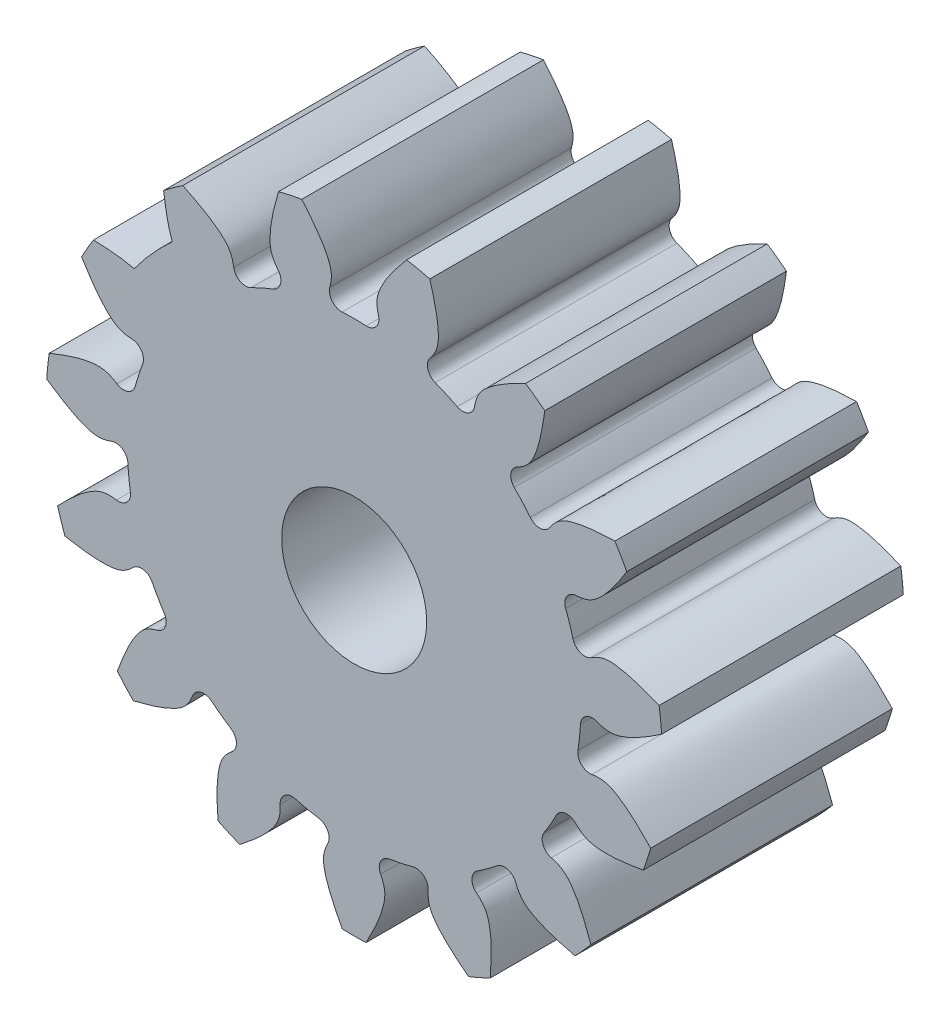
ISO-10303-21;
HEADER;
FILE_DESCRIPTION(('STEP AP214'),'2;1');
FILE_NAME('part.step','',(''),(''),'','','');
FILE_SCHEMA(('AUTOMOTIVE_DESIGN { 1 0 10303 214 1 1 1 1 }'));
ENDSEC;
DATA;
#1=APPLICATION_CONTEXT('core data for automotive mechanical design processes');
#2=APPLICATION_PROTOCOL_DEFINITION('international standard','automotive_design',2000,#1);
#3=PRODUCT_CONTEXT('',#1,'mechanical');
#4=PRODUCT('Part','Part','',(#3));
#5=PRODUCT_RELATED_PRODUCT_CATEGORY('part','',(#4));
#6=PRODUCT_DEFINITION_FORMATION('','',#4);
#7=PRODUCT_DEFINITION_CONTEXT('part definition',#1,'design');
#8=PRODUCT_DEFINITION('design','',#6,#7);
#9=PRODUCT_DEFINITION_SHAPE('','',#8);
#10=(LENGTH_UNIT() NAMED_UNIT(*) SI_UNIT(.MILLI.,.METRE.));
#11=(NAMED_UNIT(*) PLANE_ANGLE_UNIT() SI_UNIT($,.RADIAN.));
#12=(NAMED_UNIT(*) SI_UNIT($,.STERADIAN.) SOLID_ANGLE_UNIT());
#13=UNCERTAINTY_MEASURE_WITH_UNIT(LENGTH_MEASURE(1.E-05),#10,'distance_accuracy_value','');
#14=(GEOMETRIC_REPRESENTATION_CONTEXT(3) GLOBAL_UNCERTAINTY_ASSIGNED_CONTEXT((#13)) GLOBAL_UNIT_ASSIGNED_CONTEXT((#10,
#11,#12)) REPRESENTATION_CONTEXT('',''));
#15=CARTESIAN_POINT('',(0.,0.,0.));
#16=DIRECTION('',(0.,0.,1.));
#17=DIRECTION('',(1.,0.,0.));
#18=AXIS2_PLACEMENT_3D('',#15,#16,#17);
#19=CARTESIAN_POINT('',(0.,0.,10.));
#20=DIRECTION('',(0.,0.,1.));
#21=DIRECTION('',(1.,0.,0.));
#22=AXIS2_PLACEMENT_3D('',#19,#20,#21);
#23=PLANE('',#22);
#24=CARTESIAN_POINT('',(9.79710830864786,-8.15960592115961,10.));
#25=CARTESIAN_POINT('',(9.60172635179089,-7.62956983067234,10.));
#26=CARTESIAN_POINT('',(9.32597077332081,-6.88149456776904,10.));
#27=CARTESIAN_POINT('',(8.68742109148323,-6.02714700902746,10.));
#28=CARTESIAN_POINT('',(7.94425061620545,-5.7856096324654,10.));
#29=CARTESIAN_POINT('',(7.43026942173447,-5.77313403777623,10.));
#30=CARTESIAN_POINT('',(7.14828565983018,-5.76628959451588,10.));
#31=B_SPLINE_CURVE_WITH_KNOTS('',3,(#24,#25,#26,#27,#28,#29,#30),.UNSPECIFIED.,.F.,.F.,(4,1,1,1,
4),(0.,0.430527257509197,0.607631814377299,0.784736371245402,1.),.UNSPECIFIED.);
#32=CARTESIAN_POINT('',(9.79710830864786,-8.15960592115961,10.));
#33=VERTEX_POINT('',#32);
#34=CARTESIAN_POINT('',(8.1520306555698,-5.86845634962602,10.));
#35=VERTEX_POINT('',#34);
#36=EDGE_CURVE('E1539',#33,#35,#31,.T.);
#37=ORIENTED_EDGE('',*,*,#36,.T.);
#38=CARTESIAN_POINT('',(8.27782373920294,-5.3845388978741,10.));
#39=DIRECTION('',(0.,0.,1.));
#40=DIRECTION('',(1.,0.,0.));
#41=AXIS2_PLACEMENT_3D('',#38,#39,#40);
#42=CIRCLE('',#41,0.5);
#43=CARTESIAN_POINT('',(7.85869342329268,-5.11190401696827,10.));
#44=VERTEX_POINT('',#43);
#45=EDGE_CURVE('E1089',#35,#44,#42,.F.);
#46=ORIENTED_EDGE('',*,*,#45,.T.);
#47=CARTESIAN_POINT('',(0.,0.,10.));
#48=DIRECTION('',(0.,0.,1.));
#49=DIRECTION('',(1.,0.,0.));
#50=AXIS2_PLACEMENT_3D('',#47,#48,#49);
#51=CIRCLE('',#50,9.375);
#52=CARTESIAN_POINT('',(8.35621753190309,-4.25020629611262,10.));
#53=VERTEX_POINT('',#52);
#54=EDGE_CURVE('E1838',#44,#53,#51,.T.);
#55=ORIENTED_EDGE('',*,*,#54,.T.);
#56=CARTESIAN_POINT('',(8.80188246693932,-4.47688396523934,10.));
#57=DIRECTION('',(0.,0.,1.));
#58=DIRECTION('',(1.,0.,0.));
#59=AXIS2_PLACEMENT_3D('',#56,#57,#58);
#60=CIRCLE('',#59,0.5);
#61=CARTESIAN_POINT('',(9.15808459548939,-4.12599930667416,10.));
#62=VERTEX_POINT('',#61);
#63=EDGE_CURVE('E1105',#53,#62,#60,.F.);
#64=ORIENTED_EDGE('',*,*,#63,.T.);
#65=CARTESIAN_POINT('',(8.56776541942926,-3.30779069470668,10.));
#66=CARTESIAN_POINT('',(8.71467524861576,-3.54857937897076,10.));
#67=CARTESIAN_POINT('',(8.98245268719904,-3.98747293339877,10.));
#68=CARTESIAN_POINT('',(9.56319477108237,-4.51033170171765,10.));
#69=CARTESIAN_POINT('',(10.6223513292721,-4.63620001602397,10.));
#70=CARTESIAN_POINT('',(11.4080866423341,-4.50100476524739,10.));
#71=CARTESIAN_POINT('',(11.9648061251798,-4.40521445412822,10.));
#72=B_SPLINE_CURVE_WITH_KNOTS('',3,(#65,#66,#67,#68,#69,#70,#71),.UNSPECIFIED.,.F.,.F.,(4,1,1,1,
4),(0.,0.215263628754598,0.392368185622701,0.569472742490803,1.),.UNSPECIFIED.);
#73=CARTESIAN_POINT('',(11.9648061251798,-4.40521445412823,10.));
#74=VERTEX_POINT('',#73);
#75=EDGE_CURVE('E1642',#62,#74,#72,.T.);
#76=ORIENTED_EDGE('',*,*,#75,.T.);
#77=CARTESIAN_POINT('',(0.,0.,10.));
#78=DIRECTION('',(0.,0.,1.));
#79=DIRECTION('',(-0.913545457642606,0.406736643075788,0.));
#80=AXIS2_PLACEMENT_3D('',#77,#78,#79);
#81=CIRCLE('',#80,12.75);
#82=CARTESIAN_POINT('',(12.2689145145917,-3.46932798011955,10.));
#83=VERTEX_POINT('',#82);
#84=EDGE_CURVE('E1609',#74,#83,#81,.T.);
#85=ORIENTED_EDGE('',*,*,#84,.T.);
#86=CARTESIAN_POINT('',(12.2689145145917,-3.46932798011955,10.));
#87=CARTESIAN_POINT('',(11.8748391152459,-3.06458491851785,10.));
#88=CARTESIAN_POINT('',(11.3186542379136,-2.49334405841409,10.));
#89=CARTESIAN_POINT('',(10.3878156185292,-1.97258028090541,10.));
#90=CARTESIAN_POINT('',(9.61065350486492,-2.05419957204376,10.));
#91=CARTESIAN_POINT('',(9.13603403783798,-2.25185753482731,10.));
#92=CARTESIAN_POINT('',(8.87564516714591,-2.36029795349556,10.));
#93=B_SPLINE_CURVE_WITH_KNOTS('',3,(#86,#87,#88,#89,#90,#91,#92),.UNSPECIFIED.,.F.,.F.,(4,1,1,1,
4),(0.,0.430527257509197,0.607631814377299,0.784736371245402,1.),.UNSPECIFIED.);
#94=CARTESIAN_POINT('',(9.83416681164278,-2.04537205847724,10.));
#95=VERTEX_POINT('',#94);
#96=EDGE_CURVE('E1604',#83,#95,#93,.T.);
#97=ORIENTED_EDGE('',*,*,#96,.T.);
#98=CARTESIAN_POINT('',(9.75225755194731,-1.5521268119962,10.));
#99=DIRECTION('',(0.,0.,1.));
#100=DIRECTION('',(1.,0.,0.));
#101=AXIS2_PLACEMENT_3D('',#98,#99,#100);
#102=CIRCLE('',#101,0.5);
#103=CARTESIAN_POINT('',(9.25847235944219,-1.47353811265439,10.));
#104=VERTEX_POINT('',#103);
#105=EDGE_CURVE('E46',#95,#104,#102,.F.);
#106=ORIENTED_EDGE('',*,*,#105,.T.);
#107=CARTESIAN_POINT('',(9.36249921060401,-0.483976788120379,10.));
#108=VERTEX_POINT('',#107);
#109=EDGE_CURVE('E1705',#104,#108,#51,.T.);
#110=ORIENTED_EDGE('',*,*,#109,.T.);
#111=CARTESIAN_POINT('',(9.86183250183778,-0.50978888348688,10.));
#112=DIRECTION('',(0.,0.,1.));
#113=DIRECTION('',(1.,0.,0.));
#114=AXIS2_PLACEMENT_3D('',#111,#112,#113);
#115=CIRCLE('',#114,0.5);
#116=CARTESIAN_POINT('',(10.0445216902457,-0.0443593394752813,10.));
#117=VERTEX_POINT('',#116);
#118=EDGE_CURVE('E1727',#108,#117,#115,.F.);
#119=ORIENTED_EDGE('',*,*,#118,.T.);
#120=CARTESIAN_POINT('',(9.17244286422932,0.463006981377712,10.));
#121=CARTESIAN_POINT('',(9.40458925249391,0.302789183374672,10.));
#122=CARTESIAN_POINT('',(9.82773020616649,0.0107548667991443,10.));
#123=CARTESIAN_POINT('',(10.5709303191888,-0.230691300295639,10.));
#124=CARTESIAN_POINT('',(11.5897132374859,0.0851200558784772,10.));
#125=CARTESIAN_POINT('',(12.2525293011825,0.528214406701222,10.));
#126=CARTESIAN_POINT('',(12.7221564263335,0.84216142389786,10.));
#127=B_SPLINE_CURVE_WITH_KNOTS('',3,(#120,#121,#122,#123,#124,#125,#126),.UNSPECIFIED.,.F.,.F.,
(4,1,1,1,4),(0.,0.215263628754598,0.392368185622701,0.569472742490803,1.),.UNSPECIFIED.);
#128=CARTESIAN_POINT('',(12.7221564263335,0.842161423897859,10.));
#129=VERTEX_POINT('',#128);
#130=EDGE_CURVE('E712',#117,#129,#127,.T.);
#131=ORIENTED_EDGE('',*,*,#130,.T.);
#132=CARTESIAN_POINT('',(0.,0.,10.));
#133=DIRECTION('',(0.,0.,1.));
#134=DIRECTION('',(-1.,0.,0.));
#135=AXIS2_PLACEMENT_3D('',#132,#133,#134);
#136=CIRCLE('',#135,12.75);
#137=CARTESIAN_POINT('',(12.6193139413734,1.82082828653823,10.));
#138=VERTEX_POINT('',#137);
#139=EDGE_CURVE('E718',#129,#138,#136,.T.);
#140=ORIENTED_EDGE('',*,*,#139,.T.);
#141=CARTESIAN_POINT('',(12.6193139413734,1.82082828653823,10.));
#142=CARTESIAN_POINT('',(12.0946843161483,2.03029456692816,10.));
#143=CARTESIAN_POINT('',(11.3542395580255,2.32592828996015,10.));
#144=CARTESIAN_POINT('',(10.2920624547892,2.4230634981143,10.));
#145=CARTESIAN_POINT('',(9.61528709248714,2.03240025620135,10.));
#146=CARTESIAN_POINT('',(9.26209537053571,1.65878559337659,10.));
#147=CARTESIAN_POINT('',(9.06832499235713,1.45381064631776,10.));
#148=B_SPLINE_CURVE_WITH_KNOTS('',3,(#141,#142,#143,#144,#145,#146,#147),.UNSPECIFIED.,.F.,.F.,
(4,1,1,1,4),(0.,0.430527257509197,0.607631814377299,0.784736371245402,1.),.UNSPECIFIED.);
#149=CARTESIAN_POINT('',(9.81588618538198,2.13137564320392,10.));
#150=VERTEX_POINT('',#149);
#151=EDGE_CURVE('E727',#138,#150,#148,.T.);
#152=ORIENTED_EDGE('',*,*,#151,.T.);
#153=CARTESIAN_POINT('',(9.54043743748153,2.54866210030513,10.));
#154=DIRECTION('',(0.,0.,1.));
#155=DIRECTION('',(1.,0.,0.));
#156=AXIS2_PLACEMENT_3D('',#153,#154,#155);
#157=CIRCLE('',#156,0.5);
#158=CARTESIAN_POINT('',(9.05737731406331,2.41961591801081,10.));
#159=VERTEX_POINT('',#158);
#160=EDGE_CURVE('E1729',#150,#159,#157,.F.);
#161=ORIENTED_EDGE('',*,*,#160,.T.);
#162=CARTESIAN_POINT('',(8.74991972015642,3.36593670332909,10.));
#163=VERTEX_POINT('',#162);
#164=EDGE_CURVE('E1709',#159,#163,#51,.T.);
#165=ORIENTED_EDGE('',*,*,#164,.T.);
#166=CARTESIAN_POINT('',(9.21658210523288,3.5454533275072,10.));
#167=DIRECTION('',(0.,0.,1.));
#168=DIRECTION('',(1.,0.,0.));
#169=AXIS2_PLACEMENT_3D('',#166,#167,#168);
#170=CIRCLE('',#169,0.5);
#171=CARTESIAN_POINT('',(9.1941697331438,4.04495076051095,10.));
#172=VERTEX_POINT('',#171);
#173=EDGE_CURVE('E1745',#163,#172,#170,.F.);
#174=ORIENTED_EDGE('',*,*,#173,.T.);
#175=CARTESIAN_POINT('',(8.19112160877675,4.15374654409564,10.));
#176=CARTESIAN_POINT('',(8.46836433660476,4.10180274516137,10.));
#177=CARTESIAN_POINT('',(8.97370389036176,4.00712305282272,10.));
#178=CARTESIAN_POINT('',(9.75085598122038,4.0888377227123,10.));
#179=CARTESIAN_POINT('',(10.5531084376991,4.79172209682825,10.));
#180=CARTESIAN_POINT('',(10.9783983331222,5.46610050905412,10.));
#181=CARTESIAN_POINT('',(11.2797303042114,5.94391994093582,10.));
#182=B_SPLINE_CURVE_WITH_KNOTS('',3,(#175,#176,#177,#178,#179,#180,#181),.UNSPECIFIED.,.F.,.F.,
(4,1,1,1,4),(0.,0.215263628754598,0.392368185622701,0.569472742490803,1.),.UNSPECIFIED.);
#183=CARTESIAN_POINT('',(11.2797303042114,5.94391994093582,10.));
#184=VERTEX_POINT('',#183);
#185=EDGE_CURVE('E757',#172,#184,#182,.T.);
#186=ORIENTED_EDGE('',*,*,#185,.T.);
#187=CARTESIAN_POINT('',(0.,0.,10.));
#188=DIRECTION('',(0.,0.,1.));
#189=DIRECTION('',(-0.913545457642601,-0.406736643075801,0.));
#190=AXIS2_PLACEMENT_3D('',#187,#188,#189);
#191=CIRCLE('',#190,12.75);
#192=CARTESIAN_POINT('',(10.7877193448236,6.79614680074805,10.));
#193=VERTEX_POINT('',#192);
#194=EDGE_CURVE('E763',#184,#193,#191,.T.);
#195=ORIENTED_EDGE('',*,*,#194,.T.);
#196=CARTESIAN_POINT('',(10.7877193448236,6.79614680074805,10.));
#197=CARTESIAN_POINT('',(10.2232487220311,6.77411767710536,10.));
#198=CARTESIAN_POINT('',(9.42657370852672,6.74302650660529,10.));
#199=CARTESIAN_POINT('',(8.41671819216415,6.39973758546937,10.));
#200=CARTESIAN_POINT('',(7.95735018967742,5.7675796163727,10.));
#201=CARTESIAN_POINT('',(7.78665627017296,5.28260962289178,10.));
#202=CARTESIAN_POINT('',(7.69300904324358,5.01654217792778,10.));
#203=B_SPLINE_CURVE_WITH_KNOTS('',3,(#196,#197,#198,#199,#200,#201,#202),.UNSPECIFIED.,.F.,.F.,
(4,1,1,1,4),(0.,0.430527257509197,0.607631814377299,0.784736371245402,1.),.UNSPECIFIED.);
#204=CARTESIAN_POINT('',(8.10034966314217,5.93958913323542,10.));
#205=VERTEX_POINT('',#204);
#206=EDGE_CURVE('E772',#193,#205,#203,.T.);
#207=ORIENTED_EDGE('',*,*,#206,.T.);
#208=CARTESIAN_POINT('',(7.67898901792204,6.20876418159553,10.));
#209=DIRECTION('',(0.,0.,1.));
#210=DIRECTION('',(1.,0.,0.));
#211=AXIS2_PLACEMENT_3D('',#208,#209,#210);
#212=CIRCLE('',#211,0.5);
#213=CARTESIAN_POINT('',(7.29017944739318,5.89439637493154,10.));
#214=VERTEX_POINT('',#213);
#215=EDGE_CURVE('E1747',#205,#214,#212,.F.);
#216=ORIENTED_EDGE('',*,*,#215,.T.);
#217=CARTESIAN_POINT('',(6.62439961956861,6.63384916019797,10.));
#218=VERTEX_POINT('',#217);
#219=EDGE_CURVE('E1713',#214,#218,#51,.T.);
#220=ORIENTED_EDGE('',*,*,#219,.T.);
#221=CARTESIAN_POINT('',(6.97770093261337,6.98765444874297,10.));
#222=DIRECTION('',(0.,0.,1.));
#223=DIRECTION('',(1.,0.,0.));
#224=AXIS2_PLACEMENT_3D('',#221,#222,#223);
#225=CIRCLE('',#224,0.5);
#226=CARTESIAN_POINT('',(6.75406230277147,7.4348521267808,10.));
#227=VERTEX_POINT('',#226);
#228=EDGE_CURVE('E1763',#218,#227,#225,.F.);
#229=ORIENTED_EDGE('',*,*,#228,.T.);
#230=CARTESIAN_POINT('',(5.79348101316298,7.12626559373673,10.));
#231=CARTESIAN_POINT('',(6.06788229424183,7.19157734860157,10.));
#232=CARTESIAN_POINT('',(6.56804264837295,7.31062325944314,10.));
#233=CARTESIAN_POINT('',(7.24477006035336,7.70136955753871,10.));
#234=CARTESIAN_POINT('',(7.69177531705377,8.66979185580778,10.));
#235=CARTESIAN_POINT('',(7.80600255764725,9.45884817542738,10.));
#236=CARTESIAN_POINT('',(7.88693633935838,10.0179207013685,10.));
#237=B_SPLINE_CURVE_WITH_KNOTS('',3,(#230,#231,#232,#233,#234,#235,#236),.UNSPECIFIED.,.F.,.F.,
(4,1,1,1,4),(0.,0.215263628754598,0.392368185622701,0.569472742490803,1.),.UNSPECIFIED.);
#238=CARTESIAN_POINT('',(7.88693633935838,10.0179207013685,10.));
#239=VERTEX_POINT('',#238);
#240=EDGE_CURVE('E794',#227,#239,#237,.T.);
#241=ORIENTED_EDGE('',*,*,#240,.T.);
#242=CARTESIAN_POINT('',(0.,0.,10.));
#243=DIRECTION('',(0.,0.,1.));
#244=DIRECTION('',(-0.669130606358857,-0.743144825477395,0.));
#245=AXIS2_PLACEMENT_3D('',#242,#243,#244);
#246=CIRCLE('',#245,12.75);
#247=CARTESIAN_POINT('',(7.09083007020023,10.5963497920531,10.));
#248=VERTEX_POINT('',#247);
#249=EDGE_CURVE('E800',#239,#248,#246,.T.);
#250=ORIENTED_EDGE('',*,*,#249,.T.);
#251=CARTESIAN_POINT('',(7.09083007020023,10.5963497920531,10.));
#252=CARTESIAN_POINT('',(6.58412054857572,10.3466342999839,10.));
#253=CARTESIAN_POINT('',(5.86896762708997,9.99419418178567,10.));
#254=CARTESIAN_POINT('',(5.08604689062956,9.26983890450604,10.));
#255=CARTESIAN_POINT('',(4.92351514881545,8.50549206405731,10.));
#256=CARTESIAN_POINT('',(4.96483356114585,7.99302245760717,10.));
#257=CARTESIAN_POINT('',(4.98750194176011,7.71186799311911,10.));
#258=B_SPLINE_CURVE_WITH_KNOTS('',3,(#251,#252,#253,#254,#255,#256,#257),.UNSPECIFIED.,.F.,.F.,
(4,1,1,1,4),(0.,0.430527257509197,0.607631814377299,0.784736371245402,1.),.UNSPECIFIED.);
#259=CARTESIAN_POINT('',(4.98418909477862,8.7207937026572,10.));
#260=VERTEX_POINT('',#259);
#261=EDGE_CURVE('E809',#248,#260,#258,.T.);
#262=ORIENTED_EDGE('',*,*,#261,.T.);
#263=CARTESIAN_POINT('',(4.48977363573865,8.79531453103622,10.));
#264=DIRECTION('',(0.,0.,1.));
#265=DIRECTION('',(1.,0.,0.));
#266=AXIS2_PLACEMENT_3D('',#263,#264,#265);
#267=CIRCLE('',#266,0.5);
#268=CARTESIAN_POINT('',(4.26244332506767,8.34998214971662,10.));
#269=VERTEX_POINT('',#268);
#270=EDGE_CURVE('E1765',#260,#269,#267,.F.);
#271=ORIENTED_EDGE('',*,*,#270,.T.);
#272=CARTESIAN_POINT('',(3.35346064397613,8.75470883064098,10.));
#273=VERTEX_POINT('',#272);
#274=EDGE_CURVE('E1802',#269,#273,#51,.T.);
#275=ORIENTED_EDGE('',*,*,#274,.T.);
#276=CARTESIAN_POINT('',(3.53231187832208,9.22162663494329,10.));
#277=DIRECTION('',(0.,0.,1.));
#278=DIRECTION('',(1.,0.,0.));
#279=AXIS2_PLACEMENT_3D('',#276,#277,#278);
#280=CIRCLE('',#279,0.5);
#281=CARTESIAN_POINT('',(3.14611614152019,9.53920001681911,10.));
#282=VERTEX_POINT('',#281);
#283=EDGE_CURVE('E927',#273,#282,#280,.F.);
#284=ORIENTED_EDGE('',*,*,#283,.T.);
#285=CARTESIAN_POINT('',(2.39409491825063,8.86658858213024,10.));
#286=CARTESIAN_POINT('',(2.61820827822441,9.03786289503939,10.));
#287=CARTESIAN_POINT('',(3.02670716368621,9.35005028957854,10.));
#288=CARTESIAN_POINT('',(3.48599757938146,9.98226463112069,10.));
#289=CARTESIAN_POINT('',(3.50046436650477,11.0487758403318,10.));
#290=CARTESIAN_POINT('',(3.28387802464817,11.8160750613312,10.));
#291=CARTESIAN_POINT('',(3.130419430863,12.3597319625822,10.));
#292=B_SPLINE_CURVE_WITH_KNOTS('',3,(#285,#286,#287,#288,#289,#290,#291),.UNSPECIFIED.,.F.,.F.,
(4,1,1,1,4),(0.,0.215263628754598,0.392368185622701,0.569472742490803,1.),.UNSPECIFIED.);
#293=CARTESIAN_POINT('',(3.130419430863,12.3597319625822,10.));
#294=VERTEX_POINT('',#293);
#295=EDGE_CURVE('E831',#282,#294,#292,.T.);
#296=ORIENTED_EDGE('',*,*,#295,.T.);
#297=CARTESIAN_POINT('',(0.,0.,10.));
#298=DIRECTION('',(0.,0.,1.));
#299=DIRECTION('',(-0.309016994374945,-0.951056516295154,0.));
#300=AXIS2_PLACEMENT_3D('',#297,#298,#299);
#301=CIRCLE('',#300,12.75);
#302=CARTESIAN_POINT('',(2.16787185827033,12.5643476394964,10.));
#303=VERTEX_POINT('',#302);
#304=EDGE_CURVE('E837',#294,#303,#301,.T.);
#305=ORIENTED_EDGE('',*,*,#304,.T.);
#306=CARTESIAN_POINT('',(2.16787185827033,12.5643476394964,10.));
#307=CARTESIAN_POINT('',(1.80653811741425,12.1301238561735,10.));
#308=CARTESIAN_POINT('',(1.2965637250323,11.5172748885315,10.));
#309=CARTESIAN_POINT('',(0.875951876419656,10.5371008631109,10.));
#310=CARTESIAN_POINT('',(1.03835960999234,9.77272766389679,10.));
#311=CARTESIAN_POINT('',(1.2845460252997,9.32136909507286,10.));
#312=CARTESIAN_POINT('',(1.41961044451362,9.07374177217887,10.));
#313=B_SPLINE_CURVE_WITH_KNOTS('',3,(#306,#307,#308,#309,#310,#311,#312),.UNSPECIFIED.,.F.,.F.,
(4,1,1,1,4),(0.,0.430527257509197,0.607631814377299,0.784736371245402,1.),.UNSPECIFIED.);
#314=CARTESIAN_POINT('',(1.00621695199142,9.99409381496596,10.));
#315=VERTEX_POINT('',#314);
#316=EDGE_CURVE('E846',#303,#315,#313,.T.);
#317=ORIENTED_EDGE('',*,*,#316,.T.);
#318=CARTESIAN_POINT('',(0.524235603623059,9.86107509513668,10.));
#319=DIRECTION('',(0.,0.,1.));
#320=DIRECTION('',(1.,0.,0.));
#321=AXIS2_PLACEMENT_3D('',#318,#319,#320);
#322=CIRCLE('',#321,0.5);
#323=CARTESIAN_POINT('',(0.49769202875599,9.36178015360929,10.));
#324=VERTEX_POINT('',#323);
#325=EDGE_CURVE('E916',#315,#324,#322,.F.);
#326=ORIENTED_EDGE('',*,*,#325,.T.);
#327=CARTESIAN_POINT('',(-0.497322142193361,9.3617998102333,10.));
#328=VERTEX_POINT('',#327);
#329=EDGE_CURVE('E1806',#324,#328,#51,.T.);
#330=ORIENTED_EDGE('',*,*,#329,.T.);
#331=CARTESIAN_POINT('',(-0.52384598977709,9.86109580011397,10.));
#332=DIRECTION('',(0.,0.,1.));
#333=DIRECTION('',(1.,0.,0.));
#334=AXIS2_PLACEMENT_3D('',#331,#332,#333);
#335=CIRCLE('',#334,0.5);
#336=CARTESIAN_POINT('',(-1.0058220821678,9.99413356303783,10.));
#337=VERTEX_POINT('',#336);
#338=EDGE_CURVE('E943',#328,#337,#335,.F.);
#339=ORIENTED_EDGE('',*,*,#338,.T.);
#340=CARTESIAN_POINT('',(-1.41925193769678,9.07379785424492,10.));
#341=CARTESIAN_POINT('',(-1.2841777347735,9.32141984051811,10.));
#342=CARTESIAN_POINT('',(-1.03797348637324,9.77276868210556,10.));
#343=CARTESIAN_POINT('',(-0.875535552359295,10.5371354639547,10.));
#344=CARTESIAN_POINT('',(-1.29610867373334,11.517326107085,10.));
#345=CARTESIAN_POINT('',(-1.80605885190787,12.130195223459,10.));
#346=CARTESIAN_POINT('',(-2.16737543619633,12.5644332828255,10.));
#347=B_SPLINE_CURVE_WITH_KNOTS('',3,(#340,#341,#342,#343,#344,#345,#346),.UNSPECIFIED.,.F.,.F.,
(4,1,1,1,4),(0.,0.215263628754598,0.392368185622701,0.569472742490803,1.),.UNSPECIFIED.);
#348=CARTESIAN_POINT('',(-2.16737543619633,12.5644332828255,10.));
#349=VERTEX_POINT('',#348);
#350=EDGE_CURVE('E864',#337,#349,#347,.T.);
#351=ORIENTED_EDGE('',*,*,#350,.T.);
#352=CARTESIAN_POINT('',(0.,0.,10.));
#353=DIRECTION('',(0.,0.,1.));
#354=DIRECTION('',(0.104528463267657,-0.994521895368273,0.));
#355=AXIS2_PLACEMENT_3D('',#352,#353,#354);
#356=CIRCLE('',#355,12.75);
#357=CARTESIAN_POINT('',(-3.12993109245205,12.3598556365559,10.));
#358=VERTEX_POINT('',#357);
#359=EDGE_CURVE('E870',#349,#358,#356,.T.);
#360=ORIENTED_EDGE('',*,*,#359,.T.);
#361=CARTESIAN_POINT('',(-3.12993109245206,12.3598556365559,10.));
#362=CARTESIAN_POINT('',(-3.28341116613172,11.816204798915,10.));
#363=CARTESIAN_POINT('',(-3.50002782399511,11.0489141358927,10.));
#364=CARTESIAN_POINT('',(-3.48560317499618,9.9824023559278,10.));
#365=CARTESIAN_POINT('',(-3.02633773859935,9.35016986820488,10.));
#366=CARTESIAN_POINT('',(-2.61785118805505,9.03796633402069,10.));
#367=CARTESIAN_POINT('',(-2.39374459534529,8.86668316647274,10.));
#368=B_SPLINE_CURVE_WITH_KNOTS('',3,(#361,#362,#363,#364,#365,#366,#367),.UNSPECIFIED.,.F.,.F.,
(4,1,1,1,4),(0.,0.430527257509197,0.607631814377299,0.784736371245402,1.),.UNSPECIFIED.);
#369=CARTESIAN_POINT('',(-3.14573924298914,9.53932431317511,10.));
#370=VERTEX_POINT('',#369);
#371=EDGE_CURVE('E878',#358,#370,#368,.T.);
#372=ORIENTED_EDGE('',*,*,#371,.T.);
#373=CARTESIAN_POINT('',(-3.5319475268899,9.22176619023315,10.));
#374=DIRECTION('',(0.,0.,1.));
#375=DIRECTION('',(1.,0.,0.));
#376=AXIS2_PLACEMENT_3D('',#373,#374,#375);
#377=CIRCLE('',#376,0.5);
#378=CARTESIAN_POINT('',(-3.35311474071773,8.75484131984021,10.));
#379=VERTEX_POINT('',#378);
#380=EDGE_CURVE('E945',#370,#379,#377,.F.);
#381=ORIENTED_EDGE('',*,*,#380,.T.);
#382=CARTESIAN_POINT('',(-4.2621134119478,8.35015055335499,10.));
#383=VERTEX_POINT('',#382);
#384=EDGE_CURVE('E1809',#379,#383,#51,.T.);
#385=ORIENTED_EDGE('',*,*,#384,.T.);
#386=CARTESIAN_POINT('',(-4.48942612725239,8.79549191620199,10.));
#387=DIRECTION('',(0.,0.,1.));
#388=DIRECTION('',(1.,0.,0.));
#389=AXIS2_PLACEMENT_3D('',#386,#387,#388);
#390=CIRCLE('',#389,0.5);
#391=CARTESIAN_POINT('',(-4.98384453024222,8.72099062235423,10.));
#392=VERTEX_POINT('',#391);
#393=EDGE_CURVE('E956',#383,#392,#390,.F.);
#394=ORIENTED_EDGE('',*,*,#393,.T.);
#395=CARTESIAN_POINT('',(-4.98719724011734,7.71206504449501,10.));
#396=CARTESIAN_POINT('',(-4.9645177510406,7.99321861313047,10.));
#397=CARTESIAN_POINT('',(-4.92317909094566,8.50568658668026,10.));
#398=CARTESIAN_POINT('',(-5.08568063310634,9.27003984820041,10.));
#399=CARTESIAN_POINT('',(-5.86857274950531,9.99442605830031,10.));
#400=CARTESIAN_POINT('',(-6.58371174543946,10.3468944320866,10.));
#401=CARTESIAN_POINT('',(-7.09041140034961,10.5966299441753,10.));
#402=B_SPLINE_CURVE_WITH_KNOTS('',3,(#395,#396,#397,#398,#399,#400,#401),.UNSPECIFIED.,.F.,.F.,
(4,1,1,1,4),(0.,0.215263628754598,0.392368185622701,0.569472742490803,1.),.UNSPECIFIED.);
#403=CARTESIAN_POINT('',(-7.09041140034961,10.5966299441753,10.));
#404=VERTEX_POINT('',#403);
#405=EDGE_CURVE('E605',#392,#404,#402,.T.);
#406=ORIENTED_EDGE('',*,*,#405,.T.);
#407=CARTESIAN_POINT('',(0.,0.,10.));
#408=DIRECTION('',(0.,0.,1.));
#409=DIRECTION('',(0.500000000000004,-0.866025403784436,0.));
#410=AXIS2_PLACEMENT_3D('',#407,#408,#409);
#411=CIRCLE('',#410,12.75);
#412=CARTESIAN_POINT('',(-7.88654052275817,10.0182323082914,10.));
#413=VERTEX_POINT('',#412);
#414=EDGE_CURVE('E599',#404,#413,#411,.T.);
#415=ORIENTED_EDGE('',*,*,#414,.T.);
#416=CARTESIAN_POINT('',(-7.88654052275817,10.0182323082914,10.));
#417=CARTESIAN_POINT('',(-7.8056288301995,9.45915658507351,10.));
#418=CARTESIAN_POINT('',(-7.69143276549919,8.67009575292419,10.));
#419=CARTESIAN_POINT('',(-7.24446577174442,7.70165579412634,10.));
#420=CARTESIAN_POINT('',(-6.56775379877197,7.31088275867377,10.));
#421=CARTESIAN_POINT('',(-6.06759814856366,7.19181708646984,10.));
#422=CARTESIAN_POINT('',(-5.79319944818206,7.12649448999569,10.));
#423=B_SPLINE_CURVE_WITH_KNOTS('',3,(#416,#417,#418,#419,#420,#421,#422),.UNSPECIFIED.,.F.,.F.,
(4,1,1,1,4),(0.,0.430527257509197,0.607631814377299,0.784736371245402,1.),.UNSPECIFIED.);
#424=CARTESIAN_POINT('',(-7.52738899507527,8.36067670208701,10.));
#425=VERTEX_POINT('',#424);
#426=EDGE_CURVE('E593',#413,#425,#423,.T.);
#427=ORIENTED_EDGE('',*,*,#426,.T.);
#428=CARTESIAN_POINT('',(0.,0.,10.));
#429=DIRECTION('',(0.,0.,1.));
#430=DIRECTION('',(1.,0.,0.));
#431=AXIS2_PLACEMENT_3D('',#428,#429,#430);
#432=CIRCLE('',#431,11.25);
#433=CARTESIAN_POINT('',(-9.10144118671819,6.61258408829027,10.));
#434=VERTEX_POINT('',#433);
#435=EDGE_CURVE('E580',#434,#425,#432,.F.);
#436=ORIENTED_EDGE('',*,*,#435,.F.);
#437=CARTESIAN_POINT('',(-7.69281083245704,5.01684612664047,10.));
#438=CARTESIAN_POINT('',(-7.7864475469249,5.28291727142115,10.));
#439=CARTESIAN_POINT('',(-7.95712230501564,5.76789400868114,10.));
#440=CARTESIAN_POINT('',(-8.41646533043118,6.4000701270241,10.));
#441=CARTESIAN_POINT('',(-9.4263072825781,6.74339894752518,10.));
#442=CARTESIAN_POINT('',(-10.222981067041,6.77452159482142,10.));
#443=CARTESIAN_POINT('',(-10.7874508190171,6.7965730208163,10.));
#444=B_SPLINE_CURVE_WITH_KNOTS('',3,(#437,#438,#439,#440,#441,#442,#443),.UNSPECIFIED.,.F.,.F.,
(4,1,1,1,4),(0.,0.215263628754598,0.392368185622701,0.569472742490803,1.),.UNSPECIFIED.);
#445=CARTESIAN_POINT('',(-10.7874508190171,6.7965730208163,10.));
#446=VERTEX_POINT('',#445);
#447=EDGE_CURVE('E1108',#434,#446,#444,.T.);
#448=ORIENTED_EDGE('',*,*,#447,.T.);
#449=CARTESIAN_POINT('',(0.,0.,10.));
#450=DIRECTION('',(0.,0.,1.));
#451=DIRECTION('',(0.809016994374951,-0.587785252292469,0.));
#452=AXIS2_PLACEMENT_3D('',#449,#450,#451);
#453=CIRCLE('',#452,12.75);
#454=CARTESIAN_POINT('',(-11.279495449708,5.94436560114,10.));
#455=VERTEX_POINT('',#454);
#456=EDGE_CURVE('E675',#446,#455,#453,.T.);
#457=ORIENTED_EDGE('',*,*,#456,.T.);
#458=CARTESIAN_POINT('',(-11.279495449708,5.94436560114,10.));
#459=CARTESIAN_POINT('',(-10.978182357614,5.46653426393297,10.));
#460=CARTESIAN_POINT('',(-10.5529191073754,4.79213904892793,10.));
#461=CARTESIAN_POINT('',(-9.75069442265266,4.08922297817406,10.));
#462=CARTESIAN_POINT('',(-8.97354556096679,4.00747760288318,10.));
#463=CARTESIAN_POINT('',(-8.46820226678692,4.10213732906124,10.));
#464=CARTESIAN_POINT('',(-8.19095748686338,4.15407017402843,10.));
#465=B_SPLINE_CURVE_WITH_KNOTS('',3,(#458,#459,#460,#461,#462,#463,#464),.UNSPECIFIED.,.F.,.F.,
(4,1,1,1,4),(0.,0.430527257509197,0.607631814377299,0.784736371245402,1.),.UNSPECIFIED.);
#466=CARTESIAN_POINT('',(-9.19400990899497,4.04531402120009,10.));
#467=VERTEX_POINT('',#466);
#468=EDGE_CURVE('E669',#455,#467,#465,.T.);
#469=ORIENTED_EDGE('',*,*,#468,.T.);
#470=CARTESIAN_POINT('',(-9.21644201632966,3.54581747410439,10.));
#471=DIRECTION('',(0.,0.,1.));
#472=DIRECTION('',(1.,0.,0.));
#473=AXIS2_PLACEMENT_3D('',#470,#471,#472);
#474=CIRCLE('',#473,0.5);
#475=CARTESIAN_POINT('',(-8.74978672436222,3.36628241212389,10.));
#476=VERTEX_POINT('',#475);
#477=EDGE_CURVE('E963',#467,#476,#474,.F.);
#478=ORIENTED_EDGE('',*,*,#477,.T.);
#479=CARTESIAN_POINT('',(-9.05728170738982,2.41997377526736,10.));
#480=VERTEX_POINT('',#479);
#481=EDGE_CURVE('E1694',#476,#480,#51,.T.);
#482=ORIENTED_EDGE('',*,*,#481,.T.);
#483=CARTESIAN_POINT('',(-9.54033673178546,2.54903904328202,10.));
#484=DIRECTION('',(0.,0.,1.));
#485=DIRECTION('',(1.,0.,0.));
#486=AXIS2_PLACEMENT_3D('',#483,#484,#485);
#487=CIRCLE('',#486,0.5);
#488=CARTESIAN_POINT('',(-9.81580196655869,2.13176346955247,10.));
#489=VERTEX_POINT('',#488);
#490=EDGE_CURVE('E979',#480,#489,#487,.F.);
#491=ORIENTED_EDGE('',*,*,#490,.T.);
#492=CARTESIAN_POINT('',(-9.0682675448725,1.45416893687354,10.));
#493=CARTESIAN_POINT('',(-9.26202982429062,1.65915153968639,10.));
#494=CARTESIAN_POINT('',(-9.61520678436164,2.03278015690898,10.));
#495=CARTESIAN_POINT('',(-10.2919667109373,2.42347013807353,10.));
#496=CARTESIAN_POINT('',(-11.3541476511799,2.32637689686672,10.));
#497=CARTESIAN_POINT('',(-12.0946040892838,2.03077242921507,10.));
#498=CARTESIAN_POINT('',(-12.6192419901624,1.82132687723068,10.));
#499=B_SPLINE_CURVE_WITH_KNOTS('',3,(#492,#493,#494,#495,#496,#497,#498),.UNSPECIFIED.,.F.,.F.,
(4,1,1,1,4),(0.,0.215263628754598,0.392368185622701,0.569472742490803,1.),.UNSPECIFIED.);
#500=CARTESIAN_POINT('',(-12.6192419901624,1.82132687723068,10.));
#501=VERTEX_POINT('',#500);
#502=EDGE_CURVE('E1183',#489,#501,#499,.T.);
#503=ORIENTED_EDGE('',*,*,#502,.T.);
#504=CARTESIAN_POINT('',(0.,0.,10.));
#505=DIRECTION('',(0.,0.,1.));
#506=DIRECTION('',(0.978147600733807,-0.207911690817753,0.));
#507=AXIS2_PLACEMENT_3D('',#504,#505,#506);
#508=CIRCLE('',#507,12.75);
#509=CARTESIAN_POINT('',(-12.7221231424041,0.842664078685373,10.));
#510=VERTEX_POINT('',#509);
#511=EDGE_CURVE('E1147',#501,#510,#508,.T.);
#512=ORIENTED_EDGE('',*,*,#511,.T.);
#513=CARTESIAN_POINT('',(-12.7221231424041,0.842664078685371,10.));
#514=CARTESIAN_POINT('',(-12.2525084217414,0.52869850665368,10.));
#515=CARTESIAN_POINT('',(-11.589709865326,0.0855779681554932,10.));
#516=CARTESIAN_POINT('',(-10.5709394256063,-0.23027364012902,10.));
#517=CARTESIAN_POINT('',(-9.8277297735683,0.0111431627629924,10.));
#518=CARTESIAN_POINT('',(-9.40457728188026,0.30316076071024,10.));
#519=CARTESIAN_POINT('',(-9.17242456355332,0.463369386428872,10.));
#520=B_SPLINE_CURVE_WITH_KNOTS('',3,(#513,#514,#515,#516,#517,#518,#519),.UNSPECIFIED.,.F.,.F.,
(4,1,1,1,4),(0.,0.430527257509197,0.607631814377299,0.784736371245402,1.),.UNSPECIFIED.);
#521=CARTESIAN_POINT('',(-10.0445234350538,-0.0439624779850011,10.));
#522=VERTEX_POINT('',#521);
#523=EDGE_CURVE('E1141',#510,#522,#520,.T.);
#524=ORIENTED_EDGE('',*,*,#523,.T.);
#525=CARTESIAN_POINT('',(-9.86185263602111,-0.50939923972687,10.));
#526=DIRECTION('',(0.,0.,1.));
#527=DIRECTION('',(1.,0.,0.));
#528=AXIS2_PLACEMENT_3D('',#525,#526,#527);
#529=CIRCLE('',#528,0.5);
#530=CARTESIAN_POINT('',(-9.36251832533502,-0.483606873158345,10.));
#531=VERTEX_POINT('',#530);
#532=EDGE_CURVE('E981',#522,#531,#529,.F.);
#533=ORIENTED_EDGE('',*,*,#532,.T.);
#534=CARTESIAN_POINT('',(-9.25853057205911,-1.47317230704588,10.));
#535=VERTEX_POINT('',#534);
#536=EDGE_CURVE('E1815',#531,#535,#51,.T.);
#537=ORIENTED_EDGE('',*,*,#536,.T.);
#538=CARTESIAN_POINT('',(-9.75231886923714,-1.55174149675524,10.));
#539=DIRECTION('',(0.,0.,1.));
#540=DIRECTION('',(1.,0.,0.));
#541=AXIS2_PLACEMENT_3D('',#538,#539,#540);
#542=CIRCLE('',#541,0.5);
#543=CARTESIAN_POINT('',(-9.83424761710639,-2.04498350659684,10.));
#544=VERTEX_POINT('',#543);
#545=EDGE_CURVE('E997',#535,#544,#542,.F.);
#546=ORIENTED_EDGE('',*,*,#545,.T.);
#547=CARTESIAN_POINT('',(-8.87573841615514,-2.35994727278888,10.));
#548=CARTESIAN_POINT('',(-9.13612300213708,-2.25149656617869,10.));
#549=CARTESIAN_POINT('',(-9.61073465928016,-2.05381985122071,10.));
#550=CARTESIAN_POINT('',(-10.3878935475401,-1.97216985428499,10.));
#551=CARTESIAN_POINT('',(-11.3187527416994,-2.4928968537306,10.));
#552=CARTESIAN_POINT('',(-11.8749601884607,-3.0641157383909,10.));
#553=CARTESIAN_POINT('',(-12.2690515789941,-3.46884322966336,10.));
#554=B_SPLINE_CURVE_WITH_KNOTS('',3,(#547,#548,#549,#550,#551,#552,#553),.UNSPECIFIED.,.F.,.F.,
(4,1,1,1,4),(0.,0.215263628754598,0.392368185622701,0.569472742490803,1.),.UNSPECIFIED.);
#555=CARTESIAN_POINT('',(-12.2690515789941,-3.46884322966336,10.));
#556=VERTEX_POINT('',#555);
#557=EDGE_CURVE('E1249',#544,#556,#554,.T.);
#558=ORIENTED_EDGE('',*,*,#557,.T.);
#559=CARTESIAN_POINT('',(0.,0.,10.));
#560=DIRECTION('',(0.,0.,1.));
#561=DIRECTION('',(0.978147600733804,0.207911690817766,0.));
#562=AXIS2_PLACEMENT_3D('',#559,#560,#561);
#563=CIRCLE('',#562,12.75);
#564=CARTESIAN_POINT('',(-11.9649801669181,-4.40474171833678,10.));
#565=VERTEX_POINT('',#564);
#566=EDGE_CURVE('E1215',#556,#565,#563,.T.);
#567=ORIENTED_EDGE('',*,*,#566,.T.);
#568=CARTESIAN_POINT('',(-11.9649801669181,-4.40474171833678,10.));
#569=CARTESIAN_POINT('',(-11.4082644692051,-4.50055402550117,10.));
#570=CARTESIAN_POINT('',(-10.622534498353,-4.63578032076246,10.));
#571=CARTESIAN_POINT('',(-9.56337296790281,-4.50995385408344,10.));
#572=CARTESIAN_POINT('',(-8.98261022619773,-3.98711803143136,10.));
#573=CARTESIAN_POINT('',(-8.7148154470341,-3.5482350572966,10.));
#574=CARTESIAN_POINT('',(-8.56789610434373,-3.30745217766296,10.));
#575=B_SPLINE_CURVE_WITH_KNOTS('',3,(#568,#569,#570,#571,#572,#573,#574),.UNSPECIFIED.,.F.,.F.,
(4,1,1,1,4),(0.,0.430527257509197,0.607631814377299,0.784736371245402,1.),.UNSPECIFIED.);
#576=CARTESIAN_POINT('',(-9.15824760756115,-4.12563746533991,10.));
#577=VERTEX_POINT('',#576);
#578=EDGE_CURVE('E1209',#565,#577,#575,.T.);
#579=ORIENTED_EDGE('',*,*,#578,.T.);
#580=CARTESIAN_POINT('',(-8.80205934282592,-4.47653619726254,10.));
#581=DIRECTION('',(0.,0.,1.));
#582=DIRECTION('',(1.,0.,0.));
#583=AXIS2_PLACEMENT_3D('',#580,#581,#582);
#584=CIRCLE('',#583,0.5);
#585=CARTESIAN_POINT('',(-8.3563854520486,-4.24987613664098,10.));
#586=VERTEX_POINT('',#585);
#587=EDGE_CURVE('E999',#577,#586,#584,.F.);
#588=ORIENTED_EDGE('',*,*,#587,.T.);
#589=CARTESIAN_POINT('',(-7.85889538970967,-5.11159351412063,10.));
#590=VERTEX_POINT('',#589);
#591=EDGE_CURVE('E1818',#586,#590,#51,.T.);
#592=ORIENTED_EDGE('',*,*,#591,.T.);
#593=CARTESIAN_POINT('',(-8.27803647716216,-5.38421183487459,10.));
#594=DIRECTION('',(0.,0.,1.));
#595=DIRECTION('',(1.,0.,0.));
#596=AXIS2_PLACEMENT_3D('',#593,#594,#595);
#597=CIRCLE('',#596,0.5);
#598=CARTESIAN_POINT('',(-8.15226251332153,-5.86813425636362,10.));
#599=VERTEX_POINT('',#598);
#600=EDGE_CURVE('E1015',#590,#599,#597,.F.);
#601=ORIENTED_EDGE('',*,*,#600,.T.);
#602=CARTESIAN_POINT('',(-7.14851348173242,-5.7660071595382,10.));
#603=CARTESIAN_POINT('',(-7.4304975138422,-5.7728404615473,10.));
#604=CARTESIAN_POINT('',(-7.94447920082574,-5.78529574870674,10.));
#605=CARTESIAN_POINT('',(-8.687659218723,-6.02680376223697,10.));
#606=CARTESIAN_POINT('',(-9.32624265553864,-6.88112609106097,10.));
#607=CARTESIAN_POINT('',(-9.60202779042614,-7.62919045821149,10.));
#608=CARTESIAN_POINT('',(-9.79743068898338,-8.15921882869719,10.));
#609=B_SPLINE_CURVE_WITH_KNOTS('',3,(#602,#603,#604,#605,#606,#607,#608),.UNSPECIFIED.,.F.,.F.,
(4,1,1,1,4),(0.,0.215263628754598,0.392368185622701,0.569472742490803,1.),.UNSPECIFIED.);
#610=CARTESIAN_POINT('',(-9.79743068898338,-8.15921882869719,10.));
#611=VERTEX_POINT('',#610);
#612=EDGE_CURVE('E1315',#599,#611,#609,.T.);
#613=ORIENTED_EDGE('',*,*,#612,.T.);
#614=CARTESIAN_POINT('',(0.,0.,10.));
#615=DIRECTION('',(0.,0.,1.));
#616=DIRECTION('',(0.809016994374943,0.58778525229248,0.));
#617=AXIS2_PLACEMENT_3D('',#614,#615,#616);
#618=CIRCLE('',#617,12.75);
#619=CARTESIAN_POINT('',(-9.1389834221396,-8.89052765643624,10.));
#620=VERTEX_POINT('',#619);
#621=EDGE_CURVE('E1281',#611,#620,#618,.T.);
#622=ORIENTED_EDGE('',*,*,#621,.T.);
#623=CARTESIAN_POINT('',(-9.1389834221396,-8.89052765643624,10.));
#624=CARTESIAN_POINT('',(-8.59142794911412,-8.75161988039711,10.));
#625=CARTESIAN_POINT('',(-7.81862641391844,-8.5555700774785,10.));
#626=CARTESIAN_POINT('',(-6.90221244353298,-8.00982207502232,10.));
#627=CARTESIAN_POINT('',(-6.58431576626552,-7.29597029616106,10.));
#628=CARTESIAN_POINT('',(-6.51818284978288,-6.78610879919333,10.));
#629=CARTESIAN_POINT('',(-6.48190057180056,-6.50638521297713,10.));
#630=B_SPLINE_CURVE_WITH_KNOTS('',3,(#623,#624,#625,#626,#627,#628,#629),.UNSPECIFIED.,.F.,.F.,
(4,1,1,1,4),(0.,0.430527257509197,0.607631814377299,0.784736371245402,1.),.UNSPECIFIED.);
#631=CARTESIAN_POINT('',(-6.68842756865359,-7.49395225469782,10.));
#632=VERTEX_POINT('',#631);
#633=EDGE_CURVE('E1275',#620,#632,#630,.T.);
#634=ORIENTED_EDGE('',*,*,#633,.T.);
#635=CARTESIAN_POINT('',(-6.22031002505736,-7.66963937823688,10.));
#636=DIRECTION('',(0.,0.,1.));
#637=DIRECTION('',(1.,0.,0.));
#638=AXIS2_PLACEMENT_3D('',#635,#636,#637);
#639=CIRCLE('',#638,0.5);
#640=CARTESIAN_POINT('',(-5.9053576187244,-7.28130320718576,10.));
#641=VERTEX_POINT('',#640);
#642=EDGE_CURVE('E1017',#632,#641,#639,.F.);
#643=ORIENTED_EDGE('',*,*,#642,.T.);
#644=CARTESIAN_POINT('',(-5.10038579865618,-7.86617376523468,10.));
#645=VERTEX_POINT('',#644);
#646=EDGE_CURVE('E1822',#641,#645,#51,.T.);
#647=ORIENTED_EDGE('',*,*,#646,.T.);
#648=CARTESIAN_POINT('',(-5.37240637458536,-8.28570303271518,10.));
#649=DIRECTION('',(0.,0.,1.));
#650=DIRECTION('',(1.,0.,0.));
#651=AXIS2_PLACEMENT_3D('',#648,#649,#650);
#652=CIRCLE('',#651,0.5);
#653=CARTESIAN_POINT('',(-5.06067716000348,-8.67663128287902,10.));
#654=VERTEX_POINT('',#653);
#655=EDGE_CURVE('E1033',#645,#654,#652,.F.);
#656=ORIENTED_EDGE('',*,*,#655,.T.);
#657=CARTESIAN_POINT('',(-4.18524562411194,-8.17507202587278,10.));
#658=CARTESIAN_POINT('',(-4.44007150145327,-8.29600779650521,10.));
#659=CARTESIAN_POINT('',(-4.90455111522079,-8.51644145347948,10.));
#660=CARTESIAN_POINT('',(-5.48524968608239,-9.03934854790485,10.));
#661=CARTESIAN_POINT('',(-5.72114048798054,-10.0795461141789,10.));
#662=CARTESIAN_POINT('',(-5.66881755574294,-10.8751088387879,10.));
#663=CARTESIAN_POINT('',(-5.63174502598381,-11.4387913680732,10.));
#664=B_SPLINE_CURVE_WITH_KNOTS('',3,(#657,#658,#659,#660,#661,#662,#663),.UNSPECIFIED.,.F.,.F.,
(4,1,1,1,4),(0.,0.215263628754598,0.392368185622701,0.569472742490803,1.),.UNSPECIFIED.);
#665=CARTESIAN_POINT('',(-5.63174502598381,-11.4387913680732,10.));
#666=VERTEX_POINT('',#665);
#667=EDGE_CURVE('E1381',#654,#666,#664,.T.);
#668=ORIENTED_EDGE('',*,*,#667,.T.);
#669=CARTESIAN_POINT('',(0.,0.,10.));
#670=DIRECTION('',(0.,0.,1.));
#671=DIRECTION('',(0.499999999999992,0.866025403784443,0.));
#672=AXIS2_PLACEMENT_3D('',#669,#670,#671);
#673=CIRCLE('',#672,12.75);
#674=CARTESIAN_POINT('',(-4.73277341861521,-11.8390605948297,10.));
#675=VERTEX_POINT('',#674);
#676=EDGE_CURVE('E1347',#666,#675,#673,.T.);
#677=ORIENTED_EDGE('',*,*,#676,.T.);
#678=CARTESIAN_POINT('',(-4.73277341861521,-11.8390605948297,10.));
#679=CARTESIAN_POINT('',(-4.28905548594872,-11.4894511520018,10.));
#680=CARTESIAN_POINT('',(-3.66280679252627,-10.9960240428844,10.));
#681=CARTESIAN_POINT('',(-3.04759668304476,-10.1247192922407,10.));
#682=CARTESIAN_POINT('',(-3.04753329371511,-9.34328301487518,10.));
#683=CARTESIAN_POINT('',(-3.194497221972,-8.85060267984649,10.));
#684=CARTESIAN_POINT('',(-3.27512554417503,-8.58030513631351,10.));
#685=B_SPLINE_CURVE_WITH_KNOTS('',3,(#678,#679,#680,#681,#682,#683,#684),.UNSPECIFIED.,.F.,.F.,
(4,1,1,1,4),(0.,0.430527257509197,0.607631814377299,0.784736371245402,1.),.UNSPECIFIED.);
#686=CARTESIAN_POINT('',(-3.06211764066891,-9.56649461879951,10.));
#687=VERTEX_POINT('',#686);
#688=EDGE_CURVE('E1341',#675,#687,#685,.T.);
#689=ORIENTED_EDGE('',*,*,#688,.T.);
#690=CARTESIAN_POINT('',(-2.56301259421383,-9.5365922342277,10.));
#691=DIRECTION('',(0.,0.,1.));
#692=DIRECTION('',(1.,0.,0.));
#693=AXIS2_PLACEMENT_3D('',#690,#691,#692);
#694=CIRCLE('',#693,0.5);
#695=CARTESIAN_POINT('',(-2.433239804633,-9.05372680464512,10.));
#696=VERTEX_POINT('',#695);
#697=EDGE_CURVE('E1035',#687,#696,#694,.F.);
#698=ORIENTED_EDGE('',*,*,#697,.T.);
#699=CARTESIAN_POINT('',(-1.45997316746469,-9.26062111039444,10.));
#700=VERTEX_POINT('',#699);
#701=EDGE_CURVE('E1826',#696,#700,#51,.T.);
#702=ORIENTED_EDGE('',*,*,#701,.T.);
#703=CARTESIAN_POINT('',(-1.53783840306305,-9.75452090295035,10.));
#704=DIRECTION('',(0.,0.,1.));
#705=DIRECTION('',(1.,0.,0.));
#706=AXIS2_PLACEMENT_3D('',#703,#704,#705);
#707=CIRCLE('',#706,0.5);
#708=CARTESIAN_POINT('',(-1.09405475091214,-9.98485993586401,10.));
#709=VERTEX_POINT('',#708);
#710=EDGE_CURVE('E1051',#700,#709,#707,.F.);
#711=ORIENTED_EDGE('',*,*,#710,.T.);
#712=CARTESIAN_POINT('',(-0.498310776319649,-9.17059267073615,10.));
#713=CARTESIAN_POINT('',(-0.681916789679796,-9.38472001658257,10.));
#714=CARTESIAN_POINT('',(-1.01658158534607,-9.7750170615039,10.));
#715=CARTESIAN_POINT('',(-1.33439065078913,-10.4889078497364,10.));
#716=CARTESIAN_POINT('',(-1.12680115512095,-11.5351210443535,10.));
#717=CARTESIAN_POINT('',(-0.755417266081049,-12.2406221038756,10.));
#718=CARTESIAN_POINT('',(-0.492279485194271,-12.7404929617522,10.));
#719=B_SPLINE_CURVE_WITH_KNOTS('',3,(#712,#713,#714,#715,#716,#717,#718),.UNSPECIFIED.,.F.,.F.,
(4,1,1,1,4),(0.,0.215263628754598,0.392368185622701,0.569472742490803,1.),.UNSPECIFIED.);
#720=CARTESIAN_POINT('',(-0.492279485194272,-12.7404929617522,10.));
#721=VERTEX_POINT('',#720);
#722=EDGE_CURVE('E1447',#709,#721,#719,.T.);
#723=ORIENTED_EDGE('',*,*,#722,.T.);
#724=CARTESIAN_POINT('',(0.,0.,10.));
#725=DIRECTION('',(0.,0.,1.));
#726=DIRECTION('',(0.104528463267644,0.994521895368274,0.));
#727=AXIS2_PLACEMENT_3D('',#724,#725,#726);
#728=CIRCLE('',#727,12.75);
#729=CARTESIAN_POINT('',(0.491776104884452,-12.7405124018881,10.));
#730=VERTEX_POINT('',#729);
#731=EDGE_CURVE('E1413',#721,#730,#728,.T.);
#732=ORIENTED_EDGE('',*,*,#731,.T.);
#733=CARTESIAN_POINT('',(0.491776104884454,-12.7405124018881,10.));
#734=CARTESIAN_POINT('',(0.754933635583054,-12.2406519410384,10.));
#735=CARTESIAN_POINT('',(1.12634539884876,-11.5351655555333,10.));
#736=CARTESIAN_POINT('',(1.33397623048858,-10.4889605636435,10.));
#737=CARTESIAN_POINT('',(1.01619537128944,-9.77505721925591,10.));
#738=CARTESIAN_POINT('',(0.681545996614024,-9.38474695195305,10.));
#739=CARTESIAN_POINT('',(0.49794844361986,-9.17061235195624,10.));
#740=B_SPLINE_CURVE_WITH_KNOTS('',3,(#733,#734,#735,#736,#737,#738,#739),.UNSPECIFIED.,.F.,.F.,
(4,1,1,1,4),(0.,0.430527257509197,0.607631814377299,0.784736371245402,1.),.UNSPECIFIED.);
#741=CARTESIAN_POINT('',(1.09366024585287,-9.98490315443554,10.));
#742=VERTEX_POINT('',#741);
#743=EDGE_CURVE('E1407',#730,#742,#740,.T.);
#744=ORIENTED_EDGE('',*,*,#743,.T.);
#745=CARTESIAN_POINT('',(1.5374529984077,-9.75458165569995,10.));
#746=DIRECTION('',(0.,0.,1.));
#747=DIRECTION('',(1.,0.,0.));
#748=AXIS2_PLACEMENT_3D('',#745,#746,#747);
#749=CIRCLE('',#748,0.5);
#750=CARTESIAN_POINT('',(1.4596072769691,-9.26067878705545,10.));
#751=VERTEX_POINT('',#750);
#752=EDGE_CURVE('E1053',#742,#751,#749,.F.);
#753=ORIENTED_EDGE('',*,*,#752,.T.);
#754=CARTESIAN_POINT('',(2.43288208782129,-9.05382293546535,10.));
#755=VERTEX_POINT('',#754);
#756=EDGE_CURVE('E1830',#751,#755,#51,.T.);
#757=ORIENTED_EDGE('',*,*,#756,.T.);
#758=CARTESIAN_POINT('',(2.56263579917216,-9.53669349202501,10.));
#759=DIRECTION('',(0.,0.,1.));
#760=DIRECTION('',(1.,0.,0.));
#761=AXIS2_PLACEMENT_3D('',#758,#759,#760);
#762=CIRCLE('',#761,0.5);
#763=CARTESIAN_POINT('',(3.0617396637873,-9.56661559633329,10.));
#764=VERTEX_POINT('',#763);
#765=EDGE_CURVE('E1069',#755,#764,#762,.F.);
#766=ORIENTED_EDGE('',*,*,#765,.T.);
#767=CARTESIAN_POINT('',(3.2747865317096,-8.58043453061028,10.));
#768=CARTESIAN_POINT('',(3.19414753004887,-8.85072888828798,10.));
#769=CARTESIAN_POINT('',(3.04716413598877,-9.34340341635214,10.));
#770=CARTESIAN_POINT('',(3.04719665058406,-10.1248396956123,10.));
#771=CARTESIAN_POINT('',(3.66237233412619,-10.9961687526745,10.));
#772=CARTESIAN_POINT('',(4.28860153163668,-11.4896206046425,10.));
#773=CARTESIAN_POINT('',(4.73230565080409,-11.8392475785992,10.));
#774=B_SPLINE_CURVE_WITH_KNOTS('',3,(#767,#768,#769,#770,#771,#772,#773),.UNSPECIFIED.,.F.,.F.,
(4,1,1,1,4),(0.,0.215263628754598,0.392368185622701,0.569472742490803,1.),.UNSPECIFIED.);
#775=CARTESIAN_POINT('',(4.73230565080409,-11.8392475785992,10.));
#776=VERTEX_POINT('',#775);
#777=EDGE_CURVE('E1513',#764,#776,#774,.T.);
#778=ORIENTED_EDGE('',*,*,#777,.T.);
#779=CARTESIAN_POINT('',(0.,0.,10.));
#780=DIRECTION('',(0.,0.,1.));
#781=DIRECTION('',(-0.309016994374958,0.95105651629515,0.));
#782=AXIS2_PLACEMENT_3D('',#779,#780,#781);
#783=CIRCLE('',#782,12.75);
#784=CARTESIAN_POINT('',(5.63129307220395,-11.4390138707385,10.));
#785=VERTEX_POINT('',#784);
#786=EDGE_CURVE('E1479',#776,#785,#783,.T.);
#787=ORIENTED_EDGE('',*,*,#786,.T.);
#788=CARTESIAN_POINT('',(5.63129307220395,-11.4390138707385,10.));
#789=CARTESIAN_POINT('',(5.66838787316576,-10.8753328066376,10.));
#790=CARTESIAN_POINT('',(5.72074223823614,-10.0797721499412,10.));
#791=CARTESIAN_POINT('',(5.48489253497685,-9.03956526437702,10.));
#792=CARTESIAN_POINT('',(4.90421462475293,-8.51663522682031,10.));
#793=CARTESIAN_POINT('',(4.43974372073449,-8.29618321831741,10.));
#794=CARTESIAN_POINT('',(4.18492262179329,-8.17523737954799,10.));
#795=B_SPLINE_CURVE_WITH_KNOTS('',3,(#788,#789,#790,#791,#792,#793,#794),.UNSPECIFIED.,.F.,.F.,
(4,1,1,1,4),(0.,0.430527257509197,0.607631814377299,0.784736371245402,1.),.UNSPECIFIED.);
#796=CARTESIAN_POINT('',(5.06033434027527,-8.67683122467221,10.));
#797=VERTEX_POINT('',#796);
#798=EDGE_CURVE('E1473',#785,#797,#795,.T.);
#799=ORIENTED_EDGE('',*,*,#798,.T.);
#800=CARTESIAN_POINT('',(5.37207900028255,-8.28591529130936,10.));
#801=DIRECTION('',(0.,0.,1.));
#802=DIRECTION('',(1.,0.,0.));
#803=AXIS2_PLACEMENT_3D('',#800,#801,#802);
#804=CIRCLE('',#803,0.5);
#805=CARTESIAN_POINT('',(5.10007500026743,-7.86637527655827,10.));
#806=VERTEX_POINT('',#805);
#807=EDGE_CURVE('E1071',#797,#806,#804,.F.);
#808=ORIENTED_EDGE('',*,*,#807,.T.);
#809=CARTESIAN_POINT('',(5.90506992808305,-7.28153652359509,10.));
#810=VERTEX_POINT('',#809);
#811=EDGE_CURVE('E1834',#806,#810,#51,.T.);
#812=ORIENTED_EDGE('',*,*,#811,.T.);
#813=CARTESIAN_POINT('',(6.22000699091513,-7.66988513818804,10.));
#814=DIRECTION('',(0.,0.,1.));
#815=DIRECTION('',(1.,0.,0.));
#816=AXIS2_PLACEMENT_3D('',#813,#814,#815);
#817=CIRCLE('',#816,0.5);
#818=CARTESIAN_POINT('',(6.68813147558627,-7.49421651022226,10.));
#819=VERTEX_POINT('',#818);
#820=EDGE_CURVE('E1087',#810,#819,#817,.F.);
#821=ORIENTED_EDGE('',*,*,#820,.T.);
#822=CARTESIAN_POINT('',(6.48164349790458,-6.50664130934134,10.));
#823=CARTESIAN_POINT('',(6.51791472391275,-6.78636632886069,10.));
#824=CARTESIAN_POINT('',(6.58402749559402,-7.29623043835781,10.));
#825=CARTESIAN_POINT('',(6.90189596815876,-8.01009477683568,10.));
#826=CARTESIAN_POINT('',(7.81828837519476,-8.55587898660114,10.));
#827=CARTESIAN_POINT('',(8.59108216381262,-8.75195932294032,10.));
#828=CARTESIAN_POINT('',(9.13863214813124,-8.89088873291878,10.));
#829=B_SPLINE_CURVE_WITH_KNOTS('',3,(#822,#823,#824,#825,#826,#827,#828),.UNSPECIFIED.,.F.,.F.,
(4,1,1,1,4),(0.,0.215263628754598,0.392368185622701,0.569472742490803,1.),.UNSPECIFIED.);
#830=CARTESIAN_POINT('',(9.13863214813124,-8.89088873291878,10.));
#831=VERTEX_POINT('',#830);
#832=EDGE_CURVE('E1578',#819,#831,#829,.T.);
#833=ORIENTED_EDGE('',*,*,#832,.T.);
#834=CARTESIAN_POINT('',(0.,0.,10.));
#835=DIRECTION('',(0.,0.,1.));
#836=DIRECTION('',(-0.669130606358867,0.743144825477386,0.));
#837=AXIS2_PLACEMENT_3D('',#834,#835,#836);
#838=CIRCLE('',#837,12.75);
#839=EDGE_CURVE('E1544',#831,#33,#838,.T.);
#840=ORIENTED_EDGE('',*,*,#839,.T.);
#841=EDGE_LOOP('',(#37,#46,#55,#64,#76,#85,#97,#106,#110,#119,#131,#140,#152,#161,#165,#174,
#186,#195,#207,#216,#220,#229,#241,#250,#262,#271,#275,#284,#296,#305,#317,#326,#330,#339,#351,
#360,#372,#381,#385,#394,#406,#415,#427,#436,#448,#457,#469,#478,#482,#491,#503,#512,#524,#533,
#537,#546,#558,#567,#579,#588,#592,#601,#613,#622,#634,#643,#647,#656,#668,#677,#689,#698,#702,
#711,#723,#732,#744,#753,#757,#766,#778,#787,#799,#808,#812,#821,#833,#840));
#842=FACE_BOUND('',#841,.T.);
#843=CARTESIAN_POINT('',(0.,0.,10.));
#844=DIRECTION('',(0.,0.,1.));
#845=DIRECTION('',(1.,0.,0.));
#846=AXIS2_PLACEMENT_3D('',#843,#844,#845);
#847=CIRCLE('',#846,3.);
#848=CARTESIAN_POINT('',(3.,0.,10.));
#849=VERTEX_POINT('',#848);
#850=EDGE_CURVE('E1659',#849,#849,#847,.T.);
#851=ORIENTED_EDGE('',*,*,#850,.F.);
#852=EDGE_LOOP('',(#851));
#853=FACE_BOUND('',#852,.T.);
#854=ADVANCED_FACE('F37',(#842,#853),#23,.T.);
#855=CARTESIAN_POINT('',(0.,0.,0.));
#856=DIRECTION('',(0.,0.,1.));
#857=DIRECTION('',(1.,0.,0.));
#858=AXIS2_PLACEMENT_3D('',#855,#856,#857);
#859=PLANE('',#858);
#860=CARTESIAN_POINT('',(-7.69281083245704,5.01684612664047,0.));
#861=CARTESIAN_POINT('',(-7.7864475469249,5.28291727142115,0.));
#862=CARTESIAN_POINT('',(-7.95712230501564,5.76789400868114,0.));
#863=CARTESIAN_POINT('',(-8.41646533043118,6.4000701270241,0.));
#864=CARTESIAN_POINT('',(-9.4263072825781,6.74339894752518,0.));
#865=CARTESIAN_POINT('',(-10.222981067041,6.77452159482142,0.));
#866=CARTESIAN_POINT('',(-10.7874508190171,6.7965730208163,0.));
#867=B_SPLINE_CURVE_WITH_KNOTS('',3,(#860,#861,#862,#863,#864,#865,#866),.UNSPECIFIED.,.F.,.F.,
(4,1,1,1,4),(0.,0.215263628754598,0.392368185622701,0.569472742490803,1.),.UNSPECIFIED.);
#868=CARTESIAN_POINT('',(-9.10144118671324,6.61258408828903,0.));
#869=VERTEX_POINT('',#868);
#870=CARTESIAN_POINT('',(-10.7874508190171,6.7965730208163,0.));
#871=VERTEX_POINT('',#870);
#872=EDGE_CURVE('E1110',#869,#871,#867,.T.);
#873=ORIENTED_EDGE('',*,*,#872,.F.);
#874=CARTESIAN_POINT('',(0.,0.,0.));
#875=DIRECTION('',(0.,0.,-1.));
#876=DIRECTION('',(-1.,0.,0.));
#877=AXIS2_PLACEMENT_3D('',#874,#875,#876);
#878=CIRCLE('',#877,11.25);
#879=CARTESIAN_POINT('',(-7.52738899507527,8.36067670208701,0.));
#880=VERTEX_POINT('',#879);
#881=EDGE_CURVE('E54',#869,#880,#878,.T.);
#882=ORIENTED_EDGE('',*,*,#881,.T.);
#883=CARTESIAN_POINT('',(-7.88654052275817,10.0182323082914,0.));
#884=CARTESIAN_POINT('',(-7.8056288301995,9.45915658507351,0.));
#885=CARTESIAN_POINT('',(-7.69143276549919,8.67009575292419,0.));
#886=CARTESIAN_POINT('',(-7.24446577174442,7.70165579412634,0.));
#887=CARTESIAN_POINT('',(-6.56775379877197,7.31088275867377,0.));
#888=CARTESIAN_POINT('',(-6.06759814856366,7.19181708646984,0.));
#889=CARTESIAN_POINT('',(-5.79319944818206,7.12649448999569,0.));
#890=B_SPLINE_CURVE_WITH_KNOTS('',3,(#883,#884,#885,#886,#887,#888,#889),.UNSPECIFIED.,.F.,.F.,
(4,1,1,1,4),(0.,0.430527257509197,0.607631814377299,0.784736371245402,1.),.UNSPECIFIED.);
#891=CARTESIAN_POINT('',(-7.88654052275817,10.0182323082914,0.));
#892=VERTEX_POINT('',#891);
#893=EDGE_CURVE('E595',#892,#880,#890,.T.);
#894=ORIENTED_EDGE('',*,*,#893,.F.);
#895=CARTESIAN_POINT('',(0.,0.,0.));
#896=DIRECTION('',(0.,0.,1.));
#897=DIRECTION('',(0.500000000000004,-0.866025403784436,0.));
#898=AXIS2_PLACEMENT_3D('',#895,#896,#897);
#899=CIRCLE('',#898,12.75);
#900=CARTESIAN_POINT('',(-7.09041140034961,10.5966299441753,0.));
#901=VERTEX_POINT('',#900);
#902=EDGE_CURVE('E651',#901,#892,#899,.T.);
#903=ORIENTED_EDGE('',*,*,#902,.F.);
#904=CARTESIAN_POINT('',(-4.98719724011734,7.71206504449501,0.));
#905=CARTESIAN_POINT('',(-4.9645177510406,7.99321861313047,0.));
#906=CARTESIAN_POINT('',(-4.92317909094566,8.50568658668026,0.));
#907=CARTESIAN_POINT('',(-5.08568063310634,9.27003984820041,0.));
#908=CARTESIAN_POINT('',(-5.86857274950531,9.99442605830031,0.));
#909=CARTESIAN_POINT('',(-6.58371174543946,10.3468944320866,0.));
#910=CARTESIAN_POINT('',(-7.09041140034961,10.5966299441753,0.));
#911=B_SPLINE_CURVE_WITH_KNOTS('',3,(#904,#905,#906,#907,#908,#909,#910),.UNSPECIFIED.,.F.,.F.,
(4,1,1,1,4),(0.,0.215263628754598,0.392368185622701,0.569472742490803,1.),.UNSPECIFIED.);
#912=CARTESIAN_POINT('',(-4.98384453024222,8.72099062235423,0.));
#913=VERTEX_POINT('',#912);
#914=EDGE_CURVE('E656',#913,#901,#911,.T.);
#915=ORIENTED_EDGE('',*,*,#914,.F.);
#916=CARTESIAN_POINT('',(-4.48942612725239,8.79549191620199,0.));
#917=DIRECTION('',(0.,0.,1.));
#918=DIRECTION('',(1.,0.,0.));
#919=AXIS2_PLACEMENT_3D('',#916,#917,#918);
#920=CIRCLE('',#919,0.5);
#921=CARTESIAN_POINT('',(-4.2621134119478,8.35015055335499,0.));
#922=VERTEX_POINT('',#921);
#923=EDGE_CURVE('E954',#913,#922,#920,.T.);
#924=ORIENTED_EDGE('',*,*,#923,.T.);
#925=CARTESIAN_POINT('',(0.,0.,0.));
#926=DIRECTION('',(0.,0.,1.));
#927=DIRECTION('',(1.,0.,0.));
#928=AXIS2_PLACEMENT_3D('',#925,#926,#927);
#929=CIRCLE('',#928,9.375);
#930=CARTESIAN_POINT('',(-3.35311474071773,8.75484131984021,0.));
#931=VERTEX_POINT('',#930);
#932=EDGE_CURVE('E1695',#931,#922,#929,.T.);
#933=ORIENTED_EDGE('',*,*,#932,.F.);
#934=CARTESIAN_POINT('',(-3.5319475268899,9.22176619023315,0.));
#935=DIRECTION('',(0.,0.,1.));
#936=DIRECTION('',(1.,0.,0.));
#937=AXIS2_PLACEMENT_3D('',#934,#935,#936);
#938=CIRCLE('',#937,0.5);
#939=CARTESIAN_POINT('',(-3.14573924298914,9.53932431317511,0.));
#940=VERTEX_POINT('',#939);
#941=EDGE_CURVE('E947',#931,#940,#938,.T.);
#942=ORIENTED_EDGE('',*,*,#941,.T.);
#943=CARTESIAN_POINT('',(-3.12993109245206,12.3598556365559,0.));
#944=CARTESIAN_POINT('',(-3.28341116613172,11.816204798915,0.));
#945=CARTESIAN_POINT('',(-3.50002782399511,11.0489141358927,0.));
#946=CARTESIAN_POINT('',(-3.48560317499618,9.9824023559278,0.));
#947=CARTESIAN_POINT('',(-3.02633773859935,9.35016986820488,0.));
#948=CARTESIAN_POINT('',(-2.61785118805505,9.03796633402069,0.));
#949=CARTESIAN_POINT('',(-2.39374459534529,8.86668316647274,0.));
#950=B_SPLINE_CURVE_WITH_KNOTS('',3,(#943,#944,#945,#946,#947,#948,#949),.UNSPECIFIED.,.F.,.F.,
(4,1,1,1,4),(0.,0.430527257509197,0.607631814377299,0.784736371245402,1.),.UNSPECIFIED.);
#951=CARTESIAN_POINT('',(-3.12993109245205,12.3598556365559,0.));
#952=VERTEX_POINT('',#951);
#953=EDGE_CURVE('E871',#952,#940,#950,.T.);
#954=ORIENTED_EDGE('',*,*,#953,.F.);
#955=CARTESIAN_POINT('',(0.,0.,0.));
#956=DIRECTION('',(0.,0.,1.));
#957=DIRECTION('',(0.104528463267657,-0.994521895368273,0.));
#958=AXIS2_PLACEMENT_3D('',#955,#956,#957);
#959=CIRCLE('',#958,12.75);
#960=CARTESIAN_POINT('',(-2.16737543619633,12.5644332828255,0.));
#961=VERTEX_POINT('',#960);
#962=EDGE_CURVE('E2630',#961,#952,#959,.T.);
#963=ORIENTED_EDGE('',*,*,#962,.F.);
#964=CARTESIAN_POINT('',(-1.41925193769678,9.07379785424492,0.));
#965=CARTESIAN_POINT('',(-1.2841777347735,9.32141984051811,0.));
#966=CARTESIAN_POINT('',(-1.03797348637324,9.77276868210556,0.));
#967=CARTESIAN_POINT('',(-0.875535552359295,10.5371354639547,0.));
#968=CARTESIAN_POINT('',(-1.29610867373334,11.517326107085,0.));
#969=CARTESIAN_POINT('',(-1.80605885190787,12.130195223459,0.));
#970=CARTESIAN_POINT('',(-2.16737543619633,12.5644332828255,0.));
#971=B_SPLINE_CURVE_WITH_KNOTS('',3,(#964,#965,#966,#967,#968,#969,#970),.UNSPECIFIED.,.F.,.F.,
(4,1,1,1,4),(0.,0.215263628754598,0.392368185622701,0.569472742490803,1.),.UNSPECIFIED.);
#972=CARTESIAN_POINT('',(-1.0058220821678,9.99413356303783,0.));
#973=VERTEX_POINT('',#972);
#974=EDGE_CURVE('E2629',#973,#961,#971,.T.);
#975=ORIENTED_EDGE('',*,*,#974,.F.);
#976=CARTESIAN_POINT('',(-0.52384598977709,9.86109580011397,0.));
#977=DIRECTION('',(0.,0.,1.));
#978=DIRECTION('',(1.,0.,0.));
#979=AXIS2_PLACEMENT_3D('',#976,#977,#978);
#980=CIRCLE('',#979,0.5);
#981=CARTESIAN_POINT('',(-0.497322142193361,9.3617998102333,0.));
#982=VERTEX_POINT('',#981);
#983=EDGE_CURVE('E941',#973,#982,#980,.T.);
#984=ORIENTED_EDGE('',*,*,#983,.T.);
#985=CARTESIAN_POINT('',(0.49769202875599,9.36178015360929,0.));
#986=VERTEX_POINT('',#985);
#987=EDGE_CURVE('E1699',#986,#982,#929,.T.);
#988=ORIENTED_EDGE('',*,*,#987,.F.);
#989=CARTESIAN_POINT('',(0.524235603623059,9.86107509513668,0.));
#990=DIRECTION('',(0.,0.,1.));
#991=DIRECTION('',(1.,0.,0.));
#992=AXIS2_PLACEMENT_3D('',#989,#990,#991);
#993=CIRCLE('',#992,0.5);
#994=CARTESIAN_POINT('',(1.00621695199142,9.99409381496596,0.));
#995=VERTEX_POINT('',#994);
#996=EDGE_CURVE('E915',#986,#995,#993,.T.);
#997=ORIENTED_EDGE('',*,*,#996,.T.);
#998=CARTESIAN_POINT('',(2.16787185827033,12.5643476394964,0.));
#999=CARTESIAN_POINT('',(1.80653811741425,12.1301238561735,0.));
#1000=CARTESIAN_POINT('',(1.2965637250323,11.5172748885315,0.));
#1001=CARTESIAN_POINT('',(0.875951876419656,10.5371008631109,0.));
#1002=CARTESIAN_POINT('',(1.03835960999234,9.77272766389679,0.));
#1003=CARTESIAN_POINT('',(1.2845460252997,9.32136909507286,0.));
#1004=CARTESIAN_POINT('',(1.41961044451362,9.07374177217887,0.));
#1005=B_SPLINE_CURVE_WITH_KNOTS('',3,(#998,#999,#1000,#1001,#1002,#1003,#1004),.UNSPECIFIED.,
.F.,.F.,(4,1,1,1,4),(0.,0.430527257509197,0.607631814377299,0.784736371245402,1.),.UNSPECIFIED.);
#1006=CARTESIAN_POINT('',(2.16787185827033,12.5643476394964,0.));
#1007=VERTEX_POINT('',#1006);
#1008=EDGE_CURVE('E838',#1007,#995,#1005,.T.);
#1009=ORIENTED_EDGE('',*,*,#1008,.F.);
#1010=CARTESIAN_POINT('',(0.,0.,0.));
#1011=DIRECTION('',(0.,0.,1.));
#1012=DIRECTION('',(-0.309016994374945,-0.951056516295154,0.));
#1013=AXIS2_PLACEMENT_3D('',#1010,#1011,#1012);
#1014=CIRCLE('',#1013,12.75);
#1015=CARTESIAN_POINT('',(3.130419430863,12.3597319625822,0.));
#1016=VERTEX_POINT('',#1015);
#1017=EDGE_CURVE('E896',#1016,#1007,#1014,.T.);
#1018=ORIENTED_EDGE('',*,*,#1017,.F.);
#1019=CARTESIAN_POINT('',(2.39409491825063,8.86658858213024,0.));
#1020=CARTESIAN_POINT('',(2.61820827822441,9.03786289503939,0.));
#1021=CARTESIAN_POINT('',(3.02670716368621,9.35005028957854,0.));
#1022=CARTESIAN_POINT('',(3.48599757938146,9.98226463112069,0.));
#1023=CARTESIAN_POINT('',(3.50046436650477,11.0487758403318,0.));
#1024=CARTESIAN_POINT('',(3.28387802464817,11.8160750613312,0.));
#1025=CARTESIAN_POINT('',(3.130419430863,12.3597319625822,0.));
#1026=B_SPLINE_CURVE_WITH_KNOTS('',3,(#1019,#1020,#1021,#1022,#1023,#1024,#1025),.UNSPECIFIED.,
.F.,.F.,(4,1,1,1,4),(0.,0.215263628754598,0.392368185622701,0.569472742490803,1.),.UNSPECIFIED.);
#1027=CARTESIAN_POINT('',(3.14611614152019,9.53920001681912,0.));
#1028=VERTEX_POINT('',#1027);
#1029=EDGE_CURVE('E893',#1028,#1016,#1026,.T.);
#1030=ORIENTED_EDGE('',*,*,#1029,.F.);
#1031=CARTESIAN_POINT('',(3.53231187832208,9.22162663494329,0.));
#1032=DIRECTION('',(0.,0.,1.));
#1033=DIRECTION('',(1.,0.,0.));
#1034=AXIS2_PLACEMENT_3D('',#1031,#1032,#1033);
#1035=CIRCLE('',#1034,0.5);
#1036=CARTESIAN_POINT('',(3.35346064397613,8.75470883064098,0.));
#1037=VERTEX_POINT('',#1036);
#1038=EDGE_CURVE('E920',#1028,#1037,#1035,.T.);
#1039=ORIENTED_EDGE('',*,*,#1038,.T.);
#1040=CARTESIAN_POINT('',(4.26244332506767,8.34998214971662,0.));
#1041=VERTEX_POINT('',#1040);
#1042=EDGE_CURVE('E1900',#1041,#1037,#929,.T.);
#1043=ORIENTED_EDGE('',*,*,#1042,.F.);
#1044=CARTESIAN_POINT('',(4.48977363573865,8.79531453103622,0.));
#1045=DIRECTION('',(0.,0.,1.));
#1046=DIRECTION('',(1.,0.,0.));
#1047=AXIS2_PLACEMENT_3D('',#1044,#1045,#1046);
#1048=CIRCLE('',#1047,0.5);
#1049=CARTESIAN_POINT('',(4.98418909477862,8.7207937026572,0.));
#1050=VERTEX_POINT('',#1049);
#1051=EDGE_CURVE('E1767',#1041,#1050,#1048,.T.);
#1052=ORIENTED_EDGE('',*,*,#1051,.T.);
#1053=CARTESIAN_POINT('',(7.09083007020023,10.5963497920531,0.));
#1054=CARTESIAN_POINT('',(6.58412054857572,10.3466342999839,0.));
#1055=CARTESIAN_POINT('',(5.86896762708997,9.99419418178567,0.));
#1056=CARTESIAN_POINT('',(5.08604689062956,9.26983890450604,0.));
#1057=CARTESIAN_POINT('',(4.92351514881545,8.50549206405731,0.));
#1058=CARTESIAN_POINT('',(4.96483356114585,7.99302245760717,0.));
#1059=CARTESIAN_POINT('',(4.98750194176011,7.71186799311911,0.));
#1060=B_SPLINE_CURVE_WITH_KNOTS('',3,(#1053,#1054,#1055,#1056,#1057,#1058,#1059),.UNSPECIFIED.,
.F.,.F.,(4,1,1,1,4),(0.,0.430527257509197,0.607631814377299,0.784736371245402,1.),.UNSPECIFIED.);
#1061=CARTESIAN_POINT('',(7.09083007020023,10.5963497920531,0.));
#1062=VERTEX_POINT('',#1061);
#1063=EDGE_CURVE('E801',#1062,#1050,#1060,.T.);
#1064=ORIENTED_EDGE('',*,*,#1063,.F.);
#1065=CARTESIAN_POINT('',(0.,0.,0.));
#1066=DIRECTION('',(0.,0.,1.));
#1067=DIRECTION('',(-0.669130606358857,-0.743144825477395,0.));
#1068=AXIS2_PLACEMENT_3D('',#1065,#1066,#1067);
#1069=CIRCLE('',#1068,12.75);
#1070=CARTESIAN_POINT('',(7.88693633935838,10.0179207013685,0.));
#1071=VERTEX_POINT('',#1070);
#1072=EDGE_CURVE('E1780',#1071,#1062,#1069,.T.);
#1073=ORIENTED_EDGE('',*,*,#1072,.F.);
#1074=CARTESIAN_POINT('',(5.79348101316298,7.12626559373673,0.));
#1075=CARTESIAN_POINT('',(6.06788229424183,7.19157734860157,0.));
#1076=CARTESIAN_POINT('',(6.56804264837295,7.31062325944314,0.));
#1077=CARTESIAN_POINT('',(7.24477006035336,7.70136955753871,0.));
#1078=CARTESIAN_POINT('',(7.69177531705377,8.66979185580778,0.));
#1079=CARTESIAN_POINT('',(7.80600255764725,9.45884817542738,0.));
#1080=CARTESIAN_POINT('',(7.88693633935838,10.0179207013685,0.));
#1081=B_SPLINE_CURVE_WITH_KNOTS('',3,(#1074,#1075,#1076,#1077,#1078,#1079,#1080),.UNSPECIFIED.,
.F.,.F.,(4,1,1,1,4),(0.,0.215263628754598,0.392368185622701,0.569472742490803,1.),.UNSPECIFIED.);
#1082=CARTESIAN_POINT('',(6.75406230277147,7.4348521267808,0.));
#1083=VERTEX_POINT('',#1082);
#1084=EDGE_CURVE('E1779',#1083,#1071,#1081,.T.);
#1085=ORIENTED_EDGE('',*,*,#1084,.F.);
#1086=CARTESIAN_POINT('',(6.97770093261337,6.98765444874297,0.));
#1087=DIRECTION('',(0.,0.,1.));
#1088=DIRECTION('',(1.,0.,0.));
#1089=AXIS2_PLACEMENT_3D('',#1086,#1087,#1088);
#1090=CIRCLE('',#1089,0.5);
#1091=CARTESIAN_POINT('',(6.62439961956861,6.63384916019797,0.));
#1092=VERTEX_POINT('',#1091);
#1093=EDGE_CURVE('E1761',#1083,#1092,#1090,.T.);
#1094=ORIENTED_EDGE('',*,*,#1093,.T.);
#1095=CARTESIAN_POINT('',(7.29017944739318,5.89439637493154,0.));
#1096=VERTEX_POINT('',#1095);
#1097=EDGE_CURVE('E1706',#1096,#1092,#929,.T.);
#1098=ORIENTED_EDGE('',*,*,#1097,.F.);
#1099=CARTESIAN_POINT('',(7.67898901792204,6.20876418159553,0.));
#1100=DIRECTION('',(0.,0.,1.));
#1101=DIRECTION('',(1.,0.,0.));
#1102=AXIS2_PLACEMENT_3D('',#1099,#1100,#1101);
#1103=CIRCLE('',#1102,0.5);
#1104=CARTESIAN_POINT('',(8.10034966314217,5.93958913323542,0.));
#1105=VERTEX_POINT('',#1104);
#1106=EDGE_CURVE('E1749',#1096,#1105,#1103,.T.);
#1107=ORIENTED_EDGE('',*,*,#1106,.T.);
#1108=CARTESIAN_POINT('',(10.7877193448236,6.79614680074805,0.));
#1109=CARTESIAN_POINT('',(10.2232487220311,6.77411767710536,0.));
#1110=CARTESIAN_POINT('',(9.42657370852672,6.74302650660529,0.));
#1111=CARTESIAN_POINT('',(8.41671819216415,6.39973758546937,0.));
#1112=CARTESIAN_POINT('',(7.95735018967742,5.7675796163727,0.));
#1113=CARTESIAN_POINT('',(7.78665627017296,5.28260962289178,0.));
#1114=CARTESIAN_POINT('',(7.69300904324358,5.01654217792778,0.));
#1115=B_SPLINE_CURVE_WITH_KNOTS('',3,(#1108,#1109,#1110,#1111,#1112,#1113,#1114),.UNSPECIFIED.,
.F.,.F.,(4,1,1,1,4),(0.,0.430527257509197,0.607631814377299,0.784736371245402,1.),.UNSPECIFIED.);
#1116=CARTESIAN_POINT('',(10.7877193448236,6.79614680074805,0.));
#1117=VERTEX_POINT('',#1116);
#1118=EDGE_CURVE('E764',#1117,#1105,#1115,.T.);
#1119=ORIENTED_EDGE('',*,*,#1118,.F.);
#1120=CARTESIAN_POINT('',(0.,0.,0.));
#1121=DIRECTION('',(0.,0.,1.));
#1122=DIRECTION('',(-0.913545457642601,-0.406736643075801,0.));
#1123=AXIS2_PLACEMENT_3D('',#1120,#1121,#1122);
#1124=CIRCLE('',#1123,12.75);
#1125=CARTESIAN_POINT('',(11.2797303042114,5.94391994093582,0.));
#1126=VERTEX_POINT('',#1125);
#1127=EDGE_CURVE('E1877',#1126,#1117,#1124,.T.);
#1128=ORIENTED_EDGE('',*,*,#1127,.F.);
#1129=CARTESIAN_POINT('',(8.19112160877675,4.15374654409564,0.));
#1130=CARTESIAN_POINT('',(8.46836433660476,4.10180274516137,0.));
#1131=CARTESIAN_POINT('',(8.97370389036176,4.00712305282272,0.));
#1132=CARTESIAN_POINT('',(9.75085598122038,4.0888377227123,0.));
#1133=CARTESIAN_POINT('',(10.5531084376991,4.79172209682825,0.));
#1134=CARTESIAN_POINT('',(10.9783983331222,5.46610050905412,0.));
#1135=CARTESIAN_POINT('',(11.2797303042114,5.94391994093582,0.));
#1136=B_SPLINE_CURVE_WITH_KNOTS('',3,(#1129,#1130,#1131,#1132,#1133,#1134,#1135),.UNSPECIFIED.,
.F.,.F.,(4,1,1,1,4),(0.,0.215263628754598,0.392368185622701,0.569472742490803,1.),.UNSPECIFIED.);
#1137=CARTESIAN_POINT('',(9.1941697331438,4.04495076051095,0.));
#1138=VERTEX_POINT('',#1137);
#1139=EDGE_CURVE('E1880',#1138,#1126,#1136,.T.);
#1140=ORIENTED_EDGE('',*,*,#1139,.F.);
#1141=CARTESIAN_POINT('',(9.21658210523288,3.5454533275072,0.));
#1142=DIRECTION('',(0.,0.,1.));
#1143=DIRECTION('',(1.,0.,0.));
#1144=AXIS2_PLACEMENT_3D('',#1141,#1142,#1143);
#1145=CIRCLE('',#1144,0.5);
#1146=CARTESIAN_POINT('',(8.74991972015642,3.36593670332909,0.));
#1147=VERTEX_POINT('',#1146);
#1148=EDGE_CURVE('E1743',#1138,#1147,#1145,.T.);
#1149=ORIENTED_EDGE('',*,*,#1148,.T.);
#1150=CARTESIAN_POINT('',(9.05737731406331,2.41961591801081,0.));
#1151=VERTEX_POINT('',#1150);
#1152=EDGE_CURVE('E1702',#1151,#1147,#929,.T.);
#1153=ORIENTED_EDGE('',*,*,#1152,.F.);
#1154=CARTESIAN_POINT('',(9.54043743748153,2.54866210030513,0.));
#1155=DIRECTION('',(0.,0.,1.));
#1156=DIRECTION('',(1.,0.,0.));
#1157=AXIS2_PLACEMENT_3D('',#1154,#1155,#1156);
#1158=CIRCLE('',#1157,0.5);
#1159=CARTESIAN_POINT('',(9.81588618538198,2.13137564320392,0.));
#1160=VERTEX_POINT('',#1159);
#1161=EDGE_CURVE('E1731',#1151,#1160,#1158,.T.);
#1162=ORIENTED_EDGE('',*,*,#1161,.T.);
#1163=CARTESIAN_POINT('',(12.6193139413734,1.82082828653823,0.));
#1164=CARTESIAN_POINT('',(12.0946843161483,2.03029456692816,0.));
#1165=CARTESIAN_POINT('',(11.3542395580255,2.32592828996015,0.));
#1166=CARTESIAN_POINT('',(10.2920624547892,2.4230634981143,0.));
#1167=CARTESIAN_POINT('',(9.61528709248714,2.03240025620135,0.));
#1168=CARTESIAN_POINT('',(9.26209537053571,1.65878559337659,0.));
#1169=CARTESIAN_POINT('',(9.06832499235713,1.45381064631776,0.));
#1170=B_SPLINE_CURVE_WITH_KNOTS('',3,(#1163,#1164,#1165,#1166,#1167,#1168,#1169),.UNSPECIFIED.,
.F.,.F.,(4,1,1,1,4),(0.,0.430527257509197,0.607631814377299,0.784736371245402,1.),.UNSPECIFIED.);
#1171=CARTESIAN_POINT('',(12.6193139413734,1.82082828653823,0.));
#1172=VERTEX_POINT('',#1171);
#1173=EDGE_CURVE('E719',#1172,#1160,#1170,.T.);
#1174=ORIENTED_EDGE('',*,*,#1173,.F.);
#1175=CARTESIAN_POINT('',(0.,0.,0.));
#1176=DIRECTION('',(0.,0.,1.));
#1177=DIRECTION('',(-1.,0.,0.));
#1178=AXIS2_PLACEMENT_3D('',#1175,#1176,#1177);
#1179=CIRCLE('',#1178,12.75);
#1180=CARTESIAN_POINT('',(12.7221564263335,0.842161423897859,0.));
#1181=VERTEX_POINT('',#1180);
#1182=EDGE_CURVE('E1856',#1181,#1172,#1179,.T.);
#1183=ORIENTED_EDGE('',*,*,#1182,.F.);
#1184=CARTESIAN_POINT('',(9.17244286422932,0.463006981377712,0.));
#1185=CARTESIAN_POINT('',(9.40458925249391,0.302789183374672,0.));
#1186=CARTESIAN_POINT('',(9.82773020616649,0.0107548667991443,0.));
#1187=CARTESIAN_POINT('',(10.5709303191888,-0.230691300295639,0.));
#1188=CARTESIAN_POINT('',(11.5897132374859,0.0851200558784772,0.));
#1189=CARTESIAN_POINT('',(12.2525293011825,0.528214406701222,0.));
#1190=CARTESIAN_POINT('',(12.7221564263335,0.84216142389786,0.));
#1191=B_SPLINE_CURVE_WITH_KNOTS('',3,(#1184,#1185,#1186,#1187,#1188,#1189,#1190),.UNSPECIFIED.,
.F.,.F.,(4,1,1,1,4),(0.,0.215263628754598,0.392368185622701,0.569472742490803,1.),.UNSPECIFIED.);
#1192=CARTESIAN_POINT('',(10.0445216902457,-0.0443593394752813,0.));
#1193=VERTEX_POINT('',#1192);
#1194=EDGE_CURVE('E1853',#1193,#1181,#1191,.T.);
#1195=ORIENTED_EDGE('',*,*,#1194,.F.);
#1196=CARTESIAN_POINT('',(9.86183250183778,-0.50978888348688,0.));
#1197=DIRECTION('',(0.,0.,1.));
#1198=DIRECTION('',(1.,0.,0.));
#1199=AXIS2_PLACEMENT_3D('',#1196,#1197,#1198);
#1200=CIRCLE('',#1199,0.5);
#1201=CARTESIAN_POINT('',(9.36249921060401,-0.483976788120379,0.));
#1202=VERTEX_POINT('',#1201);
#1203=EDGE_CURVE('E1724',#1193,#1202,#1200,.T.);
#1204=ORIENTED_EDGE('',*,*,#1203,.T.);
#1205=CARTESIAN_POINT('',(9.25847235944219,-1.47353811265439,0.));
#1206=VERTEX_POINT('',#1205);
#1207=EDGE_CURVE('E1707',#1206,#1202,#929,.T.);
#1208=ORIENTED_EDGE('',*,*,#1207,.F.);
#1209=CARTESIAN_POINT('',(9.75225755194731,-1.5521268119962,0.));
#1210=DIRECTION('',(0.,0.,1.));
#1211=DIRECTION('',(1.,0.,0.));
#1212=AXIS2_PLACEMENT_3D('',#1209,#1210,#1211);
#1213=CIRCLE('',#1212,0.5);
#1214=CARTESIAN_POINT('',(9.83416681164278,-2.04537205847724,0.));
#1215=VERTEX_POINT('',#1214);
#1216=EDGE_CURVE('E11',#1206,#1215,#1213,.T.);
#1217=ORIENTED_EDGE('',*,*,#1216,.T.);
#1218=CARTESIAN_POINT('',(12.2689145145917,-3.46932798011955,0.));
#1219=CARTESIAN_POINT('',(11.8748391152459,-3.06458491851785,0.));
#1220=CARTESIAN_POINT('',(11.3186542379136,-2.49334405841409,0.));
#1221=CARTESIAN_POINT('',(10.3878156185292,-1.97258028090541,0.));
#1222=CARTESIAN_POINT('',(9.61065350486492,-2.05419957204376,0.));
#1223=CARTESIAN_POINT('',(9.13603403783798,-2.25185753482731,0.));
#1224=CARTESIAN_POINT('',(8.87564516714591,-2.36029795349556,0.));
#1225=B_SPLINE_CURVE_WITH_KNOTS('',3,(#1218,#1219,#1220,#1221,#1222,#1223,#1224),.UNSPECIFIED.,
.F.,.F.,(4,1,1,1,4),(0.,0.430527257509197,0.607631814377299,0.784736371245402,1.),.UNSPECIFIED.);
#1226=CARTESIAN_POINT('',(12.2689145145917,-3.46932798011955,0.));
#1227=VERTEX_POINT('',#1226);
#1228=EDGE_CURVE('E1635',#1227,#1215,#1225,.T.);
#1229=ORIENTED_EDGE('',*,*,#1228,.F.);
#1230=CARTESIAN_POINT('',(0.,0.,0.));
#1231=DIRECTION('',(0.,0.,1.));
#1232=DIRECTION('',(-0.913545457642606,0.406736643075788,0.));
#1233=AXIS2_PLACEMENT_3D('',#1230,#1231,#1232);
#1234=CIRCLE('',#1233,12.75);
#1235=CARTESIAN_POINT('',(11.9648061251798,-4.40521445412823,0.));
#1236=VERTEX_POINT('',#1235);
#1237=EDGE_CURVE('E1629',#1236,#1227,#1234,.T.);
#1238=ORIENTED_EDGE('',*,*,#1237,.F.);
#1239=CARTESIAN_POINT('',(8.56776541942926,-3.30779069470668,0.));
#1240=CARTESIAN_POINT('',(8.71467524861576,-3.54857937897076,0.));
#1241=CARTESIAN_POINT('',(8.98245268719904,-3.98747293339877,0.));
#1242=CARTESIAN_POINT('',(9.56319477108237,-4.51033170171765,0.));
#1243=CARTESIAN_POINT('',(10.6223513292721,-4.63620001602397,0.));
#1244=CARTESIAN_POINT('',(11.4080866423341,-4.50100476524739,0.));
#1245=CARTESIAN_POINT('',(11.9648061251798,-4.40521445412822,0.));
#1246=B_SPLINE_CURVE_WITH_KNOTS('',3,(#1239,#1240,#1241,#1242,#1243,#1244,#1245),.UNSPECIFIED.,
.F.,.F.,(4,1,1,1,4),(0.,0.215263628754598,0.392368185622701,0.569472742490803,1.),.UNSPECIFIED.);
#1247=CARTESIAN_POINT('',(9.15808459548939,-4.12599930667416,0.));
#1248=VERTEX_POINT('',#1247);
#1249=EDGE_CURVE('E1636',#1248,#1236,#1246,.T.);
#1250=ORIENTED_EDGE('',*,*,#1249,.F.);
#1251=CARTESIAN_POINT('',(8.80188246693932,-4.47688396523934,0.));
#1252=DIRECTION('',(0.,0.,1.));
#1253=DIRECTION('',(1.,0.,0.));
#1254=AXIS2_PLACEMENT_3D('',#1251,#1252,#1253);
#1255=CIRCLE('',#1254,0.5);
#1256=CARTESIAN_POINT('',(8.35621753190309,-4.25020629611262,0.));
#1257=VERTEX_POINT('',#1256);
#1258=EDGE_CURVE('E1103',#1248,#1257,#1255,.T.);
#1259=ORIENTED_EDGE('',*,*,#1258,.T.);
#1260=CARTESIAN_POINT('',(7.85869342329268,-5.11190401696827,0.));
#1261=VERTEX_POINT('',#1260);
#1262=EDGE_CURVE('E1920',#1261,#1257,#929,.T.);
#1263=ORIENTED_EDGE('',*,*,#1262,.F.);
#1264=CARTESIAN_POINT('',(8.27782373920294,-5.3845388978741,0.));
#1265=DIRECTION('',(0.,0.,1.));
#1266=DIRECTION('',(1.,0.,0.));
#1267=AXIS2_PLACEMENT_3D('',#1264,#1265,#1266);
#1268=CIRCLE('',#1267,0.5);
#1269=CARTESIAN_POINT('',(8.1520306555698,-5.86845634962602,0.));
#1270=VERTEX_POINT('',#1269);
#1271=EDGE_CURVE('E1091',#1261,#1270,#1268,.T.);
#1272=ORIENTED_EDGE('',*,*,#1271,.T.);
#1273=CARTESIAN_POINT('',(9.79710830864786,-8.15960592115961,0.));
#1274=CARTESIAN_POINT('',(9.60172635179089,-7.62956983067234,0.));
#1275=CARTESIAN_POINT('',(9.32597077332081,-6.88149456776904,0.));
#1276=CARTESIAN_POINT('',(8.68742109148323,-6.02714700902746,0.));
#1277=CARTESIAN_POINT('',(7.94425061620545,-5.7856096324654,0.));
#1278=CARTESIAN_POINT('',(7.43026942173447,-5.77313403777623,0.));
#1279=CARTESIAN_POINT('',(7.14828565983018,-5.76628959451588,0.));
#1280=B_SPLINE_CURVE_WITH_KNOTS('',3,(#1273,#1274,#1275,#1276,#1277,#1278,#1279),.UNSPECIFIED.,
.F.,.F.,(4,1,1,1,4),(0.,0.430527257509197,0.607631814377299,0.784736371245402,1.),.UNSPECIFIED.);
#1281=CARTESIAN_POINT('',(9.79710830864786,-8.15960592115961,0.));
#1282=VERTEX_POINT('',#1281);
#1283=EDGE_CURVE('E1571',#1282,#1270,#1280,.T.);
#1284=ORIENTED_EDGE('',*,*,#1283,.F.);
#1285=CARTESIAN_POINT('',(0.,0.,0.));
#1286=DIRECTION('',(0.,0.,1.));
#1287=DIRECTION('',(-0.669130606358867,0.743144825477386,0.));
#1288=AXIS2_PLACEMENT_3D('',#1285,#1286,#1287);
#1289=CIRCLE('',#1288,12.75);
#1290=CARTESIAN_POINT('',(9.13863214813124,-8.89088873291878,0.));
#1291=VERTEX_POINT('',#1290);
#1292=EDGE_CURVE('E1565',#1291,#1282,#1289,.T.);
#1293=ORIENTED_EDGE('',*,*,#1292,.F.);
#1294=CARTESIAN_POINT('',(6.48164349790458,-6.50664130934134,0.));
#1295=CARTESIAN_POINT('',(6.51791472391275,-6.78636632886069,0.));
#1296=CARTESIAN_POINT('',(6.58402749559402,-7.29623043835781,0.));
#1297=CARTESIAN_POINT('',(6.90189596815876,-8.01009477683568,0.));
#1298=CARTESIAN_POINT('',(7.81828837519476,-8.55587898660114,0.));
#1299=CARTESIAN_POINT('',(8.59108216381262,-8.75195932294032,0.));
#1300=CARTESIAN_POINT('',(9.13863214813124,-8.89088873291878,0.));
#1301=B_SPLINE_CURVE_WITH_KNOTS('',3,(#1294,#1295,#1296,#1297,#1298,#1299,#1300),.UNSPECIFIED.,
.F.,.F.,(4,1,1,1,4),(0.,0.215263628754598,0.392368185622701,0.569472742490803,1.),.UNSPECIFIED.);
#1302=CARTESIAN_POINT('',(6.68813147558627,-7.49421651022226,0.));
#1303=VERTEX_POINT('',#1302);
#1304=EDGE_CURVE('E1572',#1303,#1291,#1301,.T.);
#1305=ORIENTED_EDGE('',*,*,#1304,.F.);
#1306=CARTESIAN_POINT('',(6.22000699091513,-7.66988513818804,0.));
#1307=DIRECTION('',(0.,0.,1.));
#1308=DIRECTION('',(1.,0.,0.));
#1309=AXIS2_PLACEMENT_3D('',#1306,#1307,#1308);
#1310=CIRCLE('',#1309,0.5);
#1311=CARTESIAN_POINT('',(5.90506992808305,-7.28153652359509,0.));
#1312=VERTEX_POINT('',#1311);
#1313=EDGE_CURVE('E1085',#1303,#1312,#1310,.T.);
#1314=ORIENTED_EDGE('',*,*,#1313,.T.);
#1315=CARTESIAN_POINT('',(5.10007500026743,-7.86637527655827,0.));
#1316=VERTEX_POINT('',#1315);
#1317=EDGE_CURVE('E1922',#1316,#1312,#929,.T.);
#1318=ORIENTED_EDGE('',*,*,#1317,.F.);
#1319=CARTESIAN_POINT('',(5.37207900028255,-8.28591529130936,0.));
#1320=DIRECTION('',(0.,0.,1.));
#1321=DIRECTION('',(1.,0.,0.));
#1322=AXIS2_PLACEMENT_3D('',#1319,#1320,#1321);
#1323=CIRCLE('',#1322,0.5);
#1324=CARTESIAN_POINT('',(5.06033434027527,-8.67683122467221,0.));
#1325=VERTEX_POINT('',#1324);
#1326=EDGE_CURVE('E1073',#1316,#1325,#1323,.T.);
#1327=ORIENTED_EDGE('',*,*,#1326,.T.);
#1328=CARTESIAN_POINT('',(5.63129307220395,-11.4390138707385,0.));
#1329=CARTESIAN_POINT('',(5.66838787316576,-10.8753328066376,0.));
#1330=CARTESIAN_POINT('',(5.72074223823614,-10.0797721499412,0.));
#1331=CARTESIAN_POINT('',(5.48489253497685,-9.03956526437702,0.));
#1332=CARTESIAN_POINT('',(4.90421462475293,-8.51663522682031,0.));
#1333=CARTESIAN_POINT('',(4.43974372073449,-8.29618321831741,0.));
#1334=CARTESIAN_POINT('',(4.18492262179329,-8.17523737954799,0.));
#1335=B_SPLINE_CURVE_WITH_KNOTS('',3,(#1328,#1329,#1330,#1331,#1332,#1333,#1334),.UNSPECIFIED.,
.F.,.F.,(4,1,1,1,4),(0.,0.430527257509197,0.607631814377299,0.784736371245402,1.),.UNSPECIFIED.);
#1336=CARTESIAN_POINT('',(5.63129307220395,-11.4390138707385,0.));
#1337=VERTEX_POINT('',#1336);
#1338=EDGE_CURVE('E1506',#1337,#1325,#1335,.T.);
#1339=ORIENTED_EDGE('',*,*,#1338,.F.);
#1340=CARTESIAN_POINT('',(0.,0.,0.));
#1341=DIRECTION('',(0.,0.,1.));
#1342=DIRECTION('',(-0.309016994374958,0.95105651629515,0.));
#1343=AXIS2_PLACEMENT_3D('',#1340,#1341,#1342);
#1344=CIRCLE('',#1343,12.75);
#1345=CARTESIAN_POINT('',(4.73230565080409,-11.8392475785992,0.));
#1346=VERTEX_POINT('',#1345);
#1347=EDGE_CURVE('E1500',#1346,#1337,#1344,.T.);
#1348=ORIENTED_EDGE('',*,*,#1347,.F.);
#1349=CARTESIAN_POINT('',(3.2747865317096,-8.58043453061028,0.));
#1350=CARTESIAN_POINT('',(3.19414753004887,-8.85072888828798,0.));
#1351=CARTESIAN_POINT('',(3.04716413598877,-9.34340341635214,0.));
#1352=CARTESIAN_POINT('',(3.04719665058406,-10.1248396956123,0.));
#1353=CARTESIAN_POINT('',(3.66237233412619,-10.9961687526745,0.));
#1354=CARTESIAN_POINT('',(4.28860153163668,-11.4896206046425,0.));
#1355=CARTESIAN_POINT('',(4.73230565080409,-11.8392475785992,0.));
#1356=B_SPLINE_CURVE_WITH_KNOTS('',3,(#1349,#1350,#1351,#1352,#1353,#1354,#1355),.UNSPECIFIED.,
.F.,.F.,(4,1,1,1,4),(0.,0.215263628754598,0.392368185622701,0.569472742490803,1.),.UNSPECIFIED.);
#1357=CARTESIAN_POINT('',(3.0617396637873,-9.56661559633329,0.));
#1358=VERTEX_POINT('',#1357);
#1359=EDGE_CURVE('E1507',#1358,#1346,#1356,.T.);
#1360=ORIENTED_EDGE('',*,*,#1359,.F.);
#1361=CARTESIAN_POINT('',(2.56263579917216,-9.53669349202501,0.));
#1362=DIRECTION('',(0.,0.,1.));
#1363=DIRECTION('',(1.,0.,0.));
#1364=AXIS2_PLACEMENT_3D('',#1361,#1362,#1363);
#1365=CIRCLE('',#1364,0.5);
#1366=CARTESIAN_POINT('',(2.43288208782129,-9.05382293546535,0.));
#1367=VERTEX_POINT('',#1366);
#1368=EDGE_CURVE('E1067',#1358,#1367,#1365,.T.);
#1369=ORIENTED_EDGE('',*,*,#1368,.T.);
#1370=CARTESIAN_POINT('',(1.4596072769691,-9.26067878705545,0.));
#1371=VERTEX_POINT('',#1370);
#1372=EDGE_CURVE('E1926',#1371,#1367,#929,.T.);
#1373=ORIENTED_EDGE('',*,*,#1372,.F.);
#1374=CARTESIAN_POINT('',(1.5374529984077,-9.75458165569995,0.));
#1375=DIRECTION('',(0.,0.,1.));
#1376=DIRECTION('',(1.,0.,0.));
#1377=AXIS2_PLACEMENT_3D('',#1374,#1375,#1376);
#1378=CIRCLE('',#1377,0.5);
#1379=CARTESIAN_POINT('',(1.09366024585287,-9.98490315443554,0.));
#1380=VERTEX_POINT('',#1379);
#1381=EDGE_CURVE('E1055',#1371,#1380,#1378,.T.);
#1382=ORIENTED_EDGE('',*,*,#1381,.T.);
#1383=CARTESIAN_POINT('',(0.491776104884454,-12.7405124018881,0.));
#1384=CARTESIAN_POINT('',(0.754933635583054,-12.2406519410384,0.));
#1385=CARTESIAN_POINT('',(1.12634539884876,-11.5351655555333,0.));
#1386=CARTESIAN_POINT('',(1.33397623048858,-10.4889605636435,0.));
#1387=CARTESIAN_POINT('',(1.01619537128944,-9.77505721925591,0.));
#1388=CARTESIAN_POINT('',(0.681545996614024,-9.38474695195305,0.));
#1389=CARTESIAN_POINT('',(0.49794844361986,-9.17061235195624,0.));
#1390=B_SPLINE_CURVE_WITH_KNOTS('',3,(#1383,#1384,#1385,#1386,#1387,#1388,#1389),.UNSPECIFIED.,
.F.,.F.,(4,1,1,1,4),(0.,0.430527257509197,0.607631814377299,0.784736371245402,1.),.UNSPECIFIED.);
#1391=CARTESIAN_POINT('',(0.491776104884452,-12.7405124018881,0.));
#1392=VERTEX_POINT('',#1391);
#1393=EDGE_CURVE('E1440',#1392,#1380,#1390,.T.);
#1394=ORIENTED_EDGE('',*,*,#1393,.F.);
#1395=CARTESIAN_POINT('',(0.,0.,0.));
#1396=DIRECTION('',(0.,0.,1.));
#1397=DIRECTION('',(0.104528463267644,0.994521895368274,0.));
#1398=AXIS2_PLACEMENT_3D('',#1395,#1396,#1397);
#1399=CIRCLE('',#1398,12.75);
#1400=CARTESIAN_POINT('',(-0.492279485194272,-12.7404929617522,0.));
#1401=VERTEX_POINT('',#1400);
#1402=EDGE_CURVE('E1434',#1401,#1392,#1399,.T.);
#1403=ORIENTED_EDGE('',*,*,#1402,.F.);
#1404=CARTESIAN_POINT('',(-0.498310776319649,-9.17059267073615,0.));
#1405=CARTESIAN_POINT('',(-0.681916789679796,-9.38472001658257,0.));
#1406=CARTESIAN_POINT('',(-1.01658158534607,-9.7750170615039,0.));
#1407=CARTESIAN_POINT('',(-1.33439065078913,-10.4889078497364,0.));
#1408=CARTESIAN_POINT('',(-1.12680115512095,-11.5351210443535,0.));
#1409=CARTESIAN_POINT('',(-0.755417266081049,-12.2406221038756,0.));
#1410=CARTESIAN_POINT('',(-0.492279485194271,-12.7404929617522,0.));
#1411=B_SPLINE_CURVE_WITH_KNOTS('',3,(#1404,#1405,#1406,#1407,#1408,#1409,#1410),.UNSPECIFIED.,
.F.,.F.,(4,1,1,1,4),(0.,0.215263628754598,0.392368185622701,0.569472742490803,1.),.UNSPECIFIED.);
#1412=CARTESIAN_POINT('',(-1.09405475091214,-9.98485993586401,0.));
#1413=VERTEX_POINT('',#1412);
#1414=EDGE_CURVE('E1441',#1413,#1401,#1411,.T.);
#1415=ORIENTED_EDGE('',*,*,#1414,.F.);
#1416=CARTESIAN_POINT('',(-1.53783840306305,-9.75452090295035,0.));
#1417=DIRECTION('',(0.,0.,1.));
#1418=DIRECTION('',(1.,0.,0.));
#1419=AXIS2_PLACEMENT_3D('',#1416,#1417,#1418);
#1420=CIRCLE('',#1419,0.5);
#1421=CARTESIAN_POINT('',(-1.45997316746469,-9.26062111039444,0.));
#1422=VERTEX_POINT('',#1421);
#1423=EDGE_CURVE('E1049',#1413,#1422,#1420,.T.);
#1424=ORIENTED_EDGE('',*,*,#1423,.T.);
#1425=CARTESIAN_POINT('',(-2.433239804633,-9.05372680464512,0.));
#1426=VERTEX_POINT('',#1425);
#1427=EDGE_CURVE('E1930',#1426,#1422,#929,.T.);
#1428=ORIENTED_EDGE('',*,*,#1427,.F.);
#1429=CARTESIAN_POINT('',(-2.56301259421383,-9.5365922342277,0.));
#1430=DIRECTION('',(0.,0.,1.));
#1431=DIRECTION('',(1.,0.,0.));
#1432=AXIS2_PLACEMENT_3D('',#1429,#1430,#1431);
#1433=CIRCLE('',#1432,0.5);
#1434=CARTESIAN_POINT('',(-3.06211764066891,-9.56649461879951,0.));
#1435=VERTEX_POINT('',#1434);
#1436=EDGE_CURVE('E1037',#1426,#1435,#1433,.T.);
#1437=ORIENTED_EDGE('',*,*,#1436,.T.);
#1438=CARTESIAN_POINT('',(-4.73277341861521,-11.8390605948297,0.));
#1439=CARTESIAN_POINT('',(-4.28905548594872,-11.4894511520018,0.));
#1440=CARTESIAN_POINT('',(-3.66280679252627,-10.9960240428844,0.));
#1441=CARTESIAN_POINT('',(-3.04759668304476,-10.1247192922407,0.));
#1442=CARTESIAN_POINT('',(-3.04753329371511,-9.34328301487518,0.));
#1443=CARTESIAN_POINT('',(-3.194497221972,-8.85060267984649,0.));
#1444=CARTESIAN_POINT('',(-3.27512554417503,-8.58030513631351,0.));
#1445=B_SPLINE_CURVE_WITH_KNOTS('',3,(#1438,#1439,#1440,#1441,#1442,#1443,#1444),.UNSPECIFIED.,
.F.,.F.,(4,1,1,1,4),(0.,0.430527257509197,0.607631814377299,0.784736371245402,1.),.UNSPECIFIED.);
#1446=CARTESIAN_POINT('',(-4.73277341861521,-11.8390605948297,0.));
#1447=VERTEX_POINT('',#1446);
#1448=EDGE_CURVE('E1374',#1447,#1435,#1445,.T.);
#1449=ORIENTED_EDGE('',*,*,#1448,.F.);
#1450=CARTESIAN_POINT('',(0.,0.,0.));
#1451=DIRECTION('',(0.,0.,1.));
#1452=DIRECTION('',(0.499999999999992,0.866025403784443,0.));
#1453=AXIS2_PLACEMENT_3D('',#1450,#1451,#1452);
#1454=CIRCLE('',#1453,12.75);
#1455=CARTESIAN_POINT('',(-5.63174502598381,-11.4387913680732,0.));
#1456=VERTEX_POINT('',#1455);
#1457=EDGE_CURVE('E1368',#1456,#1447,#1454,.T.);
#1458=ORIENTED_EDGE('',*,*,#1457,.F.);
#1459=CARTESIAN_POINT('',(-4.18524562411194,-8.17507202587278,0.));
#1460=CARTESIAN_POINT('',(-4.44007150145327,-8.29600779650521,0.));
#1461=CARTESIAN_POINT('',(-4.90455111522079,-8.51644145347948,0.));
#1462=CARTESIAN_POINT('',(-5.48524968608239,-9.03934854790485,0.));
#1463=CARTESIAN_POINT('',(-5.72114048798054,-10.0795461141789,0.));
#1464=CARTESIAN_POINT('',(-5.66881755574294,-10.8751088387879,0.));
#1465=CARTESIAN_POINT('',(-5.63174502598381,-11.4387913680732,0.));
#1466=B_SPLINE_CURVE_WITH_KNOTS('',3,(#1459,#1460,#1461,#1462,#1463,#1464,#1465),.UNSPECIFIED.,
.F.,.F.,(4,1,1,1,4),(0.,0.215263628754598,0.392368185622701,0.569472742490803,1.),.UNSPECIFIED.);
#1467=CARTESIAN_POINT('',(-5.06067716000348,-8.67663128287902,0.));
#1468=VERTEX_POINT('',#1467);
#1469=EDGE_CURVE('E1375',#1468,#1456,#1466,.T.);
#1470=ORIENTED_EDGE('',*,*,#1469,.F.);
#1471=CARTESIAN_POINT('',(-5.37240637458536,-8.28570303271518,0.));
#1472=DIRECTION('',(0.,0.,1.));
#1473=DIRECTION('',(1.,0.,0.));
#1474=AXIS2_PLACEMENT_3D('',#1471,#1472,#1473);
#1475=CIRCLE('',#1474,0.5);
#1476=CARTESIAN_POINT('',(-5.10038579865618,-7.86617376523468,0.));
#1477=VERTEX_POINT('',#1476);
#1478=EDGE_CURVE('E1031',#1468,#1477,#1475,.T.);
#1479=ORIENTED_EDGE('',*,*,#1478,.T.);
#1480=CARTESIAN_POINT('',(-5.9053576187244,-7.28130320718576,0.));
#1481=VERTEX_POINT('',#1480);
#1482=EDGE_CURVE('E1934',#1481,#1477,#929,.T.);
#1483=ORIENTED_EDGE('',*,*,#1482,.F.);
#1484=CARTESIAN_POINT('',(-6.22031002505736,-7.66963937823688,0.));
#1485=DIRECTION('',(0.,0.,1.));
#1486=DIRECTION('',(1.,0.,0.));
#1487=AXIS2_PLACEMENT_3D('',#1484,#1485,#1486);
#1488=CIRCLE('',#1487,0.5);
#1489=CARTESIAN_POINT('',(-6.68842756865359,-7.49395225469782,0.));
#1490=VERTEX_POINT('',#1489);
#1491=EDGE_CURVE('E1019',#1481,#1490,#1488,.T.);
#1492=ORIENTED_EDGE('',*,*,#1491,.T.);
#1493=CARTESIAN_POINT('',(-9.1389834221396,-8.89052765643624,0.));
#1494=CARTESIAN_POINT('',(-8.59142794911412,-8.75161988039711,0.));
#1495=CARTESIAN_POINT('',(-7.81862641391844,-8.5555700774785,0.));
#1496=CARTESIAN_POINT('',(-6.90221244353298,-8.00982207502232,0.));
#1497=CARTESIAN_POINT('',(-6.58431576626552,-7.29597029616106,0.));
#1498=CARTESIAN_POINT('',(-6.51818284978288,-6.78610879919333,0.));
#1499=CARTESIAN_POINT('',(-6.48190057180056,-6.50638521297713,0.));
#1500=B_SPLINE_CURVE_WITH_KNOTS('',3,(#1493,#1494,#1495,#1496,#1497,#1498,#1499),.UNSPECIFIED.,
.F.,.F.,(4,1,1,1,4),(0.,0.430527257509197,0.607631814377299,0.784736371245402,1.),.UNSPECIFIED.);
#1501=CARTESIAN_POINT('',(-9.1389834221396,-8.89052765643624,0.));
#1502=VERTEX_POINT('',#1501);
#1503=EDGE_CURVE('E1308',#1502,#1490,#1500,.T.);
#1504=ORIENTED_EDGE('',*,*,#1503,.F.);
#1505=CARTESIAN_POINT('',(0.,0.,0.));
#1506=DIRECTION('',(0.,0.,1.));
#1507=DIRECTION('',(0.809016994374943,0.58778525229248,0.));
#1508=AXIS2_PLACEMENT_3D('',#1505,#1506,#1507);
#1509=CIRCLE('',#1508,12.75);
#1510=CARTESIAN_POINT('',(-9.79743068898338,-8.15921882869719,0.));
#1511=VERTEX_POINT('',#1510);
#1512=EDGE_CURVE('E1302',#1511,#1502,#1509,.T.);
#1513=ORIENTED_EDGE('',*,*,#1512,.F.);
#1514=CARTESIAN_POINT('',(-7.14851348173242,-5.7660071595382,0.));
#1515=CARTESIAN_POINT('',(-7.4304975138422,-5.7728404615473,0.));
#1516=CARTESIAN_POINT('',(-7.94447920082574,-5.78529574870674,0.));
#1517=CARTESIAN_POINT('',(-8.687659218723,-6.02680376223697,0.));
#1518=CARTESIAN_POINT('',(-9.32624265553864,-6.88112609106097,0.));
#1519=CARTESIAN_POINT('',(-9.60202779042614,-7.62919045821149,0.));
#1520=CARTESIAN_POINT('',(-9.79743068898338,-8.15921882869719,0.));
#1521=B_SPLINE_CURVE_WITH_KNOTS('',3,(#1514,#1515,#1516,#1517,#1518,#1519,#1520),.UNSPECIFIED.,
.F.,.F.,(4,1,1,1,4),(0.,0.215263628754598,0.392368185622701,0.569472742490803,1.),.UNSPECIFIED.);
#1522=CARTESIAN_POINT('',(-8.15226251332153,-5.86813425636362,0.));
#1523=VERTEX_POINT('',#1522);
#1524=EDGE_CURVE('E1309',#1523,#1511,#1521,.T.);
#1525=ORIENTED_EDGE('',*,*,#1524,.F.);
#1526=CARTESIAN_POINT('',(-8.27803647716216,-5.38421183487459,0.));
#1527=DIRECTION('',(0.,0.,1.));
#1528=DIRECTION('',(1.,0.,0.));
#1529=AXIS2_PLACEMENT_3D('',#1526,#1527,#1528);
#1530=CIRCLE('',#1529,0.5);
#1531=CARTESIAN_POINT('',(-7.85889538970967,-5.11159351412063,0.));
#1532=VERTEX_POINT('',#1531);
#1533=EDGE_CURVE('E1013',#1523,#1532,#1530,.T.);
#1534=ORIENTED_EDGE('',*,*,#1533,.T.);
#1535=CARTESIAN_POINT('',(-8.3563854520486,-4.24987613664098,0.));
#1536=VERTEX_POINT('',#1535);
#1537=EDGE_CURVE('E1701',#1536,#1532,#929,.T.);
#1538=ORIENTED_EDGE('',*,*,#1537,.F.);
#1539=CARTESIAN_POINT('',(-8.80205934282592,-4.47653619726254,0.));
#1540=DIRECTION('',(0.,0.,1.));
#1541=DIRECTION('',(1.,0.,0.));
#1542=AXIS2_PLACEMENT_3D('',#1539,#1540,#1541);
#1543=CIRCLE('',#1542,0.5);
#1544=CARTESIAN_POINT('',(-9.15824760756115,-4.12563746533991,0.));
#1545=VERTEX_POINT('',#1544);
#1546=EDGE_CURVE('E1001',#1536,#1545,#1543,.T.);
#1547=ORIENTED_EDGE('',*,*,#1546,.T.);
#1548=CARTESIAN_POINT('',(-11.9649801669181,-4.40474171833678,0.));
#1549=CARTESIAN_POINT('',(-11.4082644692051,-4.50055402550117,0.));
#1550=CARTESIAN_POINT('',(-10.622534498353,-4.63578032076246,0.));
#1551=CARTESIAN_POINT('',(-9.56337296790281,-4.50995385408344,0.));
#1552=CARTESIAN_POINT('',(-8.98261022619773,-3.98711803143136,0.));
#1553=CARTESIAN_POINT('',(-8.7148154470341,-3.5482350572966,0.));
#1554=CARTESIAN_POINT('',(-8.56789610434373,-3.30745217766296,0.));
#1555=B_SPLINE_CURVE_WITH_KNOTS('',3,(#1548,#1549,#1550,#1551,#1552,#1553,#1554),.UNSPECIFIED.,
.F.,.F.,(4,1,1,1,4),(0.,0.430527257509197,0.607631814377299,0.784736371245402,1.),.UNSPECIFIED.);
#1556=CARTESIAN_POINT('',(-11.9649801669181,-4.40474171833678,0.));
#1557=VERTEX_POINT('',#1556);
#1558=EDGE_CURVE('E1242',#1557,#1545,#1555,.T.);
#1559=ORIENTED_EDGE('',*,*,#1558,.F.);
#1560=CARTESIAN_POINT('',(0.,0.,0.));
#1561=DIRECTION('',(0.,0.,1.));
#1562=DIRECTION('',(0.978147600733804,0.207911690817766,0.));
#1563=AXIS2_PLACEMENT_3D('',#1560,#1561,#1562);
#1564=CIRCLE('',#1563,12.75);
#1565=CARTESIAN_POINT('',(-12.2690515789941,-3.46884322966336,0.));
#1566=VERTEX_POINT('',#1565);
#1567=EDGE_CURVE('E1236',#1566,#1557,#1564,.T.);
#1568=ORIENTED_EDGE('',*,*,#1567,.F.);
#1569=CARTESIAN_POINT('',(-8.87573841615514,-2.35994727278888,0.));
#1570=CARTESIAN_POINT('',(-9.13612300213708,-2.25149656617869,0.));
#1571=CARTESIAN_POINT('',(-9.61073465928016,-2.05381985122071,0.));
#1572=CARTESIAN_POINT('',(-10.3878935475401,-1.97216985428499,0.));
#1573=CARTESIAN_POINT('',(-11.3187527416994,-2.4928968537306,0.));
#1574=CARTESIAN_POINT('',(-11.8749601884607,-3.0641157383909,0.));
#1575=CARTESIAN_POINT('',(-12.2690515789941,-3.46884322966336,0.));
#1576=B_SPLINE_CURVE_WITH_KNOTS('',3,(#1569,#1570,#1571,#1572,#1573,#1574,#1575),.UNSPECIFIED.,
.F.,.F.,(4,1,1,1,4),(0.,0.215263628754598,0.392368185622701,0.569472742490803,1.),.UNSPECIFIED.);
#1577=CARTESIAN_POINT('',(-9.83424761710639,-2.04498350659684,0.));
#1578=VERTEX_POINT('',#1577);
#1579=EDGE_CURVE('E1243',#1578,#1566,#1576,.T.);
#1580=ORIENTED_EDGE('',*,*,#1579,.F.);
#1581=CARTESIAN_POINT('',(-9.75231886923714,-1.55174149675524,0.));
#1582=DIRECTION('',(0.,0.,1.));
#1583=DIRECTION('',(1.,0.,0.));
#1584=AXIS2_PLACEMENT_3D('',#1581,#1582,#1583);
#1585=CIRCLE('',#1584,0.5);
#1586=CARTESIAN_POINT('',(-9.25853057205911,-1.47317230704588,0.));
#1587=VERTEX_POINT('',#1586);
#1588=EDGE_CURVE('E995',#1578,#1587,#1585,.T.);
#1589=ORIENTED_EDGE('',*,*,#1588,.T.);
#1590=CARTESIAN_POINT('',(-9.36251832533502,-0.483606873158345,0.));
#1591=VERTEX_POINT('',#1590);
#1592=EDGE_CURVE('E1696',#1591,#1587,#929,.T.);
#1593=ORIENTED_EDGE('',*,*,#1592,.F.);
#1594=CARTESIAN_POINT('',(-9.86185263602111,-0.50939923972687,0.));
#1595=DIRECTION('',(0.,0.,1.));
#1596=DIRECTION('',(1.,0.,0.));
#1597=AXIS2_PLACEMENT_3D('',#1594,#1595,#1596);
#1598=CIRCLE('',#1597,0.5);
#1599=CARTESIAN_POINT('',(-10.0445234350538,-0.0439624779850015,0.));
#1600=VERTEX_POINT('',#1599);
#1601=EDGE_CURVE('E983',#1591,#1600,#1598,.T.);
#1602=ORIENTED_EDGE('',*,*,#1601,.T.);
#1603=CARTESIAN_POINT('',(-12.7221231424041,0.842664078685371,0.));
#1604=CARTESIAN_POINT('',(-12.2525084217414,0.52869850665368,0.));
#1605=CARTESIAN_POINT('',(-11.589709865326,0.0855779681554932,0.));
#1606=CARTESIAN_POINT('',(-10.5709394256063,-0.23027364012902,0.));
#1607=CARTESIAN_POINT('',(-9.8277297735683,0.0111431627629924,0.));
#1608=CARTESIAN_POINT('',(-9.40457728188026,0.30316076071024,0.));
#1609=CARTESIAN_POINT('',(-9.17242456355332,0.463369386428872,0.));
#1610=B_SPLINE_CURVE_WITH_KNOTS('',3,(#1603,#1604,#1605,#1606,#1607,#1608,#1609),.UNSPECIFIED.,
.F.,.F.,(4,1,1,1,4),(0.,0.430527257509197,0.607631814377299,0.784736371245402,1.),.UNSPECIFIED.);
#1611=CARTESIAN_POINT('',(-12.7221231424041,0.842664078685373,0.));
#1612=VERTEX_POINT('',#1611);
#1613=EDGE_CURVE('E1174',#1612,#1600,#1610,.T.);
#1614=ORIENTED_EDGE('',*,*,#1613,.F.);
#1615=CARTESIAN_POINT('',(0.,0.,0.));
#1616=DIRECTION('',(0.,0.,1.));
#1617=DIRECTION('',(0.978147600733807,-0.207911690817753,0.));
#1618=AXIS2_PLACEMENT_3D('',#1615,#1616,#1617);
#1619=CIRCLE('',#1618,12.75);
#1620=CARTESIAN_POINT('',(-12.6192419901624,1.82132687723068,0.));
#1621=VERTEX_POINT('',#1620);
#1622=EDGE_CURVE('E1168',#1621,#1612,#1619,.T.);
#1623=ORIENTED_EDGE('',*,*,#1622,.F.);
#1624=CARTESIAN_POINT('',(-9.0682675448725,1.45416893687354,0.));
#1625=CARTESIAN_POINT('',(-9.26202982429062,1.65915153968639,0.));
#1626=CARTESIAN_POINT('',(-9.61520678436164,2.03278015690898,0.));
#1627=CARTESIAN_POINT('',(-10.2919667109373,2.42347013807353,0.));
#1628=CARTESIAN_POINT('',(-11.3541476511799,2.32637689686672,0.));
#1629=CARTESIAN_POINT('',(-12.0946040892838,2.03077242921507,0.));
#1630=CARTESIAN_POINT('',(-12.6192419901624,1.82132687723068,0.));
#1631=B_SPLINE_CURVE_WITH_KNOTS('',3,(#1624,#1625,#1626,#1627,#1628,#1629,#1630),.UNSPECIFIED.,
.F.,.F.,(4,1,1,1,4),(0.,0.215263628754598,0.392368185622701,0.569472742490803,1.),.UNSPECIFIED.);
#1632=CARTESIAN_POINT('',(-9.81580196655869,2.13176346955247,0.));
#1633=VERTEX_POINT('',#1632);
#1634=EDGE_CURVE('E1175',#1633,#1621,#1631,.T.);
#1635=ORIENTED_EDGE('',*,*,#1634,.F.);
#1636=CARTESIAN_POINT('',(-9.54033673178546,2.54903904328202,0.));
#1637=DIRECTION('',(0.,0.,1.));
#1638=DIRECTION('',(1.,0.,0.));
#1639=AXIS2_PLACEMENT_3D('',#1636,#1637,#1638);
#1640=CIRCLE('',#1639,0.5);
#1641=CARTESIAN_POINT('',(-9.05728170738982,2.41997377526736,0.));
#1642=VERTEX_POINT('',#1641);
#1643=EDGE_CURVE('E977',#1633,#1642,#1640,.T.);
#1644=ORIENTED_EDGE('',*,*,#1643,.T.);
#1645=CARTESIAN_POINT('',(-8.74978672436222,3.36628241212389,0.));
#1646=VERTEX_POINT('',#1645);
#1647=EDGE_CURVE('E1692',#1646,#1642,#929,.T.);
#1648=ORIENTED_EDGE('',*,*,#1647,.F.);
#1649=CARTESIAN_POINT('',(-9.21644201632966,3.54581747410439,0.));
#1650=DIRECTION('',(0.,0.,1.));
#1651=DIRECTION('',(1.,0.,0.));
#1652=AXIS2_PLACEMENT_3D('',#1649,#1650,#1651);
#1653=CIRCLE('',#1652,0.5);
#1654=CARTESIAN_POINT('',(-9.19400990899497,4.04531402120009,0.));
#1655=VERTEX_POINT('',#1654);
#1656=EDGE_CURVE('E965',#1646,#1655,#1653,.T.);
#1657=ORIENTED_EDGE('',*,*,#1656,.T.);
#1658=CARTESIAN_POINT('',(-11.279495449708,5.94436560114,0.));
#1659=CARTESIAN_POINT('',(-10.978182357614,5.46653426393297,0.));
#1660=CARTESIAN_POINT('',(-10.5529191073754,4.79213904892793,0.));
#1661=CARTESIAN_POINT('',(-9.75069442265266,4.08922297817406,0.));
#1662=CARTESIAN_POINT('',(-8.97354556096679,4.00747760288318,0.));
#1663=CARTESIAN_POINT('',(-8.46820226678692,4.10213732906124,0.));
#1664=CARTESIAN_POINT('',(-8.19095748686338,4.15407017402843,0.));
#1665=B_SPLINE_CURVE_WITH_KNOTS('',3,(#1658,#1659,#1660,#1661,#1662,#1663,#1664),.UNSPECIFIED.,
.F.,.F.,(4,1,1,1,4),(0.,0.430527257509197,0.607631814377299,0.784736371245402,1.),.UNSPECIFIED.);
#1666=CARTESIAN_POINT('',(-11.279495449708,5.94436560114,0.));
#1667=VERTEX_POINT('',#1666);
#1668=EDGE_CURVE('E1109',#1667,#1655,#1665,.T.);
#1669=ORIENTED_EDGE('',*,*,#1668,.F.);
#1670=CARTESIAN_POINT('',(0.,0.,0.));
#1671=DIRECTION('',(0.,0.,1.));
#1672=DIRECTION('',(0.809016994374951,-0.587785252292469,0.));
#1673=AXIS2_PLACEMENT_3D('',#1670,#1671,#1672);
#1674=CIRCLE('',#1673,12.75);
#1675=EDGE_CURVE('E1124',#871,#1667,#1674,.T.);
#1676=ORIENTED_EDGE('',*,*,#1675,.F.);
#1677=EDGE_LOOP('',(#873,#882,#894,#903,#915,#924,#933,#942,#954,#963,#975,#984,#988,#997,#1009,
#1018,#1030,#1039,#1043,#1052,#1064,#1073,#1085,#1094,#1098,#1107,#1119,#1128,#1140,#1149,#1153,
#1162,#1174,#1183,#1195,#1204,#1208,#1217,#1229,#1238,#1250,#1259,#1263,#1272,#1284,#1293,#1305,
#1314,#1318,#1327,#1339,#1348,#1360,#1369,#1373,#1382,#1394,#1403,#1415,#1424,#1428,#1437,#1449,
#1458,#1470,#1479,#1483,#1492,#1504,#1513,#1525,#1534,#1538,#1547,#1559,#1568,#1580,#1589,#1593,
#1602,#1614,#1623,#1635,#1644,#1648,#1657,#1669,#1676));
#1678=FACE_BOUND('',#1677,.T.);
#1679=CARTESIAN_POINT('',(0.,0.,0.));
#1680=DIRECTION('',(0.,0.,1.));
#1681=DIRECTION('',(1.,0.,0.));
#1682=AXIS2_PLACEMENT_3D('',#1679,#1680,#1681);
#1683=CIRCLE('',#1682,3.);
#1684=CARTESIAN_POINT('',(3.,0.,0.));
#1685=VERTEX_POINT('',#1684);
#1686=EDGE_CURVE('E1665',#1685,#1685,#1683,.T.);
#1687=ORIENTED_EDGE('',*,*,#1686,.T.);
#1688=EDGE_LOOP('',(#1687));
#1689=FACE_BOUND('',#1688,.T.);
#1690=ADVANCED_FACE('F696',(#1678,#1689),#859,.F.);
#1691=CARTESIAN_POINT('',(0.,0.,10.));
#1692=DIRECTION('',(0.,0.,-1.));
#1693=DIRECTION('',(-1.,0.,0.));
#1694=AXIS2_PLACEMENT_3D('',#1691,#1692,#1693);
#1695=CYLINDRICAL_SURFACE('',#1694,9.375);
#1696=ORIENTED_EDGE('',*,*,#1262,.T.);
#1697=DIRECTION('',(0.,0.,-1.));
#1698=VECTOR('',#1697,1.);
#1699=CARTESIAN_POINT('',(8.35621753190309,-4.25020629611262,10.));
#1700=LINE('',#1699,#1698);
#1701=EDGE_CURVE('E1096',#1257,#53,#1700,.F.);
#1702=ORIENTED_EDGE('',*,*,#1701,.T.);
#1703=ORIENTED_EDGE('',*,*,#54,.F.);
#1704=DIRECTION('',(0.,0.,-1.));
#1705=VECTOR('',#1704,1.);
#1706=CARTESIAN_POINT('',(7.85869342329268,-5.11190401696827,10.));
#1707=LINE('',#1706,#1705);
#1708=EDGE_CURVE('E1083',#44,#1261,#1707,.T.);
#1709=ORIENTED_EDGE('',*,*,#1708,.T.);
#1710=EDGE_LOOP('',(#1696,#1702,#1703,#1709));
#1711=FACE_BOUND('',#1710,.T.);
#1712=ADVANCED_FACE('F700',(#1711),#1695,.T.);
#1713=ORIENTED_EDGE('',*,*,#109,.F.);
#1714=DIRECTION('',(0.,0.,-1.));
#1715=VECTOR('',#1714,1.);
#1716=CARTESIAN_POINT('',(9.25847235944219,-1.47353811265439,10.));
#1717=LINE('',#1716,#1715);
#1718=EDGE_CURVE('E1101',#104,#1206,#1717,.T.);
#1719=ORIENTED_EDGE('',*,*,#1718,.T.);
#1720=ORIENTED_EDGE('',*,*,#1207,.T.);
#1721=DIRECTION('',(0.,0.,-1.));
#1722=VECTOR('',#1721,1.);
#1723=CARTESIAN_POINT('',(9.36249921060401,-0.483976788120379,10.));
#1724=LINE('',#1723,#1722);
#1725=EDGE_CURVE('E1718',#1202,#108,#1724,.F.);
#1726=ORIENTED_EDGE('',*,*,#1725,.T.);
#1727=EDGE_LOOP('',(#1713,#1719,#1720,#1726));
#1728=FACE_BOUND('',#1727,.T.);
#1729=ADVANCED_FACE('F1849',(#1728),#1695,.T.);
#1730=ORIENTED_EDGE('',*,*,#1317,.T.);
#1731=DIRECTION('',(0.,0.,-1.));
#1732=VECTOR('',#1731,1.);
#1733=CARTESIAN_POINT('',(5.90506992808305,-7.28153652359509,10.));
#1734=LINE('',#1733,#1732);
#1735=EDGE_CURVE('E1078',#1312,#810,#1734,.F.);
#1736=ORIENTED_EDGE('',*,*,#1735,.T.);
#1737=ORIENTED_EDGE('',*,*,#811,.F.);
#1738=DIRECTION('',(0.,0.,-1.));
#1739=VECTOR('',#1738,1.);
#1740=CARTESIAN_POINT('',(5.10007500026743,-7.86637527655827,10.));
#1741=LINE('',#1740,#1739);
#1742=EDGE_CURVE('E1065',#806,#1316,#1741,.T.);
#1743=ORIENTED_EDGE('',*,*,#1742,.T.);
#1744=EDGE_LOOP('',(#1730,#1736,#1737,#1743));
#1745=FACE_BOUND('',#1744,.T.);
#1746=ADVANCED_FACE('F2561',(#1745),#1695,.T.);
#1747=ORIENTED_EDGE('',*,*,#1372,.T.);
#1748=DIRECTION('',(0.,0.,-1.));
#1749=VECTOR('',#1748,1.);
#1750=CARTESIAN_POINT('',(2.43288208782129,-9.05382293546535,10.));
#1751=LINE('',#1750,#1749);
#1752=EDGE_CURVE('E1060',#1367,#755,#1751,.F.);
#1753=ORIENTED_EDGE('',*,*,#1752,.T.);
#1754=ORIENTED_EDGE('',*,*,#756,.F.);
#1755=DIRECTION('',(0.,0.,-1.));
#1756=VECTOR('',#1755,1.);
#1757=CARTESIAN_POINT('',(1.4596072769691,-9.26067878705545,10.));
#1758=LINE('',#1757,#1756);
#1759=EDGE_CURVE('E1047',#751,#1371,#1758,.T.);
#1760=ORIENTED_EDGE('',*,*,#1759,.T.);
#1761=EDGE_LOOP('',(#1747,#1753,#1754,#1760));
#1762=FACE_BOUND('',#1761,.T.);
#1763=ADVANCED_FACE('F2553',(#1762),#1695,.T.);
#1764=ORIENTED_EDGE('',*,*,#1427,.T.);
#1765=DIRECTION('',(0.,0.,-1.));
#1766=VECTOR('',#1765,1.);
#1767=CARTESIAN_POINT('',(-1.45997316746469,-9.26062111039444,10.));
#1768=LINE('',#1767,#1766);
#1769=EDGE_CURVE('E1042',#1422,#700,#1768,.F.);
#1770=ORIENTED_EDGE('',*,*,#1769,.T.);
#1771=ORIENTED_EDGE('',*,*,#701,.F.);
#1772=DIRECTION('',(0.,0.,-1.));
#1773=VECTOR('',#1772,1.);
#1774=CARTESIAN_POINT('',(-2.433239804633,-9.05372680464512,10.));
#1775=LINE('',#1774,#1773);
#1776=EDGE_CURVE('E1029',#696,#1426,#1775,.T.);
#1777=ORIENTED_EDGE('',*,*,#1776,.T.);
#1778=EDGE_LOOP('',(#1764,#1770,#1771,#1777));
#1779=FACE_BOUND('',#1778,.T.);
#1780=ADVANCED_FACE('F2545',(#1779),#1695,.T.);
#1781=ORIENTED_EDGE('',*,*,#1482,.T.);
#1782=DIRECTION('',(0.,0.,-1.));
#1783=VECTOR('',#1782,1.);
#1784=CARTESIAN_POINT('',(-5.10038579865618,-7.86617376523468,10.));
#1785=LINE('',#1784,#1783);
#1786=EDGE_CURVE('E1024',#1477,#645,#1785,.F.);
#1787=ORIENTED_EDGE('',*,*,#1786,.T.);
#1788=ORIENTED_EDGE('',*,*,#646,.F.);
#1789=DIRECTION('',(0.,0.,-1.));
#1790=VECTOR('',#1789,1.);
#1791=CARTESIAN_POINT('',(-5.9053576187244,-7.28130320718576,10.));
#1792=LINE('',#1791,#1790);
#1793=EDGE_CURVE('E1011',#641,#1481,#1792,.T.);
#1794=ORIENTED_EDGE('',*,*,#1793,.T.);
#1795=EDGE_LOOP('',(#1781,#1787,#1788,#1794));
#1796=FACE_BOUND('',#1795,.T.);
#1797=ADVANCED_FACE('F1951',(#1796),#1695,.T.);
#1798=ORIENTED_EDGE('',*,*,#1537,.T.);
#1799=DIRECTION('',(0.,0.,-1.));
#1800=VECTOR('',#1799,1.);
#1801=CARTESIAN_POINT('',(-7.85889538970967,-5.11159351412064,10.));
#1802=LINE('',#1801,#1800);
#1803=EDGE_CURVE('E1006',#1532,#590,#1802,.F.);
#1804=ORIENTED_EDGE('',*,*,#1803,.T.);
#1805=ORIENTED_EDGE('',*,*,#591,.F.);
#1806=DIRECTION('',(0.,0.,-1.));
#1807=VECTOR('',#1806,1.);
#1808=CARTESIAN_POINT('',(-8.3563854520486,-4.24987613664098,10.));
#1809=LINE('',#1808,#1807);
#1810=EDGE_CURVE('E993',#586,#1536,#1809,.T.);
#1811=ORIENTED_EDGE('',*,*,#1810,.T.);
#1812=EDGE_LOOP('',(#1798,#1804,#1805,#1811));
#1813=FACE_BOUND('',#1812,.T.);
#1814=ADVANCED_FACE('F1943',(#1813),#1695,.T.);
#1815=ORIENTED_EDGE('',*,*,#1592,.T.);
#1816=DIRECTION('',(0.,0.,-1.));
#1817=VECTOR('',#1816,1.);
#1818=CARTESIAN_POINT('',(-9.25853057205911,-1.47317230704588,10.));
#1819=LINE('',#1818,#1817);
#1820=EDGE_CURVE('E988',#1587,#535,#1819,.F.);
#1821=ORIENTED_EDGE('',*,*,#1820,.T.);
#1822=ORIENTED_EDGE('',*,*,#536,.F.);
#1823=DIRECTION('',(0.,0.,-1.));
#1824=VECTOR('',#1823,1.);
#1825=CARTESIAN_POINT('',(-9.36251832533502,-0.483606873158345,10.));
#1826=LINE('',#1825,#1824);
#1827=EDGE_CURVE('E975',#531,#1591,#1826,.T.);
#1828=ORIENTED_EDGE('',*,*,#1827,.T.);
#1829=EDGE_LOOP('',(#1815,#1821,#1822,#1828));
#1830=FACE_BOUND('',#1829,.T.);
#1831=ADVANCED_FACE('F2522',(#1830),#1695,.T.);
#1832=ORIENTED_EDGE('',*,*,#1647,.T.);
#1833=DIRECTION('',(0.,0.,-1.));
#1834=VECTOR('',#1833,1.);
#1835=CARTESIAN_POINT('',(-9.05728170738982,2.41997377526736,10.));
#1836=LINE('',#1835,#1834);
#1837=EDGE_CURVE('E970',#1642,#480,#1836,.F.);
#1838=ORIENTED_EDGE('',*,*,#1837,.T.);
#1839=ORIENTED_EDGE('',*,*,#481,.F.);
#1840=DIRECTION('',(0.,0.,-1.));
#1841=VECTOR('',#1840,1.);
#1842=CARTESIAN_POINT('',(-8.74978672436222,3.36628241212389,10.));
#1843=LINE('',#1842,#1841);
#1844=EDGE_CURVE('E961',#476,#1646,#1843,.T.);
#1845=ORIENTED_EDGE('',*,*,#1844,.T.);
#1846=EDGE_LOOP('',(#1832,#1838,#1839,#1845));
#1847=FACE_BOUND('',#1846,.T.);
#1848=ADVANCED_FACE('F1691',(#1847),#1695,.T.);
#1849=ORIENTED_EDGE('',*,*,#932,.T.);
#1850=DIRECTION('',(0.,0.,-1.));
#1851=VECTOR('',#1850,1.);
#1852=CARTESIAN_POINT('',(-4.2621134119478,8.35015055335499,10.));
#1853=LINE('',#1852,#1851);
#1854=EDGE_CURVE('E952',#922,#383,#1853,.F.);
#1855=ORIENTED_EDGE('',*,*,#1854,.T.);
#1856=ORIENTED_EDGE('',*,*,#384,.F.);
#1857=DIRECTION('',(0.,0.,-1.));
#1858=VECTOR('',#1857,1.);
#1859=CARTESIAN_POINT('',(-3.35311474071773,8.75484131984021,10.));
#1860=LINE('',#1859,#1858);
#1861=EDGE_CURVE('E939',#379,#931,#1860,.T.);
#1862=ORIENTED_EDGE('',*,*,#1861,.T.);
#1863=EDGE_LOOP('',(#1849,#1855,#1856,#1862));
#1864=FACE_BOUND('',#1863,.T.);
#1865=ADVANCED_FACE('F2505',(#1864),#1695,.T.);
#1866=ORIENTED_EDGE('',*,*,#987,.T.);
#1867=DIRECTION('',(0.,0.,-1.));
#1868=VECTOR('',#1867,1.);
#1869=CARTESIAN_POINT('',(-0.497322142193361,9.3617998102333,10.));
#1870=LINE('',#1869,#1868);
#1871=EDGE_CURVE('E934',#982,#328,#1870,.F.);
#1872=ORIENTED_EDGE('',*,*,#1871,.T.);
#1873=ORIENTED_EDGE('',*,*,#329,.F.);
#1874=DIRECTION('',(0.,0.,-1.));
#1875=VECTOR('',#1874,1.);
#1876=CARTESIAN_POINT('',(0.49769202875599,9.36178015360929,10.));
#1877=LINE('',#1876,#1875);
#1878=EDGE_CURVE('E917',#324,#986,#1877,.T.);
#1879=ORIENTED_EDGE('',*,*,#1878,.T.);
#1880=EDGE_LOOP('',(#1866,#1872,#1873,#1879));
#1881=FACE_BOUND('',#1880,.T.);
#1882=ADVANCED_FACE('F2497',(#1881),#1695,.T.);
#1883=ORIENTED_EDGE('',*,*,#1042,.T.);
#1884=DIRECTION('',(0.,0.,-1.));
#1885=VECTOR('',#1884,1.);
#1886=CARTESIAN_POINT('',(3.35346064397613,8.75470883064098,10.));
#1887=LINE('',#1886,#1885);
#1888=EDGE_CURVE('E918',#1037,#273,#1887,.F.);
#1889=ORIENTED_EDGE('',*,*,#1888,.T.);
#1890=ORIENTED_EDGE('',*,*,#274,.F.);
#1891=DIRECTION('',(0.,0.,-1.));
#1892=VECTOR('',#1891,1.);
#1893=CARTESIAN_POINT('',(4.26244332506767,8.34998214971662,10.));
#1894=LINE('',#1893,#1892);
#1895=EDGE_CURVE('E1759',#269,#1041,#1894,.T.);
#1896=ORIENTED_EDGE('',*,*,#1895,.T.);
#1897=EDGE_LOOP('',(#1883,#1889,#1890,#1896));
#1898=FACE_BOUND('',#1897,.T.);
#1899=ADVANCED_FACE('F1804',(#1898),#1695,.T.);
#1900=ORIENTED_EDGE('',*,*,#1097,.T.);
#1901=DIRECTION('',(0.,0.,-1.));
#1902=VECTOR('',#1901,1.);
#1903=CARTESIAN_POINT('',(6.62439961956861,6.63384916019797,10.));
#1904=LINE('',#1903,#1902);
#1905=EDGE_CURVE('E1754',#1092,#218,#1904,.F.);
#1906=ORIENTED_EDGE('',*,*,#1905,.T.);
#1907=ORIENTED_EDGE('',*,*,#219,.F.);
#1908=DIRECTION('',(0.,0.,-1.));
#1909=VECTOR('',#1908,1.);
#1910=CARTESIAN_POINT('',(7.29017944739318,5.89439637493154,10.));
#1911=LINE('',#1910,#1909);
#1912=EDGE_CURVE('E1741',#214,#1096,#1911,.T.);
#1913=ORIENTED_EDGE('',*,*,#1912,.T.);
#1914=EDGE_LOOP('',(#1900,#1906,#1907,#1913));
#1915=FACE_BOUND('',#1914,.T.);
#1916=ADVANCED_FACE('F1897',(#1915),#1695,.T.);
#1917=ORIENTED_EDGE('',*,*,#1152,.T.);
#1918=DIRECTION('',(0.,0.,-1.));
#1919=VECTOR('',#1918,1.);
#1920=CARTESIAN_POINT('',(8.74991972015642,3.36593670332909,10.));
#1921=LINE('',#1920,#1919);
#1922=EDGE_CURVE('E1736',#1147,#163,#1921,.F.);
#1923=ORIENTED_EDGE('',*,*,#1922,.T.);
#1924=ORIENTED_EDGE('',*,*,#164,.F.);
#1925=DIRECTION('',(0.,0.,-1.));
#1926=VECTOR('',#1925,1.);
#1927=CARTESIAN_POINT('',(9.05737731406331,2.41961591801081,10.));
#1928=LINE('',#1927,#1926);
#1929=EDGE_CURVE('E1716',#159,#1151,#1928,.T.);
#1930=ORIENTED_EDGE('',*,*,#1929,.T.);
#1931=EDGE_LOOP('',(#1917,#1923,#1924,#1930));
#1932=FACE_BOUND('',#1931,.T.);
#1933=ADVANCED_FACE('F39',(#1932),#1695,.T.);
#1934=DIRECTION('',(0.,0.,-1.));
#1935=VECTOR('',#1934,1.);
#1936=SURFACE_OF_LINEAR_EXTRUSION('',#127,#1935);
#1937=ORIENTED_EDGE('',*,*,#130,.F.);
#1938=DIRECTION('',(0.,0.,-1.));
#1939=VECTOR('',#1938,1.);
#1940=CARTESIAN_POINT('',(10.0445216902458,-0.0443593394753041,10.));
#1941=LINE('',#1940,#1939);
#1942=EDGE_CURVE('E1712',#117,#1193,#1941,.T.);
#1943=ORIENTED_EDGE('',*,*,#1942,.T.);
#1944=ORIENTED_EDGE('',*,*,#1194,.T.);
#1945=DIRECTION('',(0.,0.,-1.));
#1946=VECTOR('',#1945,1.);
#1947=CARTESIAN_POINT('',(12.7221564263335,0.842161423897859,10.));
#1948=LINE('',#1947,#1946);
#1949=EDGE_CURVE('E1708',#129,#1181,#1948,.T.);
#1950=ORIENTED_EDGE('',*,*,#1949,.F.);
#1951=EDGE_LOOP('',(#1937,#1943,#1944,#1950));
#1952=FACE_BOUND('',#1951,.T.);
#1953=ADVANCED_FACE('F704',(#1952),#1936,.F.);
#1954=DIRECTION('',(0.,0.,-1.));
#1955=VECTOR('',#1954,1.);
#1956=SURFACE_OF_LINEAR_EXTRUSION('',#148,#1955);
#1957=ORIENTED_EDGE('',*,*,#1173,.T.);
#1958=DIRECTION('',(0.,0.,-1.));
#1959=VECTOR('',#1958,1.);
#1960=CARTESIAN_POINT('',(9.81588618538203,2.13137564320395,0.));
#1961=LINE('',#1960,#1959);
#1962=EDGE_CURVE('E1721',#1160,#150,#1961,.F.);
#1963=ORIENTED_EDGE('',*,*,#1962,.T.);
#1964=ORIENTED_EDGE('',*,*,#151,.F.);
#1965=DIRECTION('',(0.,0.,-1.));
#1966=VECTOR('',#1965,1.);
#1967=CARTESIAN_POINT('',(12.6193139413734,1.82082828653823,10.));
#1968=LINE('',#1967,#1966);
#1969=EDGE_CURVE('E733',#138,#1172,#1968,.T.);
#1970=ORIENTED_EDGE('',*,*,#1969,.T.);
#1971=EDGE_LOOP('',(#1957,#1963,#1964,#1970));
#1972=FACE_BOUND('',#1971,.T.);
#1973=ADVANCED_FACE('F708',(#1972),#1956,.F.);
#1974=CARTESIAN_POINT('',(0.,0.,10.));
#1975=DIRECTION('',(0.,0.,-1.));
#1976=DIRECTION('',(-1.,0.,0.));
#1977=AXIS2_PLACEMENT_3D('',#1974,#1975,#1976);
#1978=CYLINDRICAL_SURFACE('',#1977,12.75);
#1979=ORIENTED_EDGE('',*,*,#1182,.T.);
#1980=ORIENTED_EDGE('',*,*,#1969,.F.);
#1981=ORIENTED_EDGE('',*,*,#139,.F.);
#1982=ORIENTED_EDGE('',*,*,#1949,.T.);
#1983=EDGE_LOOP('',(#1979,#1980,#1981,#1982));
#1984=FACE_BOUND('',#1983,.T.);
#1985=ADVANCED_FACE('F710',(#1984),#1978,.T.);
#1986=CARTESIAN_POINT('',(9.86183250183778,-0.50978888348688,5.));
#1987=DIRECTION('',(0.,0.,-1.));
#1988=DIRECTION('',(-1.,0.,0.));
#1989=AXIS2_PLACEMENT_3D('',#1986,#1987,#1988);
#1990=CYLINDRICAL_SURFACE('',#1989,0.5);
#1991=ORIENTED_EDGE('',*,*,#118,.F.);
#1992=ORIENTED_EDGE('',*,*,#1725,.F.);
#1993=ORIENTED_EDGE('',*,*,#1203,.F.);
#1994=ORIENTED_EDGE('',*,*,#1942,.F.);
#1995=EDGE_LOOP('',(#1991,#1992,#1993,#1994));
#1996=FACE_BOUND('',#1995,.T.);
#1997=ADVANCED_FACE('F741',(#1996),#1990,.F.);
#1998=CARTESIAN_POINT('',(9.54043743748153,2.54866210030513,5.));
#1999=DIRECTION('',(0.,0.,-1.));
#2000=DIRECTION('',(-1.,0.,0.));
#2001=AXIS2_PLACEMENT_3D('',#1998,#1999,#2000);
#2002=CYLINDRICAL_SURFACE('',#2001,0.5);
#2003=ORIENTED_EDGE('',*,*,#1161,.F.);
#2004=ORIENTED_EDGE('',*,*,#1929,.F.);
#2005=ORIENTED_EDGE('',*,*,#160,.F.);
#2006=ORIENTED_EDGE('',*,*,#1962,.F.);
#2007=EDGE_LOOP('',(#2003,#2004,#2005,#2006));
#2008=FACE_BOUND('',#2007,.T.);
#2009=ADVANCED_FACE('F744',(#2008),#2002,.F.);
#2010=DIRECTION('',(0.,0.,-1.));
#2011=VECTOR('',#2010,1.);
#2012=SURFACE_OF_LINEAR_EXTRUSION('',#182,#2011);
#2013=ORIENTED_EDGE('',*,*,#185,.F.);
#2014=DIRECTION('',(0.,0.,-1.));
#2015=VECTOR('',#2014,1.);
#2016=CARTESIAN_POINT('',(9.19416973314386,4.04495076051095,10.));
#2017=LINE('',#2016,#2015);
#2018=EDGE_CURVE('E1733',#172,#1138,#2017,.T.);
#2019=ORIENTED_EDGE('',*,*,#2018,.T.);
#2020=ORIENTED_EDGE('',*,*,#1139,.T.);
#2021=DIRECTION('',(0.,0.,-1.));
#2022=VECTOR('',#2021,1.);
#2023=CARTESIAN_POINT('',(11.2797303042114,5.94391994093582,10.));
#2024=LINE('',#2023,#2022);
#2025=EDGE_CURVE('E1858',#184,#1126,#2024,.T.);
#2026=ORIENTED_EDGE('',*,*,#2025,.F.);
#2027=EDGE_LOOP('',(#2013,#2019,#2020,#2026));
#2028=FACE_BOUND('',#2027,.T.);
#2029=ADVANCED_FACE('F748',(#2028),#2012,.F.);
#2030=DIRECTION('',(0.,0.,-1.));
#2031=VECTOR('',#2030,1.);
#2032=SURFACE_OF_LINEAR_EXTRUSION('',#203,#2031);
#2033=ORIENTED_EDGE('',*,*,#1118,.T.);
#2034=DIRECTION('',(0.,0.,-1.));
#2035=VECTOR('',#2034,1.);
#2036=CARTESIAN_POINT('',(8.10034966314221,5.93958913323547,0.));
#2037=LINE('',#2036,#2035);
#2038=EDGE_CURVE('E1738',#1105,#205,#2037,.F.);
#2039=ORIENTED_EDGE('',*,*,#2038,.T.);
#2040=ORIENTED_EDGE('',*,*,#206,.F.);
#2041=DIRECTION('',(0.,0.,-1.));
#2042=VECTOR('',#2041,1.);
#2043=CARTESIAN_POINT('',(10.7877193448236,6.79614680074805,10.));
#2044=LINE('',#2043,#2042);
#2045=EDGE_CURVE('E778',#193,#1117,#2044,.T.);
#2046=ORIENTED_EDGE('',*,*,#2045,.T.);
#2047=EDGE_LOOP('',(#2033,#2039,#2040,#2046));
#2048=FACE_BOUND('',#2047,.T.);
#2049=ADVANCED_FACE('F753',(#2048),#2032,.F.);
#2050=CARTESIAN_POINT('',(0.,0.,10.));
#2051=DIRECTION('',(0.,0.,-1.));
#2052=DIRECTION('',(-1.,0.,0.));
#2053=AXIS2_PLACEMENT_3D('',#2050,#2051,#2052);
#2054=CYLINDRICAL_SURFACE('',#2053,12.75);
#2055=ORIENTED_EDGE('',*,*,#1127,.T.);
#2056=ORIENTED_EDGE('',*,*,#2045,.F.);
#2057=ORIENTED_EDGE('',*,*,#194,.F.);
#2058=ORIENTED_EDGE('',*,*,#2025,.T.);
#2059=EDGE_LOOP('',(#2055,#2056,#2057,#2058));
#2060=FACE_BOUND('',#2059,.T.);
#2061=ADVANCED_FACE('F755',(#2060),#2054,.T.);
#2062=DIRECTION('',(0.,0.,-1.));
#2063=VECTOR('',#2062,1.);
#2064=SURFACE_OF_LINEAR_EXTRUSION('',#237,#2063);
#2065=ORIENTED_EDGE('',*,*,#240,.F.);
#2066=DIRECTION('',(0.,0.,-1.));
#2067=VECTOR('',#2066,1.);
#2068=CARTESIAN_POINT('',(6.75406230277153,7.43485212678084,10.));
#2069=LINE('',#2068,#2067);
#2070=EDGE_CURVE('E1751',#227,#1083,#2069,.T.);
#2071=ORIENTED_EDGE('',*,*,#2070,.T.);
#2072=ORIENTED_EDGE('',*,*,#1084,.T.);
#2073=DIRECTION('',(0.,0.,-1.));
#2074=VECTOR('',#2073,1.);
#2075=CARTESIAN_POINT('',(7.88693633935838,10.0179207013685,10.));
#2076=LINE('',#2075,#2074);
#2077=EDGE_CURVE('E1881',#239,#1071,#2076,.T.);
#2078=ORIENTED_EDGE('',*,*,#2077,.F.);
#2079=EDGE_LOOP('',(#2065,#2071,#2072,#2078));
#2080=FACE_BOUND('',#2079,.T.);
#2081=ADVANCED_FACE('F786',(#2080),#2064,.F.);
#2082=DIRECTION('',(0.,0.,-1.));
#2083=VECTOR('',#2082,1.);
#2084=SURFACE_OF_LINEAR_EXTRUSION('',#258,#2083);
#2085=ORIENTED_EDGE('',*,*,#1063,.T.);
#2086=DIRECTION('',(0.,0.,-1.));
#2087=VECTOR('',#2086,1.);
#2088=CARTESIAN_POINT('',(4.98418909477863,8.72079370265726,0.));
#2089=LINE('',#2088,#2087);
#2090=EDGE_CURVE('E1756',#1050,#260,#2089,.F.);
#2091=ORIENTED_EDGE('',*,*,#2090,.T.);
#2092=ORIENTED_EDGE('',*,*,#261,.F.);
#2093=DIRECTION('',(0.,0.,-1.));
#2094=VECTOR('',#2093,1.);
#2095=CARTESIAN_POINT('',(7.09083007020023,10.5963497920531,10.));
#2096=LINE('',#2095,#2094);
#2097=EDGE_CURVE('E815',#248,#1062,#2096,.T.);
#2098=ORIENTED_EDGE('',*,*,#2097,.T.);
#2099=EDGE_LOOP('',(#2085,#2091,#2092,#2098));
#2100=FACE_BOUND('',#2099,.T.);
#2101=ADVANCED_FACE('F790',(#2100),#2084,.F.);
#2102=CARTESIAN_POINT('',(0.,0.,10.));
#2103=DIRECTION('',(0.,0.,-1.));
#2104=DIRECTION('',(-1.,0.,0.));
#2105=AXIS2_PLACEMENT_3D('',#2102,#2103,#2104);
#2106=CYLINDRICAL_SURFACE('',#2105,12.75);
#2107=ORIENTED_EDGE('',*,*,#1072,.T.);
#2108=ORIENTED_EDGE('',*,*,#2097,.F.);
#2109=ORIENTED_EDGE('',*,*,#249,.F.);
#2110=ORIENTED_EDGE('',*,*,#2077,.T.);
#2111=EDGE_LOOP('',(#2107,#2108,#2109,#2110));
#2112=FACE_BOUND('',#2111,.T.);
#2113=ADVANCED_FACE('F792',(#2112),#2106,.T.);
#2114=DIRECTION('',(0.,0.,-1.));
#2115=VECTOR('',#2114,1.);
#2116=SURFACE_OF_LINEAR_EXTRUSION('',#292,#2115);
#2117=ORIENTED_EDGE('',*,*,#295,.F.);
#2118=DIRECTION('',(0.,0.,-1.));
#2119=VECTOR('',#2118,1.);
#2120=CARTESIAN_POINT('',(3.14611614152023,9.53920001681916,10.));
#2121=LINE('',#2120,#2119);
#2122=EDGE_CURVE('E922',#282,#1028,#2121,.T.);
#2123=ORIENTED_EDGE('',*,*,#2122,.T.);
#2124=ORIENTED_EDGE('',*,*,#1029,.T.);
#2125=DIRECTION('',(0.,0.,-1.));
#2126=VECTOR('',#2125,1.);
#2127=CARTESIAN_POINT('',(3.130419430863,12.3597319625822,10.));
#2128=LINE('',#2127,#2126);
#2129=EDGE_CURVE('E1778',#294,#1016,#2128,.T.);
#2130=ORIENTED_EDGE('',*,*,#2129,.F.);
#2131=EDGE_LOOP('',(#2117,#2123,#2124,#2130));
#2132=FACE_BOUND('',#2131,.T.);
#2133=ADVANCED_FACE('F823',(#2132),#2116,.F.);
#2134=DIRECTION('',(0.,0.,-1.));
#2135=VECTOR('',#2134,1.);
#2136=SURFACE_OF_LINEAR_EXTRUSION('',#313,#2135);
#2137=ORIENTED_EDGE('',*,*,#1008,.T.);
#2138=DIRECTION('',(0.,0.,-1.));
#2139=VECTOR('',#2138,1.);
#2140=CARTESIAN_POINT('',(1.0062169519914,9.99409381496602,0.));
#2141=LINE('',#2140,#2139);
#2142=EDGE_CURVE('E910',#995,#315,#2141,.F.);
#2143=ORIENTED_EDGE('',*,*,#2142,.T.);
#2144=ORIENTED_EDGE('',*,*,#316,.F.);
#2145=DIRECTION('',(0.,0.,-1.));
#2146=VECTOR('',#2145,1.);
#2147=CARTESIAN_POINT('',(2.16787185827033,12.5643476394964,10.));
#2148=LINE('',#2147,#2146);
#2149=EDGE_CURVE('E852',#303,#1007,#2148,.T.);
#2150=ORIENTED_EDGE('',*,*,#2149,.T.);
#2151=EDGE_LOOP('',(#2137,#2143,#2144,#2150));
#2152=FACE_BOUND('',#2151,.T.);
#2153=ADVANCED_FACE('F827',(#2152),#2136,.F.);
#2154=CARTESIAN_POINT('',(0.,0.,10.));
#2155=DIRECTION('',(0.,0.,-1.));
#2156=DIRECTION('',(-1.,0.,0.));
#2157=AXIS2_PLACEMENT_3D('',#2154,#2155,#2156);
#2158=CYLINDRICAL_SURFACE('',#2157,12.75);
#2159=ORIENTED_EDGE('',*,*,#1017,.T.);
#2160=ORIENTED_EDGE('',*,*,#2149,.F.);
#2161=ORIENTED_EDGE('',*,*,#304,.F.);
#2162=ORIENTED_EDGE('',*,*,#2129,.T.);
#2163=EDGE_LOOP('',(#2159,#2160,#2161,#2162));
#2164=FACE_BOUND('',#2163,.T.);
#2165=ADVANCED_FACE('F829',(#2164),#2158,.T.);
#2166=DIRECTION('',(0.,0.,-1.));
#2167=VECTOR('',#2166,1.);
#2168=SURFACE_OF_LINEAR_EXTRUSION('',#347,#2167);
#2169=ORIENTED_EDGE('',*,*,#350,.F.);
#2170=DIRECTION('',(0.,0.,-1.));
#2171=VECTOR('',#2170,1.);
#2172=CARTESIAN_POINT('',(-1.00582208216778,9.99413356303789,10.));
#2173=LINE('',#2172,#2171);
#2174=EDGE_CURVE('E931',#337,#973,#2173,.T.);
#2175=ORIENTED_EDGE('',*,*,#2174,.T.);
#2176=ORIENTED_EDGE('',*,*,#974,.T.);
#2177=DIRECTION('',(0.,0.,-1.));
#2178=VECTOR('',#2177,1.);
#2179=CARTESIAN_POINT('',(-2.16737543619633,12.5644332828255,10.));
#2180=LINE('',#2179,#2178);
#2181=EDGE_CURVE('E890',#349,#961,#2180,.T.);
#2182=ORIENTED_EDGE('',*,*,#2181,.F.);
#2183=EDGE_LOOP('',(#2169,#2175,#2176,#2182));
#2184=FACE_BOUND('',#2183,.T.);
#2185=ADVANCED_FACE('F860',(#2184),#2168,.F.);
#2186=DIRECTION('',(0.,0.,-1.));
#2187=VECTOR('',#2186,1.);
#2188=SURFACE_OF_LINEAR_EXTRUSION('',#368,#2187);
#2189=ORIENTED_EDGE('',*,*,#953,.T.);
#2190=DIRECTION('',(0.,0.,-1.));
#2191=VECTOR('',#2190,1.);
#2192=CARTESIAN_POINT('',(-3.14573924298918,9.53932431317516,0.));
#2193=LINE('',#2192,#2191);
#2194=EDGE_CURVE('E936',#940,#370,#2193,.F.);
#2195=ORIENTED_EDGE('',*,*,#2194,.T.);
#2196=ORIENTED_EDGE('',*,*,#371,.F.);
#2197=DIRECTION('',(0.,0.,-1.));
#2198=VECTOR('',#2197,1.);
#2199=CARTESIAN_POINT('',(-3.12993109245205,12.3598556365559,10.));
#2200=LINE('',#2199,#2198);
#2201=EDGE_CURVE('E884',#358,#952,#2200,.T.);
#2202=ORIENTED_EDGE('',*,*,#2201,.T.);
#2203=EDGE_LOOP('',(#2189,#2195,#2196,#2202));
#2204=FACE_BOUND('',#2203,.T.);
#2205=ADVANCED_FACE('F638',(#2204),#2188,.F.);
#2206=CARTESIAN_POINT('',(0.,0.,10.));
#2207=DIRECTION('',(0.,0.,-1.));
#2208=DIRECTION('',(-1.,0.,0.));
#2209=AXIS2_PLACEMENT_3D('',#2206,#2207,#2208);
#2210=CYLINDRICAL_SURFACE('',#2209,12.75);
#2211=ORIENTED_EDGE('',*,*,#962,.T.);
#2212=ORIENTED_EDGE('',*,*,#2201,.F.);
#2213=ORIENTED_EDGE('',*,*,#359,.F.);
#2214=ORIENTED_EDGE('',*,*,#2181,.T.);
#2215=EDGE_LOOP('',(#2211,#2212,#2213,#2214));
#2216=FACE_BOUND('',#2215,.T.);
#2217=ADVANCED_FACE('F636',(#2216),#2210,.T.);
#2218=DIRECTION('',(0.,0.,-1.));
#2219=VECTOR('',#2218,1.);
#2220=SURFACE_OF_LINEAR_EXTRUSION('',#402,#2219);
#2221=ORIENTED_EDGE('',*,*,#405,.F.);
#2222=DIRECTION('',(0.,0.,-1.));
#2223=VECTOR('',#2222,1.);
#2224=CARTESIAN_POINT('',(-4.98384453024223,8.72099062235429,10.));
#2225=LINE('',#2224,#2223);
#2226=EDGE_CURVE('E949',#392,#913,#2225,.T.);
#2227=ORIENTED_EDGE('',*,*,#2226,.T.);
#2228=ORIENTED_EDGE('',*,*,#914,.T.);
#2229=DIRECTION('',(0.,0.,-1.));
#2230=VECTOR('',#2229,1.);
#2231=CARTESIAN_POINT('',(-7.09041140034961,10.5966299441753,10.));
#2232=LINE('',#2231,#2230);
#2233=EDGE_CURVE('E603',#404,#901,#2232,.T.);
#2234=ORIENTED_EDGE('',*,*,#2233,.F.);
#2235=EDGE_LOOP('',(#2221,#2227,#2228,#2234));
#2236=FACE_BOUND('',#2235,.T.);
#2237=ADVANCED_FACE('F627',(#2236),#2220,.F.);
#2238=DIRECTION('',(0.,0.,-1.));
#2239=VECTOR('',#2238,1.);
#2240=SURFACE_OF_LINEAR_EXTRUSION('',#423,#2239);
#2241=ORIENTED_EDGE('',*,*,#893,.T.);
#2242=DIRECTION('',(0.,0.,-1.));
#2243=VECTOR('',#2242,1.);
#2244=CARTESIAN_POINT('',(-7.52738899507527,8.36067670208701,13.7304815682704));
#2245=LINE('',#2244,#2243);
#2246=EDGE_CURVE('E583',#425,#880,#2245,.T.);
#2247=ORIENTED_EDGE('',*,*,#2246,.F.);
#2248=ORIENTED_EDGE('',*,*,#426,.F.);
#2249=DIRECTION('',(0.,0.,-1.));
#2250=VECTOR('',#2249,1.);
#2251=CARTESIAN_POINT('',(-7.88654052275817,10.0182323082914,10.));
#2252=LINE('',#2251,#2250);
#2253=EDGE_CURVE('E601',#413,#892,#2252,.T.);
#2254=ORIENTED_EDGE('',*,*,#2253,.T.);
#2255=EDGE_LOOP('',(#2241,#2247,#2248,#2254));
#2256=FACE_BOUND('',#2255,.T.);
#2257=ADVANCED_FACE('F591',(#2256),#2240,.F.);
#2258=CARTESIAN_POINT('',(0.,0.,10.));
#2259=DIRECTION('',(0.,0.,-1.));
#2260=DIRECTION('',(-1.,0.,0.));
#2261=AXIS2_PLACEMENT_3D('',#2258,#2259,#2260);
#2262=CYLINDRICAL_SURFACE('',#2261,12.75);
#2263=ORIENTED_EDGE('',*,*,#902,.T.);
#2264=ORIENTED_EDGE('',*,*,#2253,.F.);
#2265=ORIENTED_EDGE('',*,*,#414,.F.);
#2266=ORIENTED_EDGE('',*,*,#2233,.T.);
#2267=EDGE_LOOP('',(#2263,#2264,#2265,#2266));
#2268=FACE_BOUND('',#2267,.T.);
#2269=ADVANCED_FACE('F626',(#2268),#2262,.T.);
#2270=DIRECTION('',(0.,0.,-1.));
#2271=VECTOR('',#2270,1.);
#2272=SURFACE_OF_LINEAR_EXTRUSION('',#444,#2271);
#2273=ORIENTED_EDGE('',*,*,#447,.F.);
#2274=DIRECTION('',(0.,0.,-1.));
#2275=VECTOR('',#2274,1.);
#2276=CARTESIAN_POINT('',(-9.10144118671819,6.61258408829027,13.7304815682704));
#2277=LINE('',#2276,#2275);
#2278=EDGE_CURVE('E584',#434,#869,#2277,.T.);
#2279=ORIENTED_EDGE('',*,*,#2278,.T.);
#2280=ORIENTED_EDGE('',*,*,#872,.T.);
#2281=DIRECTION('',(0.,0.,-1.));
#2282=VECTOR('',#2281,1.);
#2283=CARTESIAN_POINT('',(-10.7874508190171,6.7965730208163,10.));
#2284=LINE('',#2283,#2282);
#2285=EDGE_CURVE('E660',#446,#871,#2284,.T.);
#2286=ORIENTED_EDGE('',*,*,#2285,.F.);
#2287=EDGE_LOOP('',(#2273,#2279,#2280,#2286));
#2288=FACE_BOUND('',#2287,.T.);
#2289=ADVANCED_FACE('F628',(#2288),#2272,.F.);
#2290=DIRECTION('',(0.,0.,-1.));
#2291=VECTOR('',#2290,1.);
#2292=SURFACE_OF_LINEAR_EXTRUSION('',#465,#2291);
#2293=ORIENTED_EDGE('',*,*,#1668,.T.);
#2294=DIRECTION('',(0.,0.,-1.));
#2295=VECTOR('',#2294,1.);
#2296=CARTESIAN_POINT('',(-9.19400990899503,4.04531402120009,0.));
#2297=LINE('',#2296,#2295);
#2298=EDGE_CURVE('E958',#1655,#467,#2297,.F.);
#2299=ORIENTED_EDGE('',*,*,#2298,.T.);
#2300=ORIENTED_EDGE('',*,*,#468,.F.);
#2301=DIRECTION('',(0.,0.,-1.));
#2302=VECTOR('',#2301,1.);
#2303=CARTESIAN_POINT('',(-11.279495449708,5.94436560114,10.));
#2304=LINE('',#2303,#2302);
#2305=EDGE_CURVE('E666',#455,#1667,#2304,.T.);
#2306=ORIENTED_EDGE('',*,*,#2305,.T.);
#2307=EDGE_LOOP('',(#2293,#2299,#2300,#2306));
#2308=FACE_BOUND('',#2307,.T.);
#2309=ADVANCED_FACE('F680',(#2308),#2292,.F.);
#2310=CARTESIAN_POINT('',(0.,0.,10.));
#2311=DIRECTION('',(0.,0.,-1.));
#2312=DIRECTION('',(-1.,0.,0.));
#2313=AXIS2_PLACEMENT_3D('',#2310,#2311,#2312);
#2314=CYLINDRICAL_SURFACE('',#2313,12.75);
#2315=ORIENTED_EDGE('',*,*,#1675,.T.);
#2316=ORIENTED_EDGE('',*,*,#2305,.F.);
#2317=ORIENTED_EDGE('',*,*,#456,.F.);
#2318=ORIENTED_EDGE('',*,*,#2285,.T.);
#2319=EDGE_LOOP('',(#2315,#2316,#2317,#2318));
#2320=FACE_BOUND('',#2319,.T.);
#2321=ADVANCED_FACE('F683',(#2320),#2314,.T.);
#2322=DIRECTION('',(0.,0.,-1.));
#2323=VECTOR('',#2322,1.);
#2324=SURFACE_OF_LINEAR_EXTRUSION('',#499,#2323);
#2325=ORIENTED_EDGE('',*,*,#502,.F.);
#2326=DIRECTION('',(0.,0.,-1.));
#2327=VECTOR('',#2326,1.);
#2328=CARTESIAN_POINT('',(-9.81580196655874,2.1317634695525,10.));
#2329=LINE('',#2328,#2327);
#2330=EDGE_CURVE('E967',#489,#1633,#2329,.T.);
#2331=ORIENTED_EDGE('',*,*,#2330,.T.);
#2332=ORIENTED_EDGE('',*,*,#1634,.T.);
#2333=DIRECTION('',(0.,0.,-1.));
#2334=VECTOR('',#2333,1.);
#2335=CARTESIAN_POINT('',(-12.6192419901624,1.82132687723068,10.));
#2336=LINE('',#2335,#2334);
#2337=EDGE_CURVE('E1132',#501,#1621,#2336,.T.);
#2338=ORIENTED_EDGE('',*,*,#2337,.F.);
#2339=EDGE_LOOP('',(#2325,#2331,#2332,#2338));
#2340=FACE_BOUND('',#2339,.T.);
#2341=ADVANCED_FACE('F685',(#2340),#2324,.F.);
#2342=DIRECTION('',(0.,0.,-1.));
#2343=VECTOR('',#2342,1.);
#2344=SURFACE_OF_LINEAR_EXTRUSION('',#520,#2343);
#2345=ORIENTED_EDGE('',*,*,#1613,.T.);
#2346=DIRECTION('',(0.,0.,-1.));
#2347=VECTOR('',#2346,1.);
#2348=CARTESIAN_POINT('',(-10.0445234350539,-0.0439624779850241,0.));
#2349=LINE('',#2348,#2347);
#2350=EDGE_CURVE('E972',#1600,#522,#2349,.F.);
#2351=ORIENTED_EDGE('',*,*,#2350,.T.);
#2352=ORIENTED_EDGE('',*,*,#523,.F.);
#2353=DIRECTION('',(0.,0.,-1.));
#2354=VECTOR('',#2353,1.);
#2355=CARTESIAN_POINT('',(-12.7221231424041,0.842664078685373,10.));
#2356=LINE('',#2355,#2354);
#2357=EDGE_CURVE('E1138',#510,#1612,#2356,.T.);
#2358=ORIENTED_EDGE('',*,*,#2357,.T.);
#2359=EDGE_LOOP('',(#2345,#2351,#2352,#2358));
#2360=FACE_BOUND('',#2359,.T.);
#2361=ADVANCED_FACE('F693',(#2360),#2344,.F.);
#2362=CARTESIAN_POINT('',(0.,0.,10.));
#2363=DIRECTION('',(0.,0.,-1.));
#2364=DIRECTION('',(-1.,0.,0.));
#2365=AXIS2_PLACEMENT_3D('',#2362,#2363,#2364);
#2366=CYLINDRICAL_SURFACE('',#2365,12.75);
#2367=ORIENTED_EDGE('',*,*,#1622,.T.);
#2368=ORIENTED_EDGE('',*,*,#2357,.F.);
#2369=ORIENTED_EDGE('',*,*,#511,.F.);
#2370=ORIENTED_EDGE('',*,*,#2337,.T.);
#2371=EDGE_LOOP('',(#2367,#2368,#2369,#2370));
#2372=FACE_BOUND('',#2371,.T.);
#2373=ADVANCED_FACE('F1154',(#2372),#2366,.T.);
#2374=DIRECTION('',(0.,0.,-1.));
#2375=VECTOR('',#2374,1.);
#2376=SURFACE_OF_LINEAR_EXTRUSION('',#554,#2375);
#2377=ORIENTED_EDGE('',*,*,#557,.F.);
#2378=DIRECTION('',(0.,0.,-1.));
#2379=VECTOR('',#2378,1.);
#2380=CARTESIAN_POINT('',(-9.83424761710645,-2.04498350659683,10.));
#2381=LINE('',#2380,#2379);
#2382=EDGE_CURVE('E985',#544,#1578,#2381,.T.);
#2383=ORIENTED_EDGE('',*,*,#2382,.T.);
#2384=ORIENTED_EDGE('',*,*,#1579,.T.);
#2385=DIRECTION('',(0.,0.,-1.));
#2386=VECTOR('',#2385,1.);
#2387=CARTESIAN_POINT('',(-12.2690515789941,-3.46884322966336,10.));
#2388=LINE('',#2387,#2386);
#2389=EDGE_CURVE('E1200',#556,#1566,#2388,.T.);
#2390=ORIENTED_EDGE('',*,*,#2389,.F.);
#2391=EDGE_LOOP('',(#2377,#2383,#2384,#2390));
#2392=FACE_BOUND('',#2391,.T.);
#2393=ADVANCED_FACE('F1156',(#2392),#2376,.F.);
#2394=DIRECTION('',(0.,0.,-1.));
#2395=VECTOR('',#2394,1.);
#2396=SURFACE_OF_LINEAR_EXTRUSION('',#575,#2395);
#2397=ORIENTED_EDGE('',*,*,#1558,.T.);
#2398=DIRECTION('',(0.,0.,-1.));
#2399=VECTOR('',#2398,1.);
#2400=CARTESIAN_POINT('',(-9.15824760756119,-4.12563746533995,0.));
#2401=LINE('',#2400,#2399);
#2402=EDGE_CURVE('E990',#1545,#577,#2401,.F.);
#2403=ORIENTED_EDGE('',*,*,#2402,.T.);
#2404=ORIENTED_EDGE('',*,*,#578,.F.);
#2405=DIRECTION('',(0.,0.,-1.));
#2406=VECTOR('',#2405,1.);
#2407=CARTESIAN_POINT('',(-11.9649801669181,-4.40474171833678,10.));
#2408=LINE('',#2407,#2406);
#2409=EDGE_CURVE('E1206',#565,#1557,#2408,.T.);
#2410=ORIENTED_EDGE('',*,*,#2409,.T.);
#2411=EDGE_LOOP('',(#2397,#2403,#2404,#2410));
#2412=FACE_BOUND('',#2411,.T.);
#2413=ADVANCED_FACE('F1164',(#2412),#2396,.F.);
#2414=CARTESIAN_POINT('',(0.,0.,10.));
#2415=DIRECTION('',(0.,0.,-1.));
#2416=DIRECTION('',(-1.,0.,0.));
#2417=AXIS2_PLACEMENT_3D('',#2414,#2415,#2416);
#2418=CYLINDRICAL_SURFACE('',#2417,12.75);
#2419=ORIENTED_EDGE('',*,*,#1567,.T.);
#2420=ORIENTED_EDGE('',*,*,#2409,.F.);
#2421=ORIENTED_EDGE('',*,*,#566,.F.);
#2422=ORIENTED_EDGE('',*,*,#2389,.T.);
#2423=EDGE_LOOP('',(#2419,#2420,#2421,#2422));
#2424=FACE_BOUND('',#2423,.T.);
#2425=ADVANCED_FACE('F1222',(#2424),#2418,.T.);
#2426=DIRECTION('',(0.,0.,-1.));
#2427=VECTOR('',#2426,1.);
#2428=SURFACE_OF_LINEAR_EXTRUSION('',#609,#2427);
#2429=ORIENTED_EDGE('',*,*,#612,.F.);
#2430=DIRECTION('',(0.,0.,-1.));
#2431=VECTOR('',#2430,1.);
#2432=CARTESIAN_POINT('',(-8.15226251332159,-5.86813425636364,10.));
#2433=LINE('',#2432,#2431);
#2434=EDGE_CURVE('E1003',#599,#1523,#2433,.T.);
#2435=ORIENTED_EDGE('',*,*,#2434,.T.);
#2436=ORIENTED_EDGE('',*,*,#1524,.T.);
#2437=DIRECTION('',(0.,0.,-1.));
#2438=VECTOR('',#2437,1.);
#2439=CARTESIAN_POINT('',(-9.79743068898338,-8.15921882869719,10.));
#2440=LINE('',#2439,#2438);
#2441=EDGE_CURVE('E1266',#611,#1511,#2440,.T.);
#2442=ORIENTED_EDGE('',*,*,#2441,.F.);
#2443=EDGE_LOOP('',(#2429,#2435,#2436,#2442));
#2444=FACE_BOUND('',#2443,.T.);
#2445=ADVANCED_FACE('F1224',(#2444),#2428,.F.);
#2446=DIRECTION('',(0.,0.,-1.));
#2447=VECTOR('',#2446,1.);
#2448=SURFACE_OF_LINEAR_EXTRUSION('',#630,#2447);
#2449=ORIENTED_EDGE('',*,*,#1503,.T.);
#2450=DIRECTION('',(0.,0.,-1.));
#2451=VECTOR('',#2450,1.);
#2452=CARTESIAN_POINT('',(-6.68842756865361,-7.49395225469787,0.));
#2453=LINE('',#2452,#2451);
#2454=EDGE_CURVE('E1008',#1490,#632,#2453,.F.);
#2455=ORIENTED_EDGE('',*,*,#2454,.T.);
#2456=ORIENTED_EDGE('',*,*,#633,.F.);
#2457=DIRECTION('',(0.,0.,-1.));
#2458=VECTOR('',#2457,1.);
#2459=CARTESIAN_POINT('',(-9.1389834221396,-8.89052765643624,10.));
#2460=LINE('',#2459,#2458);
#2461=EDGE_CURVE('E1272',#620,#1502,#2460,.T.);
#2462=ORIENTED_EDGE('',*,*,#2461,.T.);
#2463=EDGE_LOOP('',(#2449,#2455,#2456,#2462));
#2464=FACE_BOUND('',#2463,.T.);
#2465=ADVANCED_FACE('F1232',(#2464),#2448,.F.);
#2466=CARTESIAN_POINT('',(0.,0.,10.));
#2467=DIRECTION('',(0.,0.,-1.));
#2468=DIRECTION('',(-1.,0.,0.));
#2469=AXIS2_PLACEMENT_3D('',#2466,#2467,#2468);
#2470=CYLINDRICAL_SURFACE('',#2469,12.75);
#2471=ORIENTED_EDGE('',*,*,#1512,.T.);
#2472=ORIENTED_EDGE('',*,*,#2461,.F.);
#2473=ORIENTED_EDGE('',*,*,#621,.F.);
#2474=ORIENTED_EDGE('',*,*,#2441,.T.);
#2475=EDGE_LOOP('',(#2471,#2472,#2473,#2474));
#2476=FACE_BOUND('',#2475,.T.);
#2477=ADVANCED_FACE('F1288',(#2476),#2470,.T.);
#2478=DIRECTION('',(0.,0.,-1.));
#2479=VECTOR('',#2478,1.);
#2480=SURFACE_OF_LINEAR_EXTRUSION('',#664,#2479);
#2481=ORIENTED_EDGE('',*,*,#667,.F.);
#2482=DIRECTION('',(0.,0.,-1.));
#2483=VECTOR('',#2482,1.);
#2484=CARTESIAN_POINT('',(-5.06067716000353,-8.67663128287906,10.));
#2485=LINE('',#2484,#2483);
#2486=EDGE_CURVE('E1021',#654,#1468,#2485,.T.);
#2487=ORIENTED_EDGE('',*,*,#2486,.T.);
#2488=ORIENTED_EDGE('',*,*,#1469,.T.);
#2489=DIRECTION('',(0.,0.,-1.));
#2490=VECTOR('',#2489,1.);
#2491=CARTESIAN_POINT('',(-5.63174502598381,-11.4387913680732,10.));
#2492=LINE('',#2491,#2490);
#2493=EDGE_CURVE('E1332',#666,#1456,#2492,.T.);
#2494=ORIENTED_EDGE('',*,*,#2493,.F.);
#2495=EDGE_LOOP('',(#2481,#2487,#2488,#2494));
#2496=FACE_BOUND('',#2495,.T.);
#2497=ADVANCED_FACE('F1290',(#2496),#2480,.F.);
#2498=DIRECTION('',(0.,0.,-1.));
#2499=VECTOR('',#2498,1.);
#2500=SURFACE_OF_LINEAR_EXTRUSION('',#685,#2499);
#2501=ORIENTED_EDGE('',*,*,#1448,.T.);
#2502=DIRECTION('',(0.,0.,-1.));
#2503=VECTOR('',#2502,1.);
#2504=CARTESIAN_POINT('',(-3.0621176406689,-9.56649461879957,0.));
#2505=LINE('',#2504,#2503);
#2506=EDGE_CURVE('E1026',#1435,#687,#2505,.F.);
#2507=ORIENTED_EDGE('',*,*,#2506,.T.);
#2508=ORIENTED_EDGE('',*,*,#688,.F.);
#2509=DIRECTION('',(0.,0.,-1.));
#2510=VECTOR('',#2509,1.);
#2511=CARTESIAN_POINT('',(-4.73277341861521,-11.8390605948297,10.));
#2512=LINE('',#2511,#2510);
#2513=EDGE_CURVE('E1338',#675,#1447,#2512,.T.);
#2514=ORIENTED_EDGE('',*,*,#2513,.T.);
#2515=EDGE_LOOP('',(#2501,#2507,#2508,#2514));
#2516=FACE_BOUND('',#2515,.T.);
#2517=ADVANCED_FACE('F1298',(#2516),#2500,.F.);
#2518=CARTESIAN_POINT('',(0.,0.,10.));
#2519=DIRECTION('',(0.,0.,-1.));
#2520=DIRECTION('',(-1.,0.,0.));
#2521=AXIS2_PLACEMENT_3D('',#2518,#2519,#2520);
#2522=CYLINDRICAL_SURFACE('',#2521,12.75);
#2523=ORIENTED_EDGE('',*,*,#1457,.T.);
#2524=ORIENTED_EDGE('',*,*,#2513,.F.);
#2525=ORIENTED_EDGE('',*,*,#676,.F.);
#2526=ORIENTED_EDGE('',*,*,#2493,.T.);
#2527=EDGE_LOOP('',(#2523,#2524,#2525,#2526));
#2528=FACE_BOUND('',#2527,.T.);
#2529=ADVANCED_FACE('F1354',(#2528),#2522,.T.);
#2530=DIRECTION('',(0.,0.,-1.));
#2531=VECTOR('',#2530,1.);
#2532=SURFACE_OF_LINEAR_EXTRUSION('',#719,#2531);
#2533=ORIENTED_EDGE('',*,*,#722,.F.);
#2534=DIRECTION('',(0.,0.,-1.));
#2535=VECTOR('',#2534,1.);
#2536=CARTESIAN_POINT('',(-1.09405475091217,-9.98485993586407,10.));
#2537=LINE('',#2536,#2535);
#2538=EDGE_CURVE('E1039',#709,#1413,#2537,.T.);
#2539=ORIENTED_EDGE('',*,*,#2538,.T.);
#2540=ORIENTED_EDGE('',*,*,#1414,.T.);
#2541=DIRECTION('',(0.,0.,-1.));
#2542=VECTOR('',#2541,1.);
#2543=CARTESIAN_POINT('',(-0.492279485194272,-12.7404929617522,10.));
#2544=LINE('',#2543,#2542);
#2545=EDGE_CURVE('E1398',#721,#1401,#2544,.T.);
#2546=ORIENTED_EDGE('',*,*,#2545,.F.);
#2547=EDGE_LOOP('',(#2533,#2539,#2540,#2546));
#2548=FACE_BOUND('',#2547,.T.);
#2549=ADVANCED_FACE('F1356',(#2548),#2532,.F.);
#2550=DIRECTION('',(0.,0.,-1.));
#2551=VECTOR('',#2550,1.);
#2552=SURFACE_OF_LINEAR_EXTRUSION('',#740,#2551);
#2553=ORIENTED_EDGE('',*,*,#1393,.T.);
#2554=DIRECTION('',(0.,0.,-1.));
#2555=VECTOR('',#2554,1.);
#2556=CARTESIAN_POINT('',(1.0936602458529,-9.98490315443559,0.));
#2557=LINE('',#2556,#2555);
#2558=EDGE_CURVE('E1044',#1380,#742,#2557,.F.);
#2559=ORIENTED_EDGE('',*,*,#2558,.T.);
#2560=ORIENTED_EDGE('',*,*,#743,.F.);
#2561=DIRECTION('',(0.,0.,-1.));
#2562=VECTOR('',#2561,1.);
#2563=CARTESIAN_POINT('',(0.491776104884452,-12.7405124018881,10.));
#2564=LINE('',#2563,#2562);
#2565=EDGE_CURVE('E1404',#730,#1392,#2564,.T.);
#2566=ORIENTED_EDGE('',*,*,#2565,.T.);
#2567=EDGE_LOOP('',(#2553,#2559,#2560,#2566));
#2568=FACE_BOUND('',#2567,.T.);
#2569=ADVANCED_FACE('F1364',(#2568),#2552,.F.);
#2570=CARTESIAN_POINT('',(0.,0.,10.));
#2571=DIRECTION('',(0.,0.,-1.));
#2572=DIRECTION('',(-1.,0.,0.));
#2573=AXIS2_PLACEMENT_3D('',#2570,#2571,#2572);
#2574=CYLINDRICAL_SURFACE('',#2573,12.75);
#2575=ORIENTED_EDGE('',*,*,#1402,.T.);
#2576=ORIENTED_EDGE('',*,*,#2565,.F.);
#2577=ORIENTED_EDGE('',*,*,#731,.F.);
#2578=ORIENTED_EDGE('',*,*,#2545,.T.);
#2579=EDGE_LOOP('',(#2575,#2576,#2577,#2578));
#2580=FACE_BOUND('',#2579,.T.);
#2581=ADVANCED_FACE('F1420',(#2580),#2574,.T.);
#2582=DIRECTION('',(0.,0.,-1.));
#2583=VECTOR('',#2582,1.);
#2584=SURFACE_OF_LINEAR_EXTRUSION('',#774,#2583);
#2585=ORIENTED_EDGE('',*,*,#777,.F.);
#2586=DIRECTION('',(0.,0.,-1.));
#2587=VECTOR('',#2586,1.);
#2588=CARTESIAN_POINT('',(3.06173966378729,-9.56661559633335,10.));
#2589=LINE('',#2588,#2587);
#2590=EDGE_CURVE('E1057',#764,#1358,#2589,.T.);
#2591=ORIENTED_EDGE('',*,*,#2590,.T.);
#2592=ORIENTED_EDGE('',*,*,#1359,.T.);
#2593=DIRECTION('',(0.,0.,-1.));
#2594=VECTOR('',#2593,1.);
#2595=CARTESIAN_POINT('',(4.73230565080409,-11.8392475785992,10.));
#2596=LINE('',#2595,#2594);
#2597=EDGE_CURVE('E1464',#776,#1346,#2596,.T.);
#2598=ORIENTED_EDGE('',*,*,#2597,.F.);
#2599=EDGE_LOOP('',(#2585,#2591,#2592,#2598));
#2600=FACE_BOUND('',#2599,.T.);
#2601=ADVANCED_FACE('F1422',(#2600),#2584,.F.);
#2602=DIRECTION('',(0.,0.,-1.));
#2603=VECTOR('',#2602,1.);
#2604=SURFACE_OF_LINEAR_EXTRUSION('',#795,#2603);
#2605=ORIENTED_EDGE('',*,*,#1338,.T.);
#2606=DIRECTION('',(0.,0.,-1.));
#2607=VECTOR('',#2606,1.);
#2608=CARTESIAN_POINT('',(5.06033434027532,-8.67683122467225,0.));
#2609=LINE('',#2608,#2607);
#2610=EDGE_CURVE('E1062',#1325,#797,#2609,.F.);
#2611=ORIENTED_EDGE('',*,*,#2610,.T.);
#2612=ORIENTED_EDGE('',*,*,#798,.F.);
#2613=DIRECTION('',(0.,0.,-1.));
#2614=VECTOR('',#2613,1.);
#2615=CARTESIAN_POINT('',(5.63129307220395,-11.4390138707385,10.));
#2616=LINE('',#2615,#2614);
#2617=EDGE_CURVE('E1470',#785,#1337,#2616,.T.);
#2618=ORIENTED_EDGE('',*,*,#2617,.T.);
#2619=EDGE_LOOP('',(#2605,#2611,#2612,#2618));
#2620=FACE_BOUND('',#2619,.T.);
#2621=ADVANCED_FACE('F1430',(#2620),#2604,.F.);
#2622=CARTESIAN_POINT('',(0.,0.,10.));
#2623=DIRECTION('',(0.,0.,-1.));
#2624=DIRECTION('',(-1.,0.,0.));
#2625=AXIS2_PLACEMENT_3D('',#2622,#2623,#2624);
#2626=CYLINDRICAL_SURFACE('',#2625,12.75);
#2627=ORIENTED_EDGE('',*,*,#1347,.T.);
#2628=ORIENTED_EDGE('',*,*,#2617,.F.);
#2629=ORIENTED_EDGE('',*,*,#786,.F.);
#2630=ORIENTED_EDGE('',*,*,#2597,.T.);
#2631=EDGE_LOOP('',(#2627,#2628,#2629,#2630));
#2632=FACE_BOUND('',#2631,.T.);
#2633=ADVANCED_FACE('F1486',(#2632),#2626,.T.);
#2634=DIRECTION('',(0.,0.,-1.));
#2635=VECTOR('',#2634,1.);
#2636=SURFACE_OF_LINEAR_EXTRUSION('',#829,#2635);
#2637=ORIENTED_EDGE('',*,*,#832,.F.);
#2638=DIRECTION('',(0.,0.,-1.));
#2639=VECTOR('',#2638,1.);
#2640=CARTESIAN_POINT('',(6.68813147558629,-7.49421651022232,10.));
#2641=LINE('',#2640,#2639);
#2642=EDGE_CURVE('E1075',#819,#1303,#2641,.T.);
#2643=ORIENTED_EDGE('',*,*,#2642,.T.);
#2644=ORIENTED_EDGE('',*,*,#1304,.T.);
#2645=DIRECTION('',(0.,0.,-1.));
#2646=VECTOR('',#2645,1.);
#2647=CARTESIAN_POINT('',(9.13863214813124,-8.89088873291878,10.));
#2648=LINE('',#2647,#2646);
#2649=EDGE_CURVE('E1530',#831,#1291,#2648,.T.);
#2650=ORIENTED_EDGE('',*,*,#2649,.F.);
#2651=EDGE_LOOP('',(#2637,#2643,#2644,#2650));
#2652=FACE_BOUND('',#2651,.T.);
#2653=ADVANCED_FACE('F1488',(#2652),#2636,.F.);
#2654=DIRECTION('',(0.,0.,-1.));
#2655=VECTOR('',#2654,1.);
#2656=SURFACE_OF_LINEAR_EXTRUSION('',#31,#2655);
#2657=ORIENTED_EDGE('',*,*,#1283,.T.);
#2658=DIRECTION('',(0.,0.,-1.));
#2659=VECTOR('',#2658,1.);
#2660=CARTESIAN_POINT('',(8.15203065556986,-5.86845634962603,0.));
#2661=LINE('',#2660,#2659);
#2662=EDGE_CURVE('E1080',#1270,#35,#2661,.F.);
#2663=ORIENTED_EDGE('',*,*,#2662,.T.);
#2664=ORIENTED_EDGE('',*,*,#36,.F.);
#2665=DIRECTION('',(0.,0.,-1.));
#2666=VECTOR('',#2665,1.);
#2667=CARTESIAN_POINT('',(9.79710830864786,-8.15960592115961,10.));
#2668=LINE('',#2667,#2666);
#2669=EDGE_CURVE('E1536',#33,#1282,#2668,.T.);
#2670=ORIENTED_EDGE('',*,*,#2669,.T.);
#2671=EDGE_LOOP('',(#2657,#2663,#2664,#2670));
#2672=FACE_BOUND('',#2671,.T.);
#2673=ADVANCED_FACE('F1496',(#2672),#2656,.F.);
#2674=CARTESIAN_POINT('',(0.,0.,10.));
#2675=DIRECTION('',(0.,0.,-1.));
#2676=DIRECTION('',(-1.,0.,0.));
#2677=AXIS2_PLACEMENT_3D('',#2674,#2675,#2676);
#2678=CYLINDRICAL_SURFACE('',#2677,12.75);
#2679=ORIENTED_EDGE('',*,*,#1292,.T.);
#2680=ORIENTED_EDGE('',*,*,#2669,.F.);
#2681=ORIENTED_EDGE('',*,*,#839,.F.);
#2682=ORIENTED_EDGE('',*,*,#2649,.T.);
#2683=EDGE_LOOP('',(#2679,#2680,#2681,#2682));
#2684=FACE_BOUND('',#2683,.T.);
#2685=ADVANCED_FACE('F1551',(#2684),#2678,.T.);
#2686=DIRECTION('',(0.,0.,-1.));
#2687=VECTOR('',#2686,1.);
#2688=SURFACE_OF_LINEAR_EXTRUSION('',#72,#2687);
#2689=ORIENTED_EDGE('',*,*,#75,.F.);
#2690=DIRECTION('',(0.,0.,-1.));
#2691=VECTOR('',#2690,1.);
#2692=CARTESIAN_POINT('',(9.15808459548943,-4.12599930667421,10.));
#2693=LINE('',#2692,#2691);
#2694=EDGE_CURVE('E1093',#62,#1248,#2693,.T.);
#2695=ORIENTED_EDGE('',*,*,#2694,.T.);
#2696=ORIENTED_EDGE('',*,*,#1249,.T.);
#2697=DIRECTION('',(0.,0.,-1.));
#2698=VECTOR('',#2697,1.);
#2699=CARTESIAN_POINT('',(11.9648061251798,-4.40521445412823,10.));
#2700=LINE('',#2699,#2698);
#2701=EDGE_CURVE('E1595',#74,#1236,#2700,.T.);
#2702=ORIENTED_EDGE('',*,*,#2701,.F.);
#2703=EDGE_LOOP('',(#2689,#2695,#2696,#2702));
#2704=FACE_BOUND('',#2703,.T.);
#2705=ADVANCED_FACE('F1553',(#2704),#2688,.F.);
#2706=DIRECTION('',(0.,0.,-1.));
#2707=VECTOR('',#2706,1.);
#2708=SURFACE_OF_LINEAR_EXTRUSION('',#93,#2707);
#2709=ORIENTED_EDGE('',*,*,#1228,.T.);
#2710=DIRECTION('',(0.,0.,-1.));
#2711=VECTOR('',#2710,1.);
#2712=CARTESIAN_POINT('',(9.83416681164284,-2.04537205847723,0.));
#2713=LINE('',#2712,#2711);
#2714=EDGE_CURVE('E1098',#1215,#95,#2713,.F.);
#2715=ORIENTED_EDGE('',*,*,#2714,.T.);
#2716=ORIENTED_EDGE('',*,*,#96,.F.);
#2717=DIRECTION('',(0.,0.,-1.));
#2718=VECTOR('',#2717,1.);
#2719=CARTESIAN_POINT('',(12.2689145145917,-3.46932798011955,10.));
#2720=LINE('',#2719,#2718);
#2721=EDGE_CURVE('E1601',#83,#1227,#2720,.T.);
#2722=ORIENTED_EDGE('',*,*,#2721,.T.);
#2723=EDGE_LOOP('',(#2709,#2715,#2716,#2722));
#2724=FACE_BOUND('',#2723,.T.);
#2725=ADVANCED_FACE('F1561',(#2724),#2708,.F.);
#2726=CARTESIAN_POINT('',(0.,0.,10.));
#2727=DIRECTION('',(0.,0.,-1.));
#2728=DIRECTION('',(-1.,0.,0.));
#2729=AXIS2_PLACEMENT_3D('',#2726,#2727,#2728);
#2730=CYLINDRICAL_SURFACE('',#2729,12.75);
#2731=ORIENTED_EDGE('',*,*,#1237,.T.);
#2732=ORIENTED_EDGE('',*,*,#2721,.F.);
#2733=ORIENTED_EDGE('',*,*,#84,.F.);
#2734=ORIENTED_EDGE('',*,*,#2701,.T.);
#2735=EDGE_LOOP('',(#2731,#2732,#2733,#2734));
#2736=FACE_BOUND('',#2735,.T.);
#2737=ADVANCED_FACE('F1616',(#2736),#2730,.T.);
#2738=CARTESIAN_POINT('',(9.21658210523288,3.5454533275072,5.));
#2739=DIRECTION('',(0.,0.,-1.));
#2740=DIRECTION('',(-1.,0.,0.));
#2741=AXIS2_PLACEMENT_3D('',#2738,#2739,#2740);
#2742=CYLINDRICAL_SURFACE('',#2741,0.5);
#2743=ORIENTED_EDGE('',*,*,#173,.F.);
#2744=ORIENTED_EDGE('',*,*,#1922,.F.);
#2745=ORIENTED_EDGE('',*,*,#1148,.F.);
#2746=ORIENTED_EDGE('',*,*,#2018,.F.);
#2747=EDGE_LOOP('',(#2743,#2744,#2745,#2746));
#2748=FACE_BOUND('',#2747,.T.);
#2749=ADVANCED_FACE('F1618',(#2748),#2742,.F.);
#2750=CARTESIAN_POINT('',(7.67898901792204,6.20876418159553,5.));
#2751=DIRECTION('',(0.,0.,-1.));
#2752=DIRECTION('',(-1.,0.,0.));
#2753=AXIS2_PLACEMENT_3D('',#2750,#2751,#2752);
#2754=CYLINDRICAL_SURFACE('',#2753,0.5);
#2755=ORIENTED_EDGE('',*,*,#1106,.F.);
#2756=ORIENTED_EDGE('',*,*,#1912,.F.);
#2757=ORIENTED_EDGE('',*,*,#215,.F.);
#2758=ORIENTED_EDGE('',*,*,#2038,.F.);
#2759=EDGE_LOOP('',(#2755,#2756,#2757,#2758));
#2760=FACE_BOUND('',#2759,.T.);
#2761=ADVANCED_FACE('F1625',(#2760),#2754,.F.);
#2762=CARTESIAN_POINT('',(6.97770093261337,6.98765444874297,5.));
#2763=DIRECTION('',(0.,0.,-1.));
#2764=DIRECTION('',(-1.,0.,0.));
#2765=AXIS2_PLACEMENT_3D('',#2762,#2763,#2764);
#2766=CYLINDRICAL_SURFACE('',#2765,0.5);
#2767=ORIENTED_EDGE('',*,*,#228,.F.);
#2768=ORIENTED_EDGE('',*,*,#1905,.F.);
#2769=ORIENTED_EDGE('',*,*,#1093,.F.);
#2770=ORIENTED_EDGE('',*,*,#2070,.F.);
#2771=EDGE_LOOP('',(#2767,#2768,#2769,#2770));
#2772=FACE_BOUND('',#2771,.T.);
#2773=ADVANCED_FACE('F1902',(#2772),#2766,.F.);
#2774=CARTESIAN_POINT('',(4.48977363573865,8.79531453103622,5.));
#2775=DIRECTION('',(0.,0.,-1.));
#2776=DIRECTION('',(-1.,0.,0.));
#2777=AXIS2_PLACEMENT_3D('',#2774,#2775,#2776);
#2778=CYLINDRICAL_SURFACE('',#2777,0.5);
#2779=ORIENTED_EDGE('',*,*,#1051,.F.);
#2780=ORIENTED_EDGE('',*,*,#1895,.F.);
#2781=ORIENTED_EDGE('',*,*,#270,.F.);
#2782=ORIENTED_EDGE('',*,*,#2090,.F.);
#2783=EDGE_LOOP('',(#2779,#2780,#2781,#2782));
#2784=FACE_BOUND('',#2783,.T.);
#2785=ADVANCED_FACE('F1798',(#2784),#2778,.F.);
#2786=CARTESIAN_POINT('',(3.53231187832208,9.22162663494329,5.));
#2787=DIRECTION('',(0.,0.,-1.));
#2788=DIRECTION('',(-1.,0.,0.));
#2789=AXIS2_PLACEMENT_3D('',#2786,#2787,#2788);
#2790=CYLINDRICAL_SURFACE('',#2789,0.5);
#2791=ORIENTED_EDGE('',*,*,#283,.F.);
#2792=ORIENTED_EDGE('',*,*,#1888,.F.);
#2793=ORIENTED_EDGE('',*,*,#1038,.F.);
#2794=ORIENTED_EDGE('',*,*,#2122,.F.);
#2795=EDGE_LOOP('',(#2791,#2792,#2793,#2794));
#2796=FACE_BOUND('',#2795,.T.);
#2797=ADVANCED_FACE('F1998',(#2796),#2790,.F.);
#2798=CARTESIAN_POINT('',(0.524235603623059,9.86107509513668,5.));
#2799=DIRECTION('',(0.,0.,-1.));
#2800=DIRECTION('',(-1.,0.,0.));
#2801=AXIS2_PLACEMENT_3D('',#2798,#2799,#2800);
#2802=CYLINDRICAL_SURFACE('',#2801,0.5);
#2803=ORIENTED_EDGE('',*,*,#996,.F.);
#2804=ORIENTED_EDGE('',*,*,#1878,.F.);
#2805=ORIENTED_EDGE('',*,*,#325,.F.);
#2806=ORIENTED_EDGE('',*,*,#2142,.F.);
#2807=EDGE_LOOP('',(#2803,#2804,#2805,#2806));
#2808=FACE_BOUND('',#2807,.T.);
#2809=ADVANCED_FACE('F913',(#2808),#2802,.F.);
#2810=CARTESIAN_POINT('',(-0.52384598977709,9.86109580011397,5.));
#2811=DIRECTION('',(0.,0.,-1.));
#2812=DIRECTION('',(-1.,0.,0.));
#2813=AXIS2_PLACEMENT_3D('',#2810,#2811,#2812);
#2814=CYLINDRICAL_SURFACE('',#2813,0.5);
#2815=ORIENTED_EDGE('',*,*,#338,.F.);
#2816=ORIENTED_EDGE('',*,*,#1871,.F.);
#2817=ORIENTED_EDGE('',*,*,#983,.F.);
#2818=ORIENTED_EDGE('',*,*,#2174,.F.);
#2819=EDGE_LOOP('',(#2815,#2816,#2817,#2818));
#2820=FACE_BOUND('',#2819,.T.);
#2821=ADVANCED_FACE('F1991',(#2820),#2814,.F.);
#2822=CARTESIAN_POINT('',(-3.5319475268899,9.22176619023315,5.));
#2823=DIRECTION('',(0.,0.,-1.));
#2824=DIRECTION('',(-1.,0.,0.));
#2825=AXIS2_PLACEMENT_3D('',#2822,#2823,#2824);
#2826=CYLINDRICAL_SURFACE('',#2825,0.5);
#2827=ORIENTED_EDGE('',*,*,#941,.F.);
#2828=ORIENTED_EDGE('',*,*,#1861,.F.);
#2829=ORIENTED_EDGE('',*,*,#380,.F.);
#2830=ORIENTED_EDGE('',*,*,#2194,.F.);
#2831=EDGE_LOOP('',(#2827,#2828,#2829,#2830));
#2832=FACE_BOUND('',#2831,.T.);
#2833=ADVANCED_FACE('F1987',(#2832),#2826,.F.);
#2834=CARTESIAN_POINT('',(-4.48942612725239,8.79549191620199,5.));
#2835=DIRECTION('',(0.,0.,-1.));
#2836=DIRECTION('',(-1.,0.,0.));
#2837=AXIS2_PLACEMENT_3D('',#2834,#2835,#2836);
#2838=CYLINDRICAL_SURFACE('',#2837,0.5);
#2839=ORIENTED_EDGE('',*,*,#393,.F.);
#2840=ORIENTED_EDGE('',*,*,#1854,.F.);
#2841=ORIENTED_EDGE('',*,*,#923,.F.);
#2842=ORIENTED_EDGE('',*,*,#2226,.F.);
#2843=EDGE_LOOP('',(#2839,#2840,#2841,#2842));
#2844=FACE_BOUND('',#2843,.T.);
#2845=ADVANCED_FACE('F1984',(#2844),#2838,.F.);
#2846=CARTESIAN_POINT('',(-9.21644201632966,3.54581747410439,5.));
#2847=DIRECTION('',(0.,0.,-1.));
#2848=DIRECTION('',(-1.,0.,0.));
#2849=AXIS2_PLACEMENT_3D('',#2846,#2847,#2848);
#2850=CYLINDRICAL_SURFACE('',#2849,0.5);
#2851=ORIENTED_EDGE('',*,*,#1656,.F.);
#2852=ORIENTED_EDGE('',*,*,#1844,.F.);
#2853=ORIENTED_EDGE('',*,*,#477,.F.);
#2854=ORIENTED_EDGE('',*,*,#2298,.F.);
#2855=EDGE_LOOP('',(#2851,#2852,#2853,#2854));
#2856=FACE_BOUND('',#2855,.T.);
#2857=ADVANCED_FACE('F1686',(#2856),#2850,.F.);
#2858=CARTESIAN_POINT('',(-9.54033673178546,2.54903904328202,5.));
#2859=DIRECTION('',(0.,0.,-1.));
#2860=DIRECTION('',(-1.,0.,0.));
#2861=AXIS2_PLACEMENT_3D('',#2858,#2859,#2860);
#2862=CYLINDRICAL_SURFACE('',#2861,0.5);
#2863=ORIENTED_EDGE('',*,*,#490,.F.);
#2864=ORIENTED_EDGE('',*,*,#1837,.F.);
#2865=ORIENTED_EDGE('',*,*,#1643,.F.);
#2866=ORIENTED_EDGE('',*,*,#2330,.F.);
#2867=EDGE_LOOP('',(#2863,#2864,#2865,#2866));
#2868=FACE_BOUND('',#2867,.T.);
#2869=ADVANCED_FACE('F1977',(#2868),#2862,.F.);
#2870=CARTESIAN_POINT('',(-9.86185263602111,-0.50939923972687,5.));
#2871=DIRECTION('',(0.,0.,-1.));
#2872=DIRECTION('',(-1.,0.,0.));
#2873=AXIS2_PLACEMENT_3D('',#2870,#2871,#2872);
#2874=CYLINDRICAL_SURFACE('',#2873,0.5);
#2875=ORIENTED_EDGE('',*,*,#1601,.F.);
#2876=ORIENTED_EDGE('',*,*,#1827,.F.);
#2877=ORIENTED_EDGE('',*,*,#532,.F.);
#2878=ORIENTED_EDGE('',*,*,#2350,.F.);
#2879=EDGE_LOOP('',(#2875,#2876,#2877,#2878));
#2880=FACE_BOUND('',#2879,.T.);
#2881=ADVANCED_FACE('F1973',(#2880),#2874,.F.);
#2882=CARTESIAN_POINT('',(-9.75231886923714,-1.55174149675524,5.));
#2883=DIRECTION('',(0.,0.,-1.));
#2884=DIRECTION('',(-1.,0.,0.));
#2885=AXIS2_PLACEMENT_3D('',#2882,#2883,#2884);
#2886=CYLINDRICAL_SURFACE('',#2885,0.5);
#2887=ORIENTED_EDGE('',*,*,#545,.F.);
#2888=ORIENTED_EDGE('',*,*,#1820,.F.);
#2889=ORIENTED_EDGE('',*,*,#1588,.F.);
#2890=ORIENTED_EDGE('',*,*,#2382,.F.);
#2891=EDGE_LOOP('',(#2887,#2888,#2889,#2890));
#2892=FACE_BOUND('',#2891,.T.);
#2893=ADVANCED_FACE('F1969',(#2892),#2886,.F.);
#2894=CARTESIAN_POINT('',(-8.80205934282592,-4.47653619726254,5.));
#2895=DIRECTION('',(0.,0.,-1.));
#2896=DIRECTION('',(-1.,0.,0.));
#2897=AXIS2_PLACEMENT_3D('',#2894,#2895,#2896);
#2898=CYLINDRICAL_SURFACE('',#2897,0.5);
#2899=ORIENTED_EDGE('',*,*,#1546,.F.);
#2900=ORIENTED_EDGE('',*,*,#1810,.F.);
#2901=ORIENTED_EDGE('',*,*,#587,.F.);
#2902=ORIENTED_EDGE('',*,*,#2402,.F.);
#2903=EDGE_LOOP('',(#2899,#2900,#2901,#2902));
#2904=FACE_BOUND('',#2903,.T.);
#2905=ADVANCED_FACE('F1963',(#2904),#2898,.F.);
#2906=CARTESIAN_POINT('',(-8.27803647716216,-5.38421183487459,5.));
#2907=DIRECTION('',(0.,0.,-1.));
#2908=DIRECTION('',(-1.,0.,0.));
#2909=AXIS2_PLACEMENT_3D('',#2906,#2907,#2908);
#2910=CYLINDRICAL_SURFACE('',#2909,0.5);
#2911=ORIENTED_EDGE('',*,*,#600,.F.);
#2912=ORIENTED_EDGE('',*,*,#1803,.F.);
#2913=ORIENTED_EDGE('',*,*,#1533,.F.);
#2914=ORIENTED_EDGE('',*,*,#2434,.F.);
#2915=EDGE_LOOP('',(#2911,#2912,#2913,#2914));
#2916=FACE_BOUND('',#2915,.T.);
#2917=ADVANCED_FACE('F1946',(#2916),#2910,.F.);
#2918=CARTESIAN_POINT('',(-6.22031002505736,-7.66963937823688,5.));
#2919=DIRECTION('',(0.,0.,-1.));
#2920=DIRECTION('',(-1.,0.,0.));
#2921=AXIS2_PLACEMENT_3D('',#2918,#2919,#2920);
#2922=CYLINDRICAL_SURFACE('',#2921,0.5);
#2923=ORIENTED_EDGE('',*,*,#1491,.F.);
#2924=ORIENTED_EDGE('',*,*,#1793,.F.);
#2925=ORIENTED_EDGE('',*,*,#642,.F.);
#2926=ORIENTED_EDGE('',*,*,#2454,.F.);
#2927=EDGE_LOOP('',(#2923,#2924,#2925,#2926));
#2928=FACE_BOUND('',#2927,.T.);
#2929=ADVANCED_FACE('F1952',(#2928),#2922,.F.);
#2930=CARTESIAN_POINT('',(-5.37240637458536,-8.28570303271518,5.));
#2931=DIRECTION('',(0.,0.,-1.));
#2932=DIRECTION('',(-1.,0.,0.));
#2933=AXIS2_PLACEMENT_3D('',#2930,#2931,#2932);
#2934=CYLINDRICAL_SURFACE('',#2933,0.5);
#2935=ORIENTED_EDGE('',*,*,#655,.F.);
#2936=ORIENTED_EDGE('',*,*,#1786,.F.);
#2937=ORIENTED_EDGE('',*,*,#1478,.F.);
#2938=ORIENTED_EDGE('',*,*,#2486,.F.);
#2939=EDGE_LOOP('',(#2935,#2936,#2937,#2938));
#2940=FACE_BOUND('',#2939,.T.);
#2941=ADVANCED_FACE('F1954',(#2940),#2934,.F.);
#2942=CARTESIAN_POINT('',(-2.56301259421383,-9.5365922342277,5.));
#2943=DIRECTION('',(0.,0.,-1.));
#2944=DIRECTION('',(-1.,0.,0.));
#2945=AXIS2_PLACEMENT_3D('',#2942,#2943,#2944);
#2946=CYLINDRICAL_SURFACE('',#2945,0.5);
#2947=ORIENTED_EDGE('',*,*,#1436,.F.);
#2948=ORIENTED_EDGE('',*,*,#1776,.F.);
#2949=ORIENTED_EDGE('',*,*,#697,.F.);
#2950=ORIENTED_EDGE('',*,*,#2506,.F.);
#2951=EDGE_LOOP('',(#2947,#2948,#2949,#2950));
#2952=FACE_BOUND('',#2951,.T.);
#2953=ADVANCED_FACE('F1960',(#2952),#2946,.F.);
#2954=CARTESIAN_POINT('',(-1.53783840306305,-9.75452090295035,5.));
#2955=DIRECTION('',(0.,0.,-1.));
#2956=DIRECTION('',(-1.,0.,0.));
#2957=AXIS2_PLACEMENT_3D('',#2954,#2955,#2956);
#2958=CYLINDRICAL_SURFACE('',#2957,0.5);
#2959=ORIENTED_EDGE('',*,*,#710,.F.);
#2960=ORIENTED_EDGE('',*,*,#1769,.F.);
#2961=ORIENTED_EDGE('',*,*,#1423,.F.);
#2962=ORIENTED_EDGE('',*,*,#2538,.F.);
#2963=EDGE_LOOP('',(#2959,#2960,#2961,#2962));
#2964=FACE_BOUND('',#2963,.T.);
#2965=ADVANCED_FACE('F2080',(#2964),#2958,.F.);
#2966=CARTESIAN_POINT('',(1.5374529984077,-9.75458165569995,5.));
#2967=DIRECTION('',(0.,0.,-1.));
#2968=DIRECTION('',(-1.,0.,0.));
#2969=AXIS2_PLACEMENT_3D('',#2966,#2967,#2968);
#2970=CYLINDRICAL_SURFACE('',#2969,0.5);
#2971=ORIENTED_EDGE('',*,*,#1381,.F.);
#2972=ORIENTED_EDGE('',*,*,#1759,.F.);
#2973=ORIENTED_EDGE('',*,*,#752,.F.);
#2974=ORIENTED_EDGE('',*,*,#2558,.F.);
#2975=EDGE_LOOP('',(#2971,#2972,#2973,#2974));
#2976=FACE_BOUND('',#2975,.T.);
#2977=ADVANCED_FACE('F2089',(#2976),#2970,.F.);
#2978=CARTESIAN_POINT('',(2.56263579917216,-9.53669349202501,5.));
#2979=DIRECTION('',(0.,0.,-1.));
#2980=DIRECTION('',(-1.,0.,0.));
#2981=AXIS2_PLACEMENT_3D('',#2978,#2979,#2980);
#2982=CYLINDRICAL_SURFACE('',#2981,0.5);
#2983=ORIENTED_EDGE('',*,*,#765,.F.);
#2984=ORIENTED_EDGE('',*,*,#1752,.F.);
#2985=ORIENTED_EDGE('',*,*,#1368,.F.);
#2986=ORIENTED_EDGE('',*,*,#2590,.F.);
#2987=EDGE_LOOP('',(#2983,#2984,#2985,#2986));
#2988=FACE_BOUND('',#2987,.T.);
#2989=ADVANCED_FACE('F2099',(#2988),#2982,.F.);
#2990=CARTESIAN_POINT('',(5.37207900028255,-8.28591529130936,5.));
#2991=DIRECTION('',(0.,0.,-1.));
#2992=DIRECTION('',(-1.,0.,0.));
#2993=AXIS2_PLACEMENT_3D('',#2990,#2991,#2992);
#2994=CYLINDRICAL_SURFACE('',#2993,0.5);
#2995=ORIENTED_EDGE('',*,*,#1326,.F.);
#2996=ORIENTED_EDGE('',*,*,#1742,.F.);
#2997=ORIENTED_EDGE('',*,*,#807,.F.);
#2998=ORIENTED_EDGE('',*,*,#2610,.F.);
#2999=EDGE_LOOP('',(#2995,#2996,#2997,#2998));
#3000=FACE_BOUND('',#2999,.T.);
#3001=ADVANCED_FACE('F2109',(#3000),#2994,.F.);
#3002=CARTESIAN_POINT('',(6.22000699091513,-7.66988513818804,5.));
#3003=DIRECTION('',(0.,0.,-1.));
#3004=DIRECTION('',(-1.,0.,0.));
#3005=AXIS2_PLACEMENT_3D('',#3002,#3003,#3004);
#3006=CYLINDRICAL_SURFACE('',#3005,0.5);
#3007=ORIENTED_EDGE('',*,*,#820,.F.);
#3008=ORIENTED_EDGE('',*,*,#1735,.F.);
#3009=ORIENTED_EDGE('',*,*,#1313,.F.);
#3010=ORIENTED_EDGE('',*,*,#2642,.F.);
#3011=EDGE_LOOP('',(#3007,#3008,#3009,#3010));
#3012=FACE_BOUND('',#3011,.T.);
#3013=ADVANCED_FACE('F2119',(#3012),#3006,.F.);
#3014=CARTESIAN_POINT('',(8.27782373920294,-5.3845388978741,5.));
#3015=DIRECTION('',(0.,0.,-1.));
#3016=DIRECTION('',(-1.,0.,0.));
#3017=AXIS2_PLACEMENT_3D('',#3014,#3015,#3016);
#3018=CYLINDRICAL_SURFACE('',#3017,0.5);
#3019=ORIENTED_EDGE('',*,*,#1271,.F.);
#3020=ORIENTED_EDGE('',*,*,#1708,.F.);
#3021=ORIENTED_EDGE('',*,*,#45,.F.);
#3022=ORIENTED_EDGE('',*,*,#2662,.F.);
#3023=EDGE_LOOP('',(#3019,#3020,#3021,#3022));
#3024=FACE_BOUND('',#3023,.T.);
#3025=ADVANCED_FACE('F2129',(#3024),#3018,.F.);
#3026=CARTESIAN_POINT('',(8.80188246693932,-4.47688396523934,5.));
#3027=DIRECTION('',(0.,0.,-1.));
#3028=DIRECTION('',(-1.,0.,0.));
#3029=AXIS2_PLACEMENT_3D('',#3026,#3027,#3028);
#3030=CYLINDRICAL_SURFACE('',#3029,0.5);
#3031=ORIENTED_EDGE('',*,*,#63,.F.);
#3032=ORIENTED_EDGE('',*,*,#1701,.F.);
#3033=ORIENTED_EDGE('',*,*,#1258,.F.);
#3034=ORIENTED_EDGE('',*,*,#2694,.F.);
#3035=EDGE_LOOP('',(#3031,#3032,#3033,#3034));
#3036=FACE_BOUND('',#3035,.T.);
#3037=ADVANCED_FACE('F2139',(#3036),#3030,.F.);
#3038=CARTESIAN_POINT('',(9.75225755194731,-1.5521268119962,5.));
#3039=DIRECTION('',(0.,0.,-1.));
#3040=DIRECTION('',(-1.,0.,0.));
#3041=AXIS2_PLACEMENT_3D('',#3038,#3039,#3040);
#3042=CYLINDRICAL_SURFACE('',#3041,0.5);
#3043=ORIENTED_EDGE('',*,*,#1216,.F.);
#3044=ORIENTED_EDGE('',*,*,#1718,.F.);
#3045=ORIENTED_EDGE('',*,*,#105,.F.);
#3046=ORIENTED_EDGE('',*,*,#2714,.F.);
#3047=EDGE_LOOP('',(#3043,#3044,#3045,#3046));
#3048=FACE_BOUND('',#3047,.T.);
#3049=ADVANCED_FACE('F2149',(#3048),#3042,.F.);
#3050=CARTESIAN_POINT('',(0.,0.,10.));
#3051=DIRECTION('',(0.,0.,-1.));
#3052=DIRECTION('',(-1.,0.,0.));
#3053=AXIS2_PLACEMENT_3D('',#3050,#3051,#3052);
#3054=CYLINDRICAL_SURFACE('',#3053,3.);
#3055=ORIENTED_EDGE('',*,*,#850,.T.);
#3056=EDGE_LOOP('',(#3055));
#3057=FACE_BOUND('',#3056,.T.);
#3058=ORIENTED_EDGE('',*,*,#1686,.F.);
#3059=EDGE_LOOP('',(#3058));
#3060=FACE_BOUND('',#3059,.T.);
#3061=ADVANCED_FACE('F2160',(#3057,#3060),#3054,.F.);
#3062=CARTESIAN_POINT('',(0.,0.,13.7304815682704));
#3063=DIRECTION('',(0.,0.,-1.));
#3064=DIRECTION('',(-1.,0.,0.));
#3065=AXIS2_PLACEMENT_3D('',#3062,#3063,#3064);
#3066=CYLINDRICAL_SURFACE('',#3065,11.25);
#3067=ORIENTED_EDGE('',*,*,#2278,.F.);
#3068=ORIENTED_EDGE('',*,*,#435,.T.);
#3069=ORIENTED_EDGE('',*,*,#2246,.T.);
#3070=ORIENTED_EDGE('',*,*,#881,.F.);
#3071=EDGE_LOOP('',(#3067,#3068,#3069,#3070));
#3072=FACE_BOUND('',#3071,.T.);
#3073=ADVANCED_FACE('F582',(#3072),#3066,.T.);
#3074=CLOSED_SHELL('',(#854,#1690,#1712,#1729,#1746,#1763,#1780,#1797,#1814,#1831,#1848,#1865,
#1882,#1899,#1916,#1933,#1953,#1973,#1985,#1997,#2009,#2029,#2049,#2061,#2081,#2101,#2113,#2133,
#2153,#2165,#2185,#2205,#2217,#2237,#2257,#2269,#2289,#2309,#2321,#2341,#2361,#2373,#2393,#2413,
#2425,#2445,#2465,#2477,#2497,#2517,#2529,#2549,#2569,#2581,#2601,#2621,#2633,#2653,#2673,#2685,
#2705,#2725,#2737,#2749,#2761,#2773,#2785,#2797,#2809,#2821,#2833,#2845,#2857,#2869,#2881,#2893,
#2905,#2917,#2929,#2941,#2953,#2965,#2977,#2989,#3001,#3013,#3025,#3037,#3049,#3061,#3073));
#3075=MANIFOLD_SOLID_BREP('B2',#3074);
#3076=ADVANCED_BREP_SHAPE_REPRESENTATION('',(#18,#3075),#14);
#3077=SHAPE_DEFINITION_REPRESENTATION(#9,#3076);
ENDSEC;
END-ISO-10303-21;
